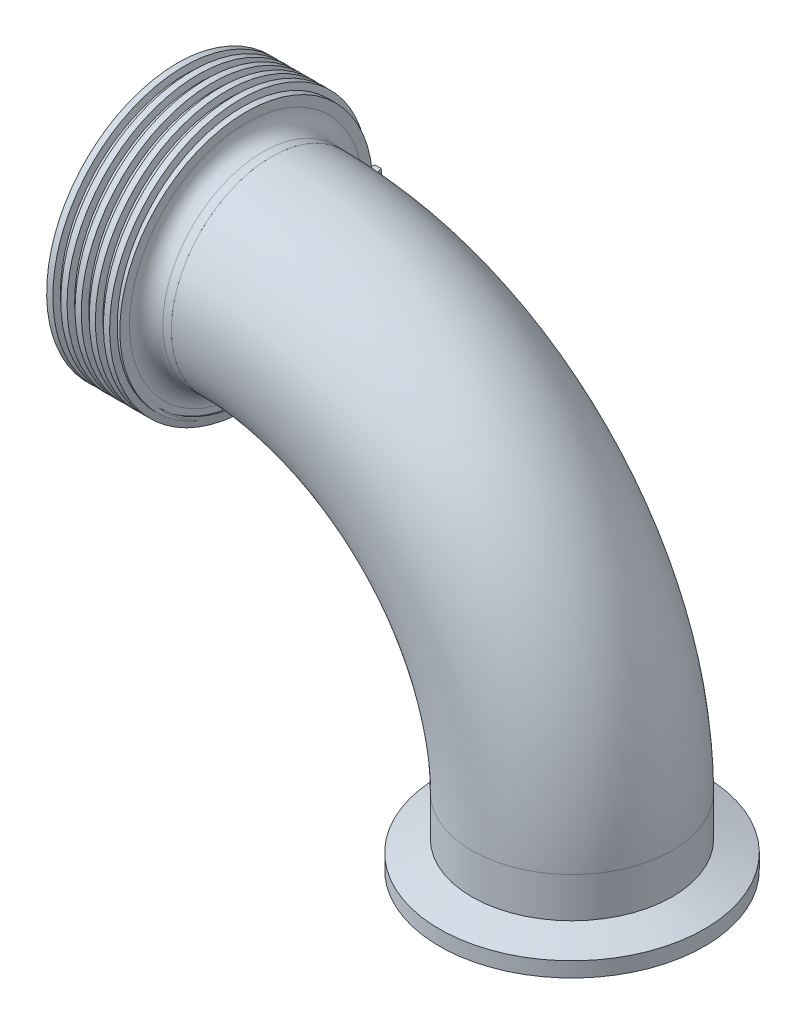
ISO-10303-21;
HEADER;
FILE_DESCRIPTION(('STEP AP214'),'2;1');
FILE_NAME('part.step','',(''),(''),'','','');
FILE_SCHEMA(('AUTOMOTIVE_DESIGN { 1 0 10303 214 1 1 1 1 }'));
ENDSEC;
DATA;
#1=APPLICATION_CONTEXT('core data for automotive mechanical design processes');
#2=APPLICATION_PROTOCOL_DEFINITION('international standard','automotive_design',2000,#1);
#3=PRODUCT_CONTEXT('',#1,'mechanical');
#4=PRODUCT('Part','Part','',(#3));
#5=PRODUCT_RELATED_PRODUCT_CATEGORY('part','',(#4));
#6=PRODUCT_DEFINITION_FORMATION('','',#4);
#7=PRODUCT_DEFINITION_CONTEXT('part definition',#1,'design');
#8=PRODUCT_DEFINITION('design','',#6,#7);
#9=PRODUCT_DEFINITION_SHAPE('','',#8);
#10=(LENGTH_UNIT() NAMED_UNIT(*) SI_UNIT(.MILLI.,.METRE.));
#11=(NAMED_UNIT(*) PLANE_ANGLE_UNIT() SI_UNIT($,.RADIAN.));
#12=(NAMED_UNIT(*) SI_UNIT($,.STERADIAN.) SOLID_ANGLE_UNIT());
#13=UNCERTAINTY_MEASURE_WITH_UNIT(LENGTH_MEASURE(1.E-05),#10,'distance_accuracy_value','');
#14=(GEOMETRIC_REPRESENTATION_CONTEXT(3) GLOBAL_UNCERTAINTY_ASSIGNED_CONTEXT((#13)) GLOBAL_UNIT_ASSIGNED_CONTEXT((#10,
#11,#12)) REPRESENTATION_CONTEXT('',''));
#15=CARTESIAN_POINT('',(0.,0.,0.));
#16=DIRECTION('',(0.,0.,1.));
#17=DIRECTION('',(1.,0.,0.));
#18=AXIS2_PLACEMENT_3D('',#15,#16,#17);
#19=CARTESIAN_POINT('',(68.2895632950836,13.3340045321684,77.6184007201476));
#20=DIRECTION('',(0.,1.00000000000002,0.));
#21=DIRECTION('',(0.,0.,1.00000000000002));
#22=AXIS2_PLACEMENT_3D('',#19,#20,#21);
#23=CONICAL_SURFACE('',#22,20.9336326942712,0.401425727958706);
#24=CARTESIAN_POINT('',(68.2895632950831,12.8142684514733,77.6184007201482));
#25=DIRECTION('',(0.,-1.00000000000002,0.));
#26=DIRECTION('',(0.,0.,-1.00000000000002));
#27=AXIS2_PLACEMENT_3D('',#24,#25,#26);
#28=CIRCLE('',#27,20.7130178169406);
#29=CARTESIAN_POINT('',(68.2895632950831,12.8142684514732,56.9053829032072));
#30=VERTEX_POINT('',#29);
#31=EDGE_CURVE('P0_E9',#30,#30,#28,.T.);
#32=ORIENTED_EDGE('',*,*,#31,.F.);
#33=EDGE_LOOP('',(#32));
#34=FACE_BOUND('',#33,.T.);
#35=CARTESIAN_POINT('',(68.2895632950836,13.3340045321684,77.6184007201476));
#36=DIRECTION('',(0.,-1.00000000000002,0.));
#37=DIRECTION('',(0.,0.,-1.00000000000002));
#38=AXIS2_PLACEMENT_3D('',#35,#36,#37);
#39=CIRCLE('',#38,20.9336326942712);
#40=CARTESIAN_POINT('',(68.2895632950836,13.3340045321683,56.6847680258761));
#41=VERTEX_POINT('',#40);
#42=EDGE_CURVE('P0_E54',#41,#41,#39,.T.);
#43=ORIENTED_EDGE('',*,*,#42,.T.);
#44=EDGE_LOOP('',(#43));
#45=FACE_BOUND('',#44,.T.);
#46=ADVANCED_FACE('P0_F14',(#34,#45),#23,.T.);
#47=CARTESIAN_POINT('',(68.2895632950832,13.1120055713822,77.6184007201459));
#48=DIRECTION('',(0.,-1.00000000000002,0.));
#49=DIRECTION('',(0.,0.,-1.00000000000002));
#50=AXIS2_PLACEMENT_3D('',#47,#48,#49);
#51=TOROIDAL_SURFACE('',#50,20.0115931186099,0.761999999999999);
#52=CARTESIAN_POINT('',(68.2895632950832,12.3500055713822,77.6184007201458));
#53=DIRECTION('',(0.,-1.00000000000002,0.));
#54=DIRECTION('',(0.,0.,-1.00000000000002));
#55=AXIS2_PLACEMENT_3D('',#52,#53,#54);
#56=CIRCLE('',#55,20.0115931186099);
#57=CARTESIAN_POINT('',(68.2895632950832,12.3500055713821,57.6068076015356));
#58=VERTEX_POINT('',#57);
#59=EDGE_CURVE('P0_E20',#58,#58,#56,.T.);
#60=ORIENTED_EDGE('',*,*,#59,.F.);
#61=EDGE_LOOP('',(#60));
#62=FACE_BOUND('',#61,.T.);
#63=ORIENTED_EDGE('',*,*,#31,.T.);
#64=EDGE_LOOP('',(#63));
#65=FACE_BOUND('',#64,.T.);
#66=ADVANCED_FACE('P0_F84',(#62,#65),#51,.T.);
#67=CARTESIAN_POINT('',(68.2895632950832,12.3500055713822,77.6184007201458));
#68=DIRECTION('',(0.,1.00000000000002,0.));
#69=DIRECTION('',(0.,0.,1.00000000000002));
#70=AXIS2_PLACEMENT_3D('',#67,#68,#69);
#71=PLANE('',#70);
#72=CARTESIAN_POINT('',(68.2895632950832,12.3500055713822,77.6184007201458));
#73=DIRECTION('',(0.,-1.00000000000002,0.));
#74=DIRECTION('',(0.,0.,-1.00000000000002));
#75=AXIS2_PLACEMENT_3D('',#72,#73,#74);
#76=CIRCLE('',#75,17.399);
#77=CARTESIAN_POINT('',(68.2895632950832,12.3500055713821,60.2194007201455));
#78=VERTEX_POINT('',#77);
#79=EDGE_CURVE('P0_E24',#78,#78,#76,.T.);
#80=ORIENTED_EDGE('',*,*,#79,.F.);
#81=EDGE_LOOP('',(#80));
#82=FACE_BOUND('',#81,.T.);
#83=ORIENTED_EDGE('',*,*,#59,.T.);
#84=EDGE_LOOP('',(#83));
#85=FACE_BOUND('',#84,.T.);
#86=ADVANCED_FACE('P0_F89',(#82,#85),#71,.F.);
#87=CARTESIAN_POINT('',(68.2895632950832,12.3500055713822,77.6184007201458));
#88=DIRECTION('',(0.,-1.00000000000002,0.));
#89=DIRECTION('',(0.,0.,-1.00000000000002));
#90=AXIS2_PLACEMENT_3D('',#87,#88,#89);
#91=CYLINDRICAL_SURFACE('',#90,17.399);
#92=ORIENTED_EDGE('',*,*,#79,.T.);
#93=EDGE_LOOP('',(#92));
#94=FACE_BOUND('',#93,.T.);
#95=CARTESIAN_POINT('',(68.2895632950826,25.0500055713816,77.6184007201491));
#96=DIRECTION('',(0.,-1.00000000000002,0.));
#97=DIRECTION('',(0.,0.,-1.00000000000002));
#98=AXIS2_PLACEMENT_3D('',#95,#96,#97);
#99=CIRCLE('',#98,17.399);
#100=CARTESIAN_POINT('',(68.2895632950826,25.0500055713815,60.2194007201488));
#101=VERTEX_POINT('',#100);
#102=EDGE_CURVE('P0_E28',#101,#101,#99,.T.);
#103=ORIENTED_EDGE('',*,*,#102,.F.);
#104=EDGE_LOOP('',(#103));
#105=FACE_BOUND('',#104,.T.);
#106=ADVANCED_FACE('P0_F94',(#94,#105),#91,.F.);
#107=CARTESIAN_POINT('',(68.2895632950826,25.0500055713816,77.6184007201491));
#108=DIRECTION('',(0.,-1.00000000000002,0.));
#109=DIRECTION('',(0.,0.,-1.00000000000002));
#110=AXIS2_PLACEMENT_3D('',#107,#108,#109);
#111=PLANE('',#110);
#112=CARTESIAN_POINT('',(68.2895632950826,25.0500055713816,77.6184007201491));
#113=DIRECTION('',(0.,-1.00000000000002,0.));
#114=DIRECTION('',(0.,0.,-1.00000000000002));
#115=AXIS2_PLACEMENT_3D('',#112,#113,#114);
#116=CIRCLE('',#115,19.05);
#117=CARTESIAN_POINT('',(68.2895632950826,25.0500055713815,58.5684007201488));
#118=VERTEX_POINT('',#117);
#119=EDGE_CURVE('P0_E33',#118,#118,#116,.T.);
#120=ORIENTED_EDGE('',*,*,#119,.F.);
#121=EDGE_LOOP('',(#120));
#122=FACE_BOUND('',#121,.T.);
#123=ORIENTED_EDGE('',*,*,#102,.T.);
#124=EDGE_LOOP('',(#123));
#125=FACE_BOUND('',#124,.T.);
#126=ADVANCED_FACE('P0_F100',(#122,#125),#111,.F.);
#127=CARTESIAN_POINT('',(68.2895632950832,12.3500055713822,77.6184007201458));
#128=DIRECTION('',(0.,-1.00000000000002,0.));
#129=DIRECTION('',(0.,0.,-1.00000000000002));
#130=AXIS2_PLACEMENT_3D('',#127,#128,#129);
#131=CYLINDRICAL_SURFACE('',#130,19.05);
#132=CARTESIAN_POINT('',(68.2895632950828,17.4320578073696,77.6184007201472));
#133=DIRECTION('',(0.,-1.00000000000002,0.));
#134=DIRECTION('',(0.,0.,-1.00000000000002));
#135=AXIS2_PLACEMENT_3D('',#132,#133,#134);
#136=CIRCLE('',#135,19.05);
#137=CARTESIAN_POINT('',(68.2895632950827,17.4320578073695,58.568400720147));
#138=VERTEX_POINT('',#137);
#139=EDGE_CURVE('P0_E36',#138,#138,#136,.T.);
#140=ORIENTED_EDGE('',*,*,#139,.F.);
#141=EDGE_LOOP('',(#140));
#142=FACE_BOUND('',#141,.T.);
#143=ORIENTED_EDGE('',*,*,#119,.T.);
#144=EDGE_LOOP('',(#143));
#145=FACE_BOUND('',#144,.T.);
#146=ADVANCED_FACE('P0_F104',(#142,#145),#131,.T.);
#147=CARTESIAN_POINT('',(68.2895632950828,17.4320578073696,77.6184007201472));
#148=DIRECTION('',(0.,-1.00000000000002,0.));
#149=DIRECTION('',(0.,0.,-1.00000000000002));
#150=AXIS2_PLACEMENT_3D('',#147,#148,#149);
#151=CONICAL_SURFACE('',#150,19.05,1.22173047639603);
#152=CARTESIAN_POINT('',(68.2895632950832,15.1948055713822,77.6184007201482));
#153=DIRECTION('',(0.,-1.00000000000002,0.));
#154=DIRECTION('',(0.,0.,-1.00000000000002));
#155=AXIS2_PLACEMENT_3D('',#152,#153,#154);
#156=CIRCLE('',#155,25.1968);
#157=CARTESIAN_POINT('',(68.2895632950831,15.194805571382,52.4216007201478));
#158=VERTEX_POINT('',#157);
#159=EDGE_CURVE('P0_E39',#158,#158,#156,.T.);
#160=ORIENTED_EDGE('',*,*,#159,.F.);
#161=EDGE_LOOP('',(#160));
#162=FACE_BOUND('',#161,.T.);
#163=ORIENTED_EDGE('',*,*,#139,.T.);
#164=EDGE_LOOP('',(#163));
#165=FACE_BOUND('',#164,.T.);
#166=ADVANCED_FACE('P0_F108',(#162,#165),#151,.T.);
#167=CARTESIAN_POINT('',(68.2895632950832,12.3500055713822,77.6184007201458));
#168=DIRECTION('',(0.,-1.00000000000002,0.));
#169=DIRECTION('',(0.,0.,-1.00000000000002));
#170=AXIS2_PLACEMENT_3D('',#167,#168,#169);
#171=CYLINDRICAL_SURFACE('',#170,25.1968);
#172=CARTESIAN_POINT('',(68.2895632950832,12.3500055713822,77.6184007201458));
#173=DIRECTION('',(0.,-1.00000000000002,0.));
#174=DIRECTION('',(0.,0.,-1.00000000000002));
#175=AXIS2_PLACEMENT_3D('',#172,#173,#174);
#176=CIRCLE('',#175,25.1968);
#177=CARTESIAN_POINT('',(68.2895632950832,12.3500055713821,52.4216007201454));
#178=VERTEX_POINT('',#177);
#179=EDGE_CURVE('P0_E42',#178,#178,#176,.T.);
#180=ORIENTED_EDGE('',*,*,#179,.F.);
#181=EDGE_LOOP('',(#180));
#182=FACE_BOUND('',#181,.T.);
#183=ORIENTED_EDGE('',*,*,#159,.T.);
#184=EDGE_LOOP('',(#183));
#185=FACE_BOUND('',#184,.T.);
#186=ADVANCED_FACE('P0_F80',(#182,#185),#171,.T.);
#187=CARTESIAN_POINT('',(68.2895632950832,12.3500055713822,77.6184007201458));
#188=DIRECTION('',(0.,1.00000000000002,0.));
#189=DIRECTION('',(0.,0.,1.00000000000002));
#190=AXIS2_PLACEMENT_3D('',#187,#188,#189);
#191=PLANE('',#190);
#192=CARTESIAN_POINT('',(68.2895632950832,12.3500055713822,77.6184007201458));
#193=DIRECTION('',(0.,-1.00000000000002,0.));
#194=DIRECTION('',(0.,0.,-1.00000000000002));
#195=AXIS2_PLACEMENT_3D('',#192,#193,#194);
#196=CIRCLE('',#195,23.9521599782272);
#197=CARTESIAN_POINT('',(68.2895632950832,12.3500055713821,53.6662407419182));
#198=VERTEX_POINT('',#197);
#199=EDGE_CURVE('P0_E45',#198,#198,#196,.T.);
#200=ORIENTED_EDGE('',*,*,#199,.F.);
#201=EDGE_LOOP('',(#200));
#202=FACE_BOUND('',#201,.T.);
#203=ORIENTED_EDGE('',*,*,#179,.T.);
#204=EDGE_LOOP('',(#203));
#205=FACE_BOUND('',#204,.T.);
#206=ADVANCED_FACE('P0_F73',(#202,#205),#191,.F.);
#207=CARTESIAN_POINT('',(68.2895632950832,13.1120055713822,77.6184007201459));
#208=DIRECTION('',(0.,-1.00000000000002,0.));
#209=DIRECTION('',(0.,0.,-1.00000000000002));
#210=AXIS2_PLACEMENT_3D('',#207,#208,#209);
#211=TOROIDAL_SURFACE('',#210,23.9521599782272,0.761999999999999);
#212=ORIENTED_EDGE('',*,*,#199,.T.);
#213=EDGE_LOOP('',(#212));
#214=FACE_BOUND('',#213,.T.);
#215=CARTESIAN_POINT('',(68.2895632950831,12.8142684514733,77.6184007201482));
#216=DIRECTION('',(0.,-1.00000000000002,0.));
#217=DIRECTION('',(0.,0.,-1.00000000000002));
#218=AXIS2_PLACEMENT_3D('',#215,#216,#217);
#219=CIRCLE('',#218,23.2507352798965);
#220=CARTESIAN_POINT('',(68.2895632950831,12.8142684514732,54.3676654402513));
#221=VERTEX_POINT('',#220);
#222=EDGE_CURVE('P0_E48',#221,#221,#219,.T.);
#223=ORIENTED_EDGE('',*,*,#222,.F.);
#224=EDGE_LOOP('',(#223));
#225=FACE_BOUND('',#224,.T.);
#226=ADVANCED_FACE('P0_F68',(#214,#225),#211,.T.);
#227=CARTESIAN_POINT('',(68.2895632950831,12.8142684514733,77.6184007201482));
#228=DIRECTION('',(0.,-1.00000000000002,0.));
#229=DIRECTION('',(0.,0.,-1.00000000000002));
#230=AXIS2_PLACEMENT_3D('',#227,#228,#229);
#231=CONICAL_SURFACE('',#230,23.2507352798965,0.401425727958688);
#232=CARTESIAN_POINT('',(68.2895632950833,13.2228603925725,77.6184007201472));
#233=DIRECTION('',(0.,-1.00000000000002,0.));
#234=DIRECTION('',(0.,0.,-1.00000000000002));
#235=AXIS2_PLACEMENT_3D('',#232,#233,#234);
#236=CIRCLE('',#235,23.0772982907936);
#237=CARTESIAN_POINT('',(68.2895632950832,13.2228603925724,54.5411024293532));
#238=VERTEX_POINT('',#237);
#239=EDGE_CURVE('P0_E51',#238,#238,#236,.T.);
#240=ORIENTED_EDGE('',*,*,#239,.F.);
#241=EDGE_LOOP('',(#240));
#242=FACE_BOUND('',#241,.T.);
#243=ORIENTED_EDGE('',*,*,#222,.T.);
#244=EDGE_LOOP('',(#243));
#245=FACE_BOUND('',#244,.T.);
#246=ADVANCED_FACE('P0_F62',(#242,#245),#231,.F.);
#247=CARTESIAN_POINT('',(68.2895632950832,12.7564055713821,77.6184007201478));
#248=DIRECTION('',(0.,-1.00000000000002,0.));
#249=DIRECTION('',(0.,0.,-1.00000000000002));
#250=AXIS2_PLACEMENT_3D('',#247,#248,#249);
#251=TOROIDAL_SURFACE('',#250,21.9783995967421,1.1938);
#252=ORIENTED_EDGE('',*,*,#42,.F.);
#253=EDGE_LOOP('',(#252));
#254=FACE_BOUND('',#253,.T.);
#255=ORIENTED_EDGE('',*,*,#239,.T.);
#256=EDGE_LOOP('',(#255));
#257=FACE_BOUND('',#256,.T.);
#258=ADVANCED_FACE('P0_F59',(#254,#257),#251,.F.);
#259=CLOSED_SHELL('',(#46,#66,#86,#106,#126,#146,#166,#186,#206,#226,#246,#258));
#260=MANIFOLD_SOLID_BREP('P0_B1',#259);
#261=CARTESIAN_POINT('',(6.3389632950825,84.3817949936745,55.5007512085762));
#262=DIRECTION('',(1.,0.,0.));
#263=DIRECTION('',(0.,-0.0981682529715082,0.995169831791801));
#264=AXIS2_PLACEMENT_3D('',#261,#262,#263);
#265=PLANE('',#264);
#266=DIRECTION('',(0.,-0.0981697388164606,0.995169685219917));
#267=VECTOR('',#266,1.);
#268=CARTESIAN_POINT('',(6.3389632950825,84.3818280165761,55.500754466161));
#269=LINE('',#268,#267);
#270=CARTESIAN_POINT('',(6.33896329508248,84.5613608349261,53.6807881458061));
#271=VERTEX_POINT('',#270);
#272=CARTESIAN_POINT('',(6.3389632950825,84.4927655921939,54.3761542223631));
#273=VERTEX_POINT('',#272);
#274=EDGE_CURVE('P1_E181',#271,#273,#269,.T.);
#275=ORIENTED_EDGE('',*,*,#274,.F.);
#276=CARTESIAN_POINT('',(6.33896329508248,82.2000055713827,77.618400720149));
#277=DIRECTION('',(-1.,0.,0.));
#278=DIRECTION('',(0.,0.0981682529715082,-0.995169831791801));
#279=AXIS2_PLACEMENT_3D('',#276,#277,#278);
#280=CIRCLE('',#279,24.0538);
#281=CARTESIAN_POINT('',(6.33896329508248,59.9594287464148,86.7803894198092));
#282=VERTEX_POINT('',#281);
#283=EDGE_CURVE('P1_E180',#282,#271,#280,.T.);
#284=ORIENTED_EDGE('',*,*,#283,.F.);
#285=CARTESIAN_POINT('',(6.33896329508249,57.6178293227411,78.8509234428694));
#286=CARTESIAN_POINT('',(6.33896329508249,57.6570736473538,79.1825393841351));
#287=CARTESIAN_POINT('',(6.33896329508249,57.7030213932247,79.5133566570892));
#288=CARTESIAN_POINT('',(6.33896329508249,57.8082321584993,80.1728735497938));
#289=CARTESIAN_POINT('',(6.33896329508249,57.8674954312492,80.5015731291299));
#290=CARTESIAN_POINT('',(6.33896329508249,57.9991832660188,81.1560189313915));
#291=CARTESIAN_POINT('',(6.33896329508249,58.0715956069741,81.4817676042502));
#292=CARTESIAN_POINT('',(6.3389632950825,58.1900225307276,81.9679814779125));
#293=CARTESIAN_POINT('',(6.3389632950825,58.2311342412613,82.1296558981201));
#294=CARTESIAN_POINT('',(6.33896329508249,58.3165989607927,82.4521481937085));
#295=CARTESIAN_POINT('',(6.33896329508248,58.3609519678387,82.6129660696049));
#296=CARTESIAN_POINT('',(6.33896329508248,58.4523593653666,82.9316572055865));
#297=CARTESIAN_POINT('',(6.33896329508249,58.4993730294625,83.0895421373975));
#298=CARTESIAN_POINT('',(6.3389632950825,58.5966929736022,83.4042910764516));
#299=CARTESIAN_POINT('',(6.3389632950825,58.6469992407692,83.5611550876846));
#300=CARTESIAN_POINT('',(6.33896329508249,58.8027789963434,84.0301104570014));
#301=CARTESIAN_POINT('',(6.33896329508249,58.9131231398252,84.3405989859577));
#302=CARTESIAN_POINT('',(6.33896329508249,59.1467486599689,84.9570468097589));
#303=CARTESIAN_POINT('',(6.33896329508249,59.2700438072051,85.2630008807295));
#304=CARTESIAN_POINT('',(6.33896329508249,59.5292681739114,85.8695513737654));
#305=CARTESIAN_POINT('',(6.33896329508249,59.6651996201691,86.1701468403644));
#306=CARTESIAN_POINT('',(6.3389632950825,60.0951563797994,87.0705055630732));
#307=CARTESIAN_POINT('',(6.33896329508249,60.4084552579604,87.6612087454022));
#308=CARTESIAN_POINT('',(6.33896329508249,61.0838204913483,88.8143263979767));
#309=CARTESIAN_POINT('',(6.33896329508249,61.4459102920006,89.3767270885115));
#310=CARTESIAN_POINT('',(6.33896329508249,62.21616388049,90.4689714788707));
#311=CARTESIAN_POINT('',(6.33896329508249,62.6243236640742,90.9988180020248));
#312=CARTESIAN_POINT('',(6.33896329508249,63.4836439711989,92.0219697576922));
#313=CARTESIAN_POINT('',(6.3389632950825,63.9347789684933,92.5152963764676));
#314=CARTESIAN_POINT('',(6.3389632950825,64.6723102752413,93.2565223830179));
#315=CARTESIAN_POINT('',(6.33896329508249,64.945201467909,93.5179938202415));
#316=CARTESIAN_POINT('',(6.33896329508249,65.502534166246,94.027082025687));
#317=CARTESIAN_POINT('',(6.33896329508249,65.7869494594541,94.2747274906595));
#318=CARTESIAN_POINT('',(6.3389632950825,66.0771313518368,94.5154921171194));
#319=B_SPLINE_CURVE_WITH_KNOTS('',3,(#285,#286,#287,#288,#289,#290,#291,#292,#293,#294,#295,
#296,#297,#298,#299,#300,#301,#302,#303,#304,#305,#306,#307,#308,#309,#310,#311,#312,#313,#314,
#315,#316,#317,#318),.UNSPECIFIED.,.F.,.F.,(4,2,2,2,2,2,2,2,2,2,2,2,2,2,2,2,4),(0.,
1.00171156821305,2.00344219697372,3.00424651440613,3.50467768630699,4.00510855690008,
4.49928024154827,4.99344999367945,5.98168398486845,6.97097959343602,7.96044986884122,
9.96379609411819,11.9681084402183,13.9722467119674,15.9752019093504,17.1086298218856,
18.2396103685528),.UNSPECIFIED.);
#320=CARTESIAN_POINT('',(6.3389632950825,66.0771313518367,94.5154921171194));
#321=VERTEX_POINT('',#320);
#322=EDGE_CURVE('P1_E175',#282,#321,#319,.T.);
#323=ORIENTED_EDGE('',*,*,#322,.T.);
#324=CARTESIAN_POINT('',(6.3389632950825,66.0771313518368,94.5154921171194));
#325=CARTESIAN_POINT('',(6.33896329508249,65.8192359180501,94.2694119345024));
#326=CARTESIAN_POINT('',(6.33896329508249,65.5670132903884,94.0174651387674));
#327=CARTESIAN_POINT('',(6.33896329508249,65.0743550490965,93.5022903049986));
#328=CARTESIAN_POINT('',(6.33896329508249,64.8339196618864,93.2390620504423));
#329=CARTESIAN_POINT('',(6.33896329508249,64.1302682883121,92.4323419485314));
#330=CARTESIAN_POINT('',(6.3389632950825,63.6854832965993,91.8725554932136));
#331=CARTESIAN_POINT('',(6.3389632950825,62.8830450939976,90.7616417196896));
#332=CARTESIAN_POINT('',(6.33896329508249,62.5212522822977,90.2134866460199));
#333=CARTESIAN_POINT('',(6.33896329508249,61.8449679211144,89.0884486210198));
#334=CARTESIAN_POINT('',(6.33896329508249,61.530491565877,88.5115565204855));
#335=CARTESIAN_POINT('',(6.33896329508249,60.951051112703,87.3329397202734));
#336=CARTESIAN_POINT('',(6.3389632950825,60.6861211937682,86.7311982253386));
#337=CARTESIAN_POINT('',(6.33896329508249,60.2079360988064,85.5075755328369));
#338=CARTESIAN_POINT('',(6.33896329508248,59.9946767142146,84.8856959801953));
#339=CARTESIAN_POINT('',(6.33896329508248,59.6213833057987,83.6263758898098));
#340=CARTESIAN_POINT('',(6.33896329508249,59.4613325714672,82.9889403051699));
#341=CARTESIAN_POINT('',(6.3389632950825,59.1954989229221,81.7028385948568));
#342=CARTESIAN_POINT('',(6.33896329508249,59.0897170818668,81.0541722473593));
#343=CARTESIAN_POINT('',(6.33896329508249,58.933188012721,79.7503143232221));
#344=CARTESIAN_POINT('',(6.33896329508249,58.8824339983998,79.0951235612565));
#345=CARTESIAN_POINT('',(6.33896329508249,58.8362981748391,77.7827984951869));
#346=CARTESIAN_POINT('',(6.33896329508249,58.8409161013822,77.1256642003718));
#347=CARTESIAN_POINT('',(6.33896329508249,58.9054928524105,75.814076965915));
#348=CARTESIAN_POINT('',(6.33896329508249,58.9654553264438,75.1596242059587));
#349=CARTESIAN_POINT('',(6.33896329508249,59.1403001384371,73.858095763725));
#350=CARTESIAN_POINT('',(6.33896329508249,59.2551825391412,73.2110200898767));
#351=CARTESIAN_POINT('',(6.33896329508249,59.539048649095,71.9288551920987));
#352=CARTESIAN_POINT('',(6.33896329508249,59.70803166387,71.2937658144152));
#353=CARTESIAN_POINT('',(6.33896329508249,60.0988980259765,70.0400801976));
#354=CARTESIAN_POINT('',(6.33896329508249,60.320781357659,69.4214839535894));
#355=CARTESIAN_POINT('',(6.33896329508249,60.8158669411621,68.2051920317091));
#356=CARTESIAN_POINT('',(6.33896329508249,61.0890683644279,67.6074960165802));
#357=CARTESIAN_POINT('',(6.33896329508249,61.6848503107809,66.4372430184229));
#358=CARTESIAN_POINT('',(6.33896329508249,62.0074308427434,65.8646860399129));
#359=CARTESIAN_POINT('',(6.33896329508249,62.6996933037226,64.7487564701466));
#360=CARTESIAN_POINT('',(6.33896329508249,63.069377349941,64.2053851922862));
#361=CARTESIAN_POINT('',(6.33896329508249,63.8532069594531,63.1517182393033));
#362=CARTESIAN_POINT('',(6.33896329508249,64.2673525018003,62.6414225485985));
#363=CARTESIAN_POINT('',(6.33896329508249,65.1371620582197,61.6575331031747));
#364=CARTESIAN_POINT('',(6.33896329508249,65.5928261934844,61.1839394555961));
#365=CARTESIAN_POINT('',(6.33896329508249,66.5424332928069,60.2768219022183));
#366=CARTESIAN_POINT('',(6.33896329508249,67.0363763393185,59.8432980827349));
#367=CARTESIAN_POINT('',(6.33896329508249,68.0590034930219,59.0194237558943));
#368=CARTESIAN_POINT('',(6.33896329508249,68.5876859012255,58.6290711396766));
#369=CARTESIAN_POINT('',(6.33896329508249,69.6760502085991,57.8942932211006));
#370=CARTESIAN_POINT('',(6.33896329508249,70.2357318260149,57.549867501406));
#371=CARTESIAN_POINT('',(6.33896329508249,71.3821788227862,56.9093545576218));
#372=CARTESIAN_POINT('',(6.33896329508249,71.9689470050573,56.6132723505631));
#373=CARTESIAN_POINT('',(6.33896329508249,73.1653661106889,56.0715848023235));
#374=CARTESIAN_POINT('',(6.33896329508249,73.7750178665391,55.8259812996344));
#375=CARTESIAN_POINT('',(6.3389632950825,75.0127559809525,55.3870410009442));
#376=CARTESIAN_POINT('',(6.3389632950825,75.6408399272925,55.1936973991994));
#377=CARTESIAN_POINT('',(6.33896329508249,76.91100889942,54.8606280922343));
#378=CARTESIAN_POINT('',(6.33896329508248,77.5530919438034,54.7208948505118));
#379=CARTESIAN_POINT('',(6.33896329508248,78.7187130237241,54.5182528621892));
#380=CARTESIAN_POINT('',(6.33896329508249,79.2405840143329,54.4456162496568));
#381=CARTESIAN_POINT('',(6.3389632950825,80.2879892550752,54.3357853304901));
#382=CARTESIAN_POINT('',(6.3389632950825,80.8135229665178,54.2985859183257));
#383=CARTESIAN_POINT('',(6.33896329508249,81.8654705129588,54.2598138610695));
#384=CARTESIAN_POINT('',(6.33896329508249,82.3918832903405,54.2582123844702));
#385=CARTESIAN_POINT('',(6.3389632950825,83.4437010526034,54.290536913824));
#386=CARTESIAN_POINT('',(6.3389632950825,83.9691058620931,54.3244686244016));
#387=CARTESIAN_POINT('',(6.3389632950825,84.4927655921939,54.3761542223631));
#388=B_SPLINE_CURVE_WITH_KNOTS('',3,(#324,#325,#326,#327,#328,#329,#330,#331,#332,#333,#334,
#335,#336,#337,#338,#339,#340,#341,#342,#343,#344,#345,#346,#347,#348,#349,#350,#351,#352,#353,
#354,#355,#356,#357,#358,#359,#360,#361,#362,#363,#364,#365,#366,#367,#368,#369,#370,#371,#372,
#373,#374,#375,#376,#377,#378,#379,#380,#381,#382,#383,#384,#385,#386,#387),.UNSPECIFIED.,.F.,
.F.,(4,2,2,2,2,2,2,2,2,2,2,2,2,2,2,2,2,2,2,2,2,2,2,2,2,2,2,2,2,2,2,4),(0.,1.06918573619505,
2.13839200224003,4.2800112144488,6.24813640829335,8.21689226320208,10.1870012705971,
12.1569497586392,14.1262789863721,16.0956471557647,18.0647724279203,20.0338883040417,
22.003134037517,23.9723820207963,25.9416047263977,27.9108268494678,29.8800171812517,
31.8492078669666,33.818487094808,35.7877653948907,37.7570494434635,39.7263377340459,
41.6955297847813,43.6647039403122,45.6340823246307,47.6035324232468,49.5727259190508,
51.5416424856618,53.1211967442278,54.7005233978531,56.2785708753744,57.8568717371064),.UNSPECIFIED.);
#389=EDGE_CURVE('P1_E102',#321,#273,#388,.T.);
#390=ORIENTED_EDGE('',*,*,#389,.T.);
#391=EDGE_LOOP('',(#275,#284,#323,#390));
#392=FACE_BOUND('',#391,.T.);
#393=CARTESIAN_POINT('',(6.3389632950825,82.2000055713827,77.618400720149));
#394=DIRECTION('',(-1.,0.,0.));
#395=DIRECTION('',(0.,0.0981682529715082,-0.995169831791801));
#396=AXIS2_PLACEMENT_3D('',#393,#394,#395);
#397=CIRCLE('',#396,22.225);
#398=CARTESIAN_POINT('',(6.3389632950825,84.3817949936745,55.5007512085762));
#399=VERTEX_POINT('',#398);
#400=EDGE_CURVE('P1_E186',#399,#399,#397,.T.);
#401=ORIENTED_EDGE('',*,*,#400,.T.);
#402=EDGE_LOOP('',(#401));
#403=FACE_BOUND('',#402,.T.);
#404=ADVANCED_FACE('P1_F17',(#392,#403),#265,.T.);
#405=CARTESIAN_POINT('',(11.1395632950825,82.2000055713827,77.618400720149));
#406=DIRECTION('',(1.,0.,0.));
#407=DIRECTION('',(0.,-0.0981682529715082,0.995169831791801));
#408=AXIS2_PLACEMENT_3D('',#405,#406,#407);
#409=PLANE('',#408);
#410=CARTESIAN_POINT('',(11.1395632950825,82.2000055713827,77.618400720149));
#411=DIRECTION('',(1.,0.,0.));
#412=DIRECTION('',(0.,-0.0981682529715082,0.995169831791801));
#413=AXIS2_PLACEMENT_3D('',#410,#411,#412);
#414=CIRCLE('',#413,17.399);
#415=CARTESIAN_POINT('',(11.1395632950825,80.4919761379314,94.9333606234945));
#416=VERTEX_POINT('',#415);
#417=EDGE_CURVE('P1_E159',#416,#416,#414,.T.);
#418=ORIENTED_EDGE('',*,*,#417,.F.);
#419=EDGE_LOOP('',(#418));
#420=FACE_BOUND('',#419,.T.);
#421=CARTESIAN_POINT('',(11.1395632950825,82.2000055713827,77.618400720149));
#422=DIRECTION('',(-1.,0.,0.));
#423=DIRECTION('',(0.,0.0981682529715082,-0.995169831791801));
#424=AXIS2_PLACEMENT_3D('',#421,#422,#423);
#425=CIRCLE('',#424,19.05);
#426=CARTESIAN_POINT('',(11.1395632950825,84.0701107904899,58.6604154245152));
#427=VERTEX_POINT('',#426);
#428=EDGE_CURVE('P1_E192',#427,#427,#425,.T.);
#429=ORIENTED_EDGE('',*,*,#428,.F.);
#430=EDGE_LOOP('',(#429));
#431=FACE_BOUND('',#430,.T.);
#432=ADVANCED_FACE('P1_F255',(#420,#431),#409,.T.);
#433=CARTESIAN_POINT('',(-7.14843670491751,82.2000055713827,77.618400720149));
#434=DIRECTION('',(-1.,0.,0.));
#435=DIRECTION('',(0.,0.0981682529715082,-0.995169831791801));
#436=AXIS2_PLACEMENT_3D('',#433,#434,#435);
#437=CYLINDRICAL_SURFACE('',#436,19.05);
#438=ORIENTED_EDGE('',*,*,#428,.T.);
#439=EDGE_LOOP('',(#438));
#440=FACE_BOUND('',#439,.T.);
#441=CARTESIAN_POINT('',(9.51396329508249,82.2000055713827,77.618400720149));
#442=DIRECTION('',(-1.,0.,0.));
#443=DIRECTION('',(0.,0.0981682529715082,-0.995169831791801));
#444=AXIS2_PLACEMENT_3D('',#441,#442,#443);
#445=CIRCLE('',#444,19.05);
#446=CARTESIAN_POINT('',(9.51396329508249,84.0701107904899,58.6604154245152));
#447=VERTEX_POINT('',#446);
#448=EDGE_CURVE('P1_E189',#447,#447,#445,.T.);
#449=ORIENTED_EDGE('',*,*,#448,.F.);
#450=EDGE_LOOP('',(#449));
#451=FACE_BOUND('',#450,.T.);
#452=ADVANCED_FACE('P1_F259',(#440,#451),#437,.T.);
#453=CARTESIAN_POINT('',(9.51396329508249,82.2000055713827,77.618400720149));
#454=DIRECTION('',(-1.,0.,0.));
#455=DIRECTION('',(0.,0.0981682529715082,-0.995169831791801));
#456=AXIS2_PLACEMENT_3D('',#453,#454,#455);
#457=TOROIDAL_SURFACE('',#456,22.225,3.175);
#458=ORIENTED_EDGE('',*,*,#448,.T.);
#459=EDGE_LOOP('',(#458));
#460=FACE_BOUND('',#459,.T.);
#461=ORIENTED_EDGE('',*,*,#400,.F.);
#462=EDGE_LOOP('',(#461));
#463=FACE_BOUND('',#462,.T.);
#464=ADVANCED_FACE('P1_F264',(#460,#463),#457,.F.);
#465=CARTESIAN_POINT('',(6.33896329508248,82.2000055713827,77.618400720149));
#466=DIRECTION('',(-1.,0.,0.));
#467=DIRECTION('',(0.,0.0981682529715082,-0.995169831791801));
#468=AXIS2_PLACEMENT_3D('',#465,#466,#467);
#469=CYLINDRICAL_SURFACE('',#468,24.0538);
#470=DIRECTION('',(-1.,0.,0.));
#471=VECTOR('',#470,1.);
#472=CARTESIAN_POINT('',(6.33896329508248,84.5613608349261,53.6807881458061));
#473=LINE('',#472,#471);
#474=CARTESIAN_POINT('',(5.45541577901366,84.5613608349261,53.6807881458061));
#475=VERTEX_POINT('',#474);
#476=EDGE_CURVE('P1_E40',#475,#271,#473,.F.);
#477=ORIENTED_EDGE('',*,*,#476,.F.);
#478=CARTESIAN_POINT('',(-8.03198422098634,84.5613608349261,53.6807881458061));
#479=CARTESIAN_POINT('',(-7.89711022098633,92.3391626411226,54.4480389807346));
#480=CARTESIAN_POINT('',(-7.76223622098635,98.1805577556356,59.6404351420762));
#481=CARTESIAN_POINT('',(-7.62736222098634,104.021952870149,64.8328313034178));
#482=CARTESIAN_POINT('',(-7.49248822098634,105.695726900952,72.4670539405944));
#483=CARTESIAN_POINT('',(-7.35761422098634,107.369500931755,80.101276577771));
#484=CARTESIAN_POINT('',(-7.22274022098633,104.236329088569,87.2613121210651));
#485=CARTESIAN_POINT('',(-7.08786622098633,101.103157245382,94.4213476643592));
#486=CARTESIAN_POINT('',(-6.95299222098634,94.359804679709,98.3723058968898));
#487=CARTESIAN_POINT('',(-6.81811822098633,87.6164521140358,102.32326412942));
#488=CARTESIAN_POINT('',(-6.68324422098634,79.8386503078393,101.556013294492));
#489=CARTESIAN_POINT('',(-6.54837022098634,72.0608485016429,100.788762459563));
#490=CARTESIAN_POINT('',(-6.41349622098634,66.2194533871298,95.5963662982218));
#491=CARTESIAN_POINT('',(-6.27862222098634,60.3780582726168,90.4039701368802));
#492=CARTESIAN_POINT('',(-6.14374822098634,58.7042842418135,82.7697474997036));
#493=CARTESIAN_POINT('',(-6.00887422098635,57.0305102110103,75.1355248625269));
#494=CARTESIAN_POINT('',(-5.87400022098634,60.1636820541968,67.9754893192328));
#495=CARTESIAN_POINT('',(-5.73912622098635,63.2968538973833,60.8154537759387));
#496=CARTESIAN_POINT('',(-5.60425222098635,70.0402064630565,56.8644955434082));
#497=CARTESIAN_POINT('',(-5.46937822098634,76.7835590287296,52.9135373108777));
#498=CARTESIAN_POINT('',(-5.33450422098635,84.5613608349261,53.6807881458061));
#499=CARTESIAN_POINT('',(-5.19963022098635,92.3391626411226,54.4480389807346));
#500=CARTESIAN_POINT('',(-5.06475622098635,98.1805577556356,59.6404351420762));
#501=CARTESIAN_POINT('',(-4.92988222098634,104.021952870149,64.8328313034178));
#502=CARTESIAN_POINT('',(-4.79500822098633,105.695726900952,72.4670539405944));
#503=CARTESIAN_POINT('',(-4.66013422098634,107.369500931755,80.101276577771));
#504=CARTESIAN_POINT('',(-4.52526022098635,104.236329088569,87.2613121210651));
#505=CARTESIAN_POINT('',(-4.39038622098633,101.103157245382,94.4213476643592));
#506=CARTESIAN_POINT('',(-4.25551222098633,94.359804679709,98.3723058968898));
#507=CARTESIAN_POINT('',(-4.12063822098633,87.6164521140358,102.32326412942));
#508=CARTESIAN_POINT('',(-3.98576422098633,79.8386503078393,101.556013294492));
#509=CARTESIAN_POINT('',(-3.85089022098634,72.0608485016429,100.788762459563));
#510=CARTESIAN_POINT('',(-3.71601622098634,66.2194533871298,95.5963662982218));
#511=CARTESIAN_POINT('',(-3.58114222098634,60.3780582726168,90.4039701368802));
#512=CARTESIAN_POINT('',(-3.44626822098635,58.7042842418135,82.7697474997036));
#513=CARTESIAN_POINT('',(-3.31139422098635,57.0305102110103,75.1355248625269));
#514=CARTESIAN_POINT('',(-3.17652022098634,60.1636820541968,67.9754893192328));
#515=CARTESIAN_POINT('',(-3.04164622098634,63.2968538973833,60.8154537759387));
#516=CARTESIAN_POINT('',(-2.90677222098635,70.0402064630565,56.8644955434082));
#517=CARTESIAN_POINT('',(-2.77189822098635,76.7835590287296,52.9135373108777));
#518=CARTESIAN_POINT('',(-2.63702422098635,84.5613608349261,53.6807881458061));
#519=CARTESIAN_POINT('',(-2.50215022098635,92.3391626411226,54.4480389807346));
#520=CARTESIAN_POINT('',(-2.36727622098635,98.1805577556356,59.6404351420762));
#521=CARTESIAN_POINT('',(-2.23240222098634,104.021952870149,64.8328313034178));
#522=CARTESIAN_POINT('',(-2.09752822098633,105.695726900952,72.4670539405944));
#523=CARTESIAN_POINT('',(-1.96265422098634,107.369500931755,80.101276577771));
#524=CARTESIAN_POINT('',(-1.82778022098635,104.236329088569,87.2613121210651));
#525=CARTESIAN_POINT('',(-1.69290622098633,101.103157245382,94.4213476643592));
#526=CARTESIAN_POINT('',(-1.55803222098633,94.359804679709,98.3723058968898));
#527=CARTESIAN_POINT('',(-1.42315822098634,87.6164521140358,102.32326412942));
#528=CARTESIAN_POINT('',(-1.28828422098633,79.8386503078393,101.556013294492));
#529=CARTESIAN_POINT('',(-1.15341022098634,72.0608485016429,100.788762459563));
#530=CARTESIAN_POINT('',(-1.01853622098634,66.2194533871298,95.5963662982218));
#531=CARTESIAN_POINT('',(-0.883662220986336,60.3780582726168,90.4039701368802));
#532=CARTESIAN_POINT('',(-0.748788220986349,58.7042842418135,82.7697474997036));
#533=CARTESIAN_POINT('',(-0.613914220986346,57.0305102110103,75.1355248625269));
#534=CARTESIAN_POINT('',(-0.479040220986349,60.1636820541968,67.9754893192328));
#535=CARTESIAN_POINT('',(-0.344166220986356,63.2968538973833,60.8154537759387));
#536=CARTESIAN_POINT('',(-0.209292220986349,70.0402064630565,56.8644955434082));
#537=CARTESIAN_POINT('',(-0.0744182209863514,76.7835590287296,52.9135373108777));
#538=CARTESIAN_POINT('',(0.0604557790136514,84.5613608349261,53.6807881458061));
#539=CARTESIAN_POINT('',(0.195329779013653,92.3391626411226,54.4480389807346));
#540=CARTESIAN_POINT('',(0.330203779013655,98.1805577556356,59.6404351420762));
#541=CARTESIAN_POINT('',(0.465077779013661,104.021952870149,64.8328313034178));
#542=CARTESIAN_POINT('',(0.599951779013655,105.695726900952,72.4670539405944));
#543=CARTESIAN_POINT('',(0.734825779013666,107.369500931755,80.101276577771));
#544=CARTESIAN_POINT('',(0.869699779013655,104.236329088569,87.2613121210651));
#545=CARTESIAN_POINT('',(1.00457377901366,101.103157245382,94.4213476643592));
#546=CARTESIAN_POINT('',(1.13944777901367,94.359804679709,98.3723058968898));
#547=CARTESIAN_POINT('',(1.27432177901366,87.6164521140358,102.32326412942));
#548=CARTESIAN_POINT('',(1.40919577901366,79.8386503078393,101.556013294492));
#549=CARTESIAN_POINT('',(1.54406977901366,72.0608485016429,100.788762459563));
#550=CARTESIAN_POINT('',(1.67894377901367,66.2194533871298,95.5963662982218));
#551=CARTESIAN_POINT('',(1.81381777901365,60.3780582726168,90.4039701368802));
#552=CARTESIAN_POINT('',(1.94869177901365,58.7042842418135,82.7697474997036));
#553=CARTESIAN_POINT('',(2.08356577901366,57.0305102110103,75.1355248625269));
#554=CARTESIAN_POINT('',(2.21843977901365,60.1636820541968,67.9754893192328));
#555=CARTESIAN_POINT('',(2.35331377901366,63.2968538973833,60.8154537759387));
#556=CARTESIAN_POINT('',(2.48818777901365,70.0402064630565,56.8644955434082));
#557=CARTESIAN_POINT('',(2.62306177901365,76.7835590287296,52.9135373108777));
#558=CARTESIAN_POINT('',(2.75793577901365,84.5613608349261,53.6807881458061));
#559=CARTESIAN_POINT('',(2.89280977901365,92.3391626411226,54.4480389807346));
#560=CARTESIAN_POINT('',(3.02768377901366,98.1805577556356,59.6404351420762));
#561=CARTESIAN_POINT('',(3.16255777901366,104.021952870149,64.8328313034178));
#562=CARTESIAN_POINT('',(3.29743177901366,105.695726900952,72.4670539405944));
#563=CARTESIAN_POINT('',(3.43230577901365,107.369500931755,80.101276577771));
#564=CARTESIAN_POINT('',(3.56717977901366,104.236329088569,87.2613121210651));
#565=CARTESIAN_POINT('',(3.70205377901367,101.103157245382,94.4213476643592));
#566=CARTESIAN_POINT('',(3.83692777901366,94.359804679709,98.3723058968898));
#567=CARTESIAN_POINT('',(3.97180177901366,87.6164521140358,102.32326412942));
#568=CARTESIAN_POINT('',(4.10667577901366,79.8386503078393,101.556013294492));
#569=CARTESIAN_POINT('',(4.24154977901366,72.0608485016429,100.788762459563));
#570=CARTESIAN_POINT('',(4.37642377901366,66.2194533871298,95.5963662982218));
#571=CARTESIAN_POINT('',(4.51129777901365,60.3780582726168,90.4039701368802));
#572=CARTESIAN_POINT('',(4.64617177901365,58.7042842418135,82.7697474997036));
#573=CARTESIAN_POINT('',(4.78104577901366,57.0305102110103,75.1355248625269));
#574=CARTESIAN_POINT('',(4.91591977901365,60.1636820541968,67.9754893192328));
#575=CARTESIAN_POINT('',(5.05079377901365,63.2968538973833,60.8154537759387));
#576=CARTESIAN_POINT('',(5.18566777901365,70.0402064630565,56.8644955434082));
#577=CARTESIAN_POINT('',(5.32054177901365,76.7835590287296,52.9135373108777));
#578=CARTESIAN_POINT('',(5.45541577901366,84.5613608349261,53.6807881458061));
#579=(BOUNDED_CURVE() B_SPLINE_CURVE(2,(#478,#479,#480,#481,#482,#483,#484,#485,#486,#487,#488,
#489,#490,#491,#492,#493,#494,#495,#496,#497,#498,#499,#500,#501,#502,#503,#504,#505,#506,#507,
#508,#509,#510,#511,#512,#513,#514,#515,#516,#517,#518,#519,#520,#521,#522,#523,#524,#525,#526,
#527,#528,#529,#530,#531,#532,#533,#534,#535,#536,#537,#538,#539,#540,#541,#542,#543,#544,#545,
#546,#547,#548,#549,#550,#551,#552,#553,#554,#555,#556,#557,#558,#559,#560,#561,#562,#563,#564,
#565,#566,#567,#568,#569,#570,#571,#572,#573,#574,#575,#576,#577,#578),.UNSPECIFIED.,.F.,
.F.) B_SPLINE_CURVE_WITH_KNOTS((3,2,2,2,2,2,2,2,2,2,2,2,2,2,2,2,2,2,2,2,2,2,2,2,2,2,2,2,2,2,2,2,
2,2,2,2,2,2,2,2,2,2,2,2,2,2,2,2,2,2,3),(0.,0.02,0.04,0.06,0.08,0.1,0.12,0.14,0.16,0.18,0.2,0.22,
0.24,0.26,0.28,0.3,0.32,0.34,0.36,0.38,0.4,0.42,0.44,0.46,0.48,0.5,0.52,0.54,0.56,0.58,0.6,0.62,
0.64,0.66,0.68,0.7,0.72,0.74,0.76,0.78,0.8,0.82,0.84,0.86,0.88,0.9,0.92,0.94,0.96,0.98,1.),
.UNSPECIFIED.) CURVE() GEOMETRIC_REPRESENTATION_ITEM() RATIONAL_B_SPLINE_CURVE((1.,
0.951056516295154,1.,0.951056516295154,1.,0.951056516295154,1.,0.951056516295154,1.,
0.951056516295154,1.,0.951056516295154,1.,0.951056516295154,1.,0.951056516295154,1.,
0.951056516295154,1.,0.951056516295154,1.,0.951056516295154,1.,0.951056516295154,1.,
0.951056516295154,1.,0.951056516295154,1.,0.951056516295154,1.,0.951056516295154,1.,
0.951056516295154,1.,0.951056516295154,1.,0.951056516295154,1.,0.951056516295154,1.,
0.951056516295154,1.,0.951056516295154,1.,0.951056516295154,1.,0.951056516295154,1.,
0.951056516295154,1.,0.951056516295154,1.,0.951056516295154,1.,0.951056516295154,1.,
0.951056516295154,1.,0.951056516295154,1.,0.951056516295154,1.,0.951056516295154,1.,
0.951056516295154,1.,0.951056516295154,1.,0.951056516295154,1.,0.951056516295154,1.,
0.951056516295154,1.,0.951056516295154,1.,0.951056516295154,1.,0.951056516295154,1.,
0.951056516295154,1.,0.951056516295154,1.,0.951056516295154,1.,0.951056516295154,1.,
0.951056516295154,1.,0.951056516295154,1.,0.951056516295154,1.,0.951056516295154,1.,
0.951056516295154,1.,0.951056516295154,1.)) REPRESENTATION_ITEM(''));
#580=CARTESIAN_POINT('',(-7.14843670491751,102.221733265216,90.9494064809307));
#581=VERTEX_POINT('',#580);
#582=EDGE_CURVE('P1_E110',#475,#581,#579,.F.);
#583=ORIENTED_EDGE('',*,*,#582,.T.);
#584=CARTESIAN_POINT('',(-7.14843670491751,82.2000055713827,77.618400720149));
#585=DIRECTION('',(-1.,0.,0.));
#586=DIRECTION('',(0.,0.0981682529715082,-0.995169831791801));
#587=AXIS2_PLACEMENT_3D('',#584,#585,#586);
#588=CIRCLE('',#587,24.0538);
#589=CARTESIAN_POINT('',(-7.14843670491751,84.5613429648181,53.6807863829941));
#590=VERTEX_POINT('',#589);
#591=EDGE_CURVE('P1_E178',#590,#581,#588,.T.);
#592=ORIENTED_EDGE('',*,*,#591,.F.);
#593=DIRECTION('',(-1.,0.,0.));
#594=VECTOR('',#593,1.);
#595=CARTESIAN_POINT('',(6.33896329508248,84.5613608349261,53.6807881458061));
#596=LINE('',#595,#594);
#597=CARTESIAN_POINT('',(-6.2648891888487,84.5613608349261,53.6807881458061));
#598=VERTEX_POINT('',#597);
#599=EDGE_CURVE('P1_E90',#598,#590,#596,.T.);
#600=ORIENTED_EDGE('',*,*,#599,.F.);
#601=CARTESIAN_POINT('',(-6.2648891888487,84.5613608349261,53.6807881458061));
#602=CARTESIAN_POINT('',(-6.13001518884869,92.3391626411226,54.4480389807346));
#603=CARTESIAN_POINT('',(-5.9951411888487,98.1805577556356,59.6404351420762));
#604=CARTESIAN_POINT('',(-5.8602671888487,104.021952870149,64.8328313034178));
#605=CARTESIAN_POINT('',(-5.72539318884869,105.695726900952,72.4670539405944));
#606=CARTESIAN_POINT('',(-5.5905191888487,107.369500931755,80.101276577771));
#607=CARTESIAN_POINT('',(-5.4556451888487,104.236329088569,87.2613121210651));
#608=CARTESIAN_POINT('',(-5.32077118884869,101.103157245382,94.4213476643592));
#609=CARTESIAN_POINT('',(-5.18589718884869,94.359804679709,98.3723058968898));
#610=CARTESIAN_POINT('',(-5.05102318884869,87.6164521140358,102.32326412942));
#611=CARTESIAN_POINT('',(-4.91614918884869,79.8386503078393,101.556013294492));
#612=CARTESIAN_POINT('',(-4.78127518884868,72.0608485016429,100.788762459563));
#613=CARTESIAN_POINT('',(-4.64640118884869,66.2194533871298,95.5963662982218));
#614=CARTESIAN_POINT('',(-4.5115271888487,60.3780582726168,90.4039701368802));
#615=CARTESIAN_POINT('',(-4.3766531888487,58.7042842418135,82.7697474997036));
#616=CARTESIAN_POINT('',(-4.24177918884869,57.0305102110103,75.1355248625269));
#617=CARTESIAN_POINT('',(-4.1069051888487,60.1636820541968,67.9754893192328));
#618=CARTESIAN_POINT('',(-3.9720311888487,63.2968538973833,60.8154537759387));
#619=CARTESIAN_POINT('',(-3.8371571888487,70.0402064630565,56.8644955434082));
#620=CARTESIAN_POINT('',(-3.7022831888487,76.7835590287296,52.9135373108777));
#621=CARTESIAN_POINT('',(-3.5674091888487,84.5613608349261,53.6807881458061));
#622=CARTESIAN_POINT('',(-3.43253518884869,92.3391626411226,54.4480389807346));
#623=CARTESIAN_POINT('',(-3.2976611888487,98.1805577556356,59.6404351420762));
#624=CARTESIAN_POINT('',(-3.1627871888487,104.021952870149,64.8328313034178));
#625=CARTESIAN_POINT('',(-3.0279131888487,105.695726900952,72.4670539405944));
#626=CARTESIAN_POINT('',(-2.8930391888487,107.369500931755,80.101276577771));
#627=CARTESIAN_POINT('',(-2.7581651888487,104.236329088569,87.2613121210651));
#628=CARTESIAN_POINT('',(-2.62329118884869,101.103157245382,94.4213476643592));
#629=CARTESIAN_POINT('',(-2.48841718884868,94.359804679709,98.3723058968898));
#630=CARTESIAN_POINT('',(-2.35354318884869,87.6164521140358,102.32326412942));
#631=CARTESIAN_POINT('',(-2.2186691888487,79.8386503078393,101.556013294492));
#632=CARTESIAN_POINT('',(-2.0837951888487,72.0608485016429,100.788762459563));
#633=CARTESIAN_POINT('',(-1.94892118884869,66.2194533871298,95.5963662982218));
#634=CARTESIAN_POINT('',(-1.8140471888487,60.3780582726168,90.4039701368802));
#635=CARTESIAN_POINT('',(-1.6791731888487,58.7042842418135,82.7697474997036));
#636=CARTESIAN_POINT('',(-1.54429918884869,57.0305102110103,75.1355248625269));
#637=CARTESIAN_POINT('',(-1.4094251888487,60.1636820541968,67.9754893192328));
#638=CARTESIAN_POINT('',(-1.2745511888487,63.2968538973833,60.8154537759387));
#639=CARTESIAN_POINT('',(-1.1396771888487,70.0402064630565,56.8644955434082));
#640=CARTESIAN_POINT('',(-1.0048031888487,76.7835590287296,52.9135373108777));
#641=CARTESIAN_POINT('',(-0.869929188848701,84.5613608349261,53.6807881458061));
#642=CARTESIAN_POINT('',(-0.735055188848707,92.3391626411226,54.4480389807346));
#643=CARTESIAN_POINT('',(-0.600181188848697,98.1805577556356,59.6404351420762));
#644=CARTESIAN_POINT('',(-0.465307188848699,104.021952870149,64.8328313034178));
#645=CARTESIAN_POINT('',(-0.330433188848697,105.695726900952,72.4670539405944));
#646=CARTESIAN_POINT('',(-0.195559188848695,107.369500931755,80.101276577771));
#647=CARTESIAN_POINT('',(-0.0606851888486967,104.236329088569,87.2613121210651));
#648=CARTESIAN_POINT('',(0.0741888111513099,101.103157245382,94.4213476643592));
#649=CARTESIAN_POINT('',(0.209062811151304,94.359804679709,98.3723058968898));
#650=CARTESIAN_POINT('',(0.343936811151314,87.6164521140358,102.32326412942));
#651=CARTESIAN_POINT('',(0.478810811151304,79.8386503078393,101.556013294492));
#652=CARTESIAN_POINT('',(0.613684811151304,72.0608485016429,100.788762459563));
#653=CARTESIAN_POINT('',(0.748558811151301,66.2194533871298,95.5963662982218));
#654=CARTESIAN_POINT('',(0.883432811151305,60.3780582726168,90.4039701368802));
#655=CARTESIAN_POINT('',(1.0183068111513,58.7042842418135,82.7697474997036));
#656=CARTESIAN_POINT('',(1.1531808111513,57.0305102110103,75.1355248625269));
#657=CARTESIAN_POINT('',(1.2880548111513,60.1636820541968,67.9754893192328));
#658=CARTESIAN_POINT('',(1.4229288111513,63.2968538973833,60.8154537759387));
#659=CARTESIAN_POINT('',(1.5578028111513,70.0402064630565,56.8644955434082));
#660=CARTESIAN_POINT('',(1.69267681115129,76.7835590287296,52.9135373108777));
#661=CARTESIAN_POINT('',(1.8275508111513,84.5613608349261,53.6807881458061));
#662=CARTESIAN_POINT('',(1.96242481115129,92.3391626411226,54.4480389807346));
#663=CARTESIAN_POINT('',(2.09729881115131,98.1805577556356,59.6404351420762));
#664=CARTESIAN_POINT('',(2.2321728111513,104.021952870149,64.8328313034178));
#665=CARTESIAN_POINT('',(2.36704681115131,105.695726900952,72.4670539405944));
#666=CARTESIAN_POINT('',(2.50192081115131,107.369500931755,80.101276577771));
#667=CARTESIAN_POINT('',(2.63679481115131,104.236329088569,87.2613121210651));
#668=CARTESIAN_POINT('',(2.77166881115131,101.103157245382,94.4213476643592));
#669=CARTESIAN_POINT('',(2.90654281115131,94.359804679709,98.3723058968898));
#670=CARTESIAN_POINT('',(3.0414168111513,87.6164521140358,102.32326412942));
#671=CARTESIAN_POINT('',(3.17629081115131,79.8386503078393,101.556013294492));
#672=CARTESIAN_POINT('',(3.3111648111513,72.0608485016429,100.788762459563));
#673=CARTESIAN_POINT('',(3.4460388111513,66.2194533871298,95.5963662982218));
#674=CARTESIAN_POINT('',(3.58091281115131,60.3780582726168,90.4039701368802));
#675=CARTESIAN_POINT('',(3.7157868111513,58.7042842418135,82.7697474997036));
#676=CARTESIAN_POINT('',(3.8506608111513,57.0305102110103,75.1355248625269));
#677=CARTESIAN_POINT('',(3.9855348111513,60.1636820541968,67.9754893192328));
#678=CARTESIAN_POINT('',(4.1204088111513,63.2968538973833,60.8154537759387));
#679=CARTESIAN_POINT('',(4.2552828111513,70.0402064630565,56.8644955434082));
#680=CARTESIAN_POINT('',(4.39015681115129,76.7835590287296,52.9135373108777));
#681=CARTESIAN_POINT('',(4.52503081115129,84.5613608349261,53.6807881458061));
#682=CARTESIAN_POINT('',(4.6599048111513,92.3391626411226,54.4480389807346));
#683=CARTESIAN_POINT('',(4.79477881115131,98.1805577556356,59.6404351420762));
#684=CARTESIAN_POINT('',(4.9296528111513,104.021952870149,64.8328313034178));
#685=CARTESIAN_POINT('',(5.06452681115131,105.695726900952,72.4670539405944));
#686=CARTESIAN_POINT('',(5.19940081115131,107.369500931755,80.101276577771));
#687=CARTESIAN_POINT('',(5.33427481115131,104.236329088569,87.2613121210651));
#688=CARTESIAN_POINT('',(5.46914881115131,101.103157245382,94.4213476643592));
#689=CARTESIAN_POINT('',(5.60402281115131,94.359804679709,98.3723058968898));
#690=CARTESIAN_POINT('',(5.7388968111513,87.6164521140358,102.32326412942));
#691=CARTESIAN_POINT('',(5.87377081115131,79.8386503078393,101.556013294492));
#692=CARTESIAN_POINT('',(6.00864481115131,72.0608485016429,100.788762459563));
#693=CARTESIAN_POINT('',(6.14351881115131,66.2194533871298,95.5963662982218));
#694=CARTESIAN_POINT('',(6.27839281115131,60.3780582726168,90.4039701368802));
#695=CARTESIAN_POINT('',(6.4132668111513,58.7042842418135,82.7697474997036));
#696=CARTESIAN_POINT('',(6.5481408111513,57.0305102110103,75.1355248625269));
#697=CARTESIAN_POINT('',(6.6830148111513,60.1636820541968,67.9754893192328));
#698=CARTESIAN_POINT('',(6.8178888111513,63.2968538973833,60.8154537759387));
#699=CARTESIAN_POINT('',(6.95276281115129,70.0402064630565,56.8644955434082));
#700=CARTESIAN_POINT('',(7.08763681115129,76.7835590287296,52.9135373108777));
#701=CARTESIAN_POINT('',(7.22251081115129,84.5613608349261,53.6807881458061));
#702=(BOUNDED_CURVE() B_SPLINE_CURVE(2,(#601,#602,#603,#604,#605,#606,#607,#608,#609,#610,#611,
#612,#613,#614,#615,#616,#617,#618,#619,#620,#621,#622,#623,#624,#625,#626,#627,#628,#629,#630,
#631,#632,#633,#634,#635,#636,#637,#638,#639,#640,#641,#642,#643,#644,#645,#646,#647,#648,#649,
#650,#651,#652,#653,#654,#655,#656,#657,#658,#659,#660,#661,#662,#663,#664,#665,#666,#667,#668,
#669,#670,#671,#672,#673,#674,#675,#676,#677,#678,#679,#680,#681,#682,#683,#684,#685,#686,#687,
#688,#689,#690,#691,#692,#693,#694,#695,#696,#697,#698,#699,#700,#701),.UNSPECIFIED.,.F.,
.F.) B_SPLINE_CURVE_WITH_KNOTS((3,2,2,2,2,2,2,2,2,2,2,2,2,2,2,2,2,2,2,2,2,2,2,2,2,2,2,2,2,2,2,2,
2,2,2,2,2,2,2,2,2,2,2,2,2,2,2,2,2,2,3),(0.,0.02,0.04,0.06,0.08,0.1,0.12,0.14,0.16,0.18,0.2,0.22,
0.24,0.26,0.28,0.3,0.32,0.34,0.36,0.38,0.4,0.42,0.44,0.46,0.48,0.5,0.52,0.54,0.56,0.58,0.6,0.62,
0.64,0.66,0.68,0.7,0.72,0.74,0.76,0.78,0.8,0.82,0.84,0.86,0.88,0.9,0.92,0.94,0.96,0.98,1.),
.UNSPECIFIED.) CURVE() GEOMETRIC_REPRESENTATION_ITEM() RATIONAL_B_SPLINE_CURVE((1.,
0.951056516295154,1.,0.951056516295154,1.,0.951056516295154,1.,0.951056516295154,1.,
0.951056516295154,1.,0.951056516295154,1.,0.951056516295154,1.,0.951056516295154,1.,
0.951056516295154,1.,0.951056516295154,1.,0.951056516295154,1.,0.951056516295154,1.,
0.951056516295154,1.,0.951056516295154,1.,0.951056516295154,1.,0.951056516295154,1.,
0.951056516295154,1.,0.951056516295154,1.,0.951056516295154,1.,0.951056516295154,1.,
0.951056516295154,1.,0.951056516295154,1.,0.951056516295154,1.,0.951056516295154,1.,
0.951056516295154,1.,0.951056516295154,1.,0.951056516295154,1.,0.951056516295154,1.,
0.951056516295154,1.,0.951056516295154,1.,0.951056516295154,1.,0.951056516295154,1.,
0.951056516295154,1.,0.951056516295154,1.,0.951056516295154,1.,0.951056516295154,1.,
0.951056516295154,1.,0.951056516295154,1.,0.951056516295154,1.,0.951056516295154,1.,
0.951056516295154,1.,0.951056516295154,1.,0.951056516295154,1.,0.951056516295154,1.,
0.951056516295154,1.,0.951056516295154,1.,0.951056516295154,1.,0.951056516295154,1.,
0.951056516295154,1.,0.951056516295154,1.)) REPRESENTATION_ITEM(''));
#703=EDGE_CURVE('P1_E194',#598,#282,#702,.T.);
#704=ORIENTED_EDGE('',*,*,#703,.T.);
#705=ORIENTED_EDGE('',*,*,#283,.T.);
#706=EDGE_LOOP('',(#477,#583,#592,#600,#704,#705));
#707=FACE_BOUND('',#706,.T.);
#708=ADVANCED_FACE('P1_F205',(#707),#469,.T.);
#709=CARTESIAN_POINT('',(-7.14843670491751,84.6735314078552,52.5433055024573));
#710=DIRECTION('',(-1.,0.,0.));
#711=DIRECTION('',(0.,0.0981682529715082,-0.995169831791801));
#712=AXIS2_PLACEMENT_3D('',#709,#710,#711);
#713=PLANE('',#712);
#714=CARTESIAN_POINT('',(-7.14843670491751,82.2000055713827,77.618400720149));
#715=DIRECTION('',(-1.,0.,0.));
#716=DIRECTION('',(0.,0.0981682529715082,-0.995169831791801));
#717=AXIS2_PLACEMENT_3D('',#714,#715,#716);
#718=CIRCLE('',#717,21.8287600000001);
#719=CARTESIAN_POINT('',(-7.14843670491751,84.3428968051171,55.8950773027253));
#720=VERTEX_POINT('',#719);
#721=EDGE_CURVE('P1_E11',#720,#720,#718,.F.);
#722=ORIENTED_EDGE('',*,*,#721,.T.);
#723=EDGE_LOOP('',(#722));
#724=FACE_BOUND('',#723,.T.);
#725=DIRECTION('',(0.,-0.0981697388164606,0.995169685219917));
#726=VECTOR('',#725,1.);
#727=CARTESIAN_POINT('',(-7.14843670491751,84.5831553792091,53.4598517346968));
#728=LINE('',#727,#726);
#729=CARTESIAN_POINT('',(-7.14843670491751,84.6735451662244,52.5435492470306));
#730=VERTEX_POINT('',#729);
#731=EDGE_CURVE('P1_E77',#730,#590,#728,.T.);
#732=ORIENTED_EDGE('',*,*,#731,.T.);
#733=ORIENTED_EDGE('',*,*,#591,.T.);
#734=CARTESIAN_POINT('',(-7.1484367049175,107.268538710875,75.0816270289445));
#735=CARTESIAN_POINT('',(-7.14843670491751,107.280321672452,75.4153979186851));
#736=CARTESIAN_POINT('',(-7.14843670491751,107.28536498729,75.7493698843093));
#737=CARTESIAN_POINT('',(-7.14843670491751,107.28197015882,76.4172390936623));
#738=CARTESIAN_POINT('',(-7.14843670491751,107.273532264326,76.7511363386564));
#739=CARTESIAN_POINT('',(-7.14843670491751,107.228031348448,77.7511939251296));
#740=CARTESIAN_POINT('',(-7.14843670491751,107.170810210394,78.4165480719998));
#741=CARTESIAN_POINT('',(-7.14843670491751,107.002927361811,79.7404178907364));
#742=CARTESIAN_POINT('',(-7.14843670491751,106.892264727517,80.3989334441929));
#743=CARTESIAN_POINT('',(-7.14843670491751,106.618088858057,81.705561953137));
#744=CARTESIAN_POINT('',(-7.14843670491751,106.454522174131,82.3536636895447));
#745=CARTESIAN_POINT('',(-7.14843670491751,106.073195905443,83.6427244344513));
#746=CARTESIAN_POINT('',(-7.14843670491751,105.85477811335,84.2834899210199));
#747=CARTESIAN_POINT('',(-7.14843670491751,105.488468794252,85.2296189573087));
#748=CARTESIAN_POINT('',(-7.14843670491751,105.359872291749,85.5425876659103));
#749=CARTESIAN_POINT('',(-7.14843670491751,105.089985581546,86.1630090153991));
#750=CARTESIAN_POINT('',(-7.14843670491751,104.948696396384,86.470462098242));
#751=CARTESIAN_POINT('',(-7.14843670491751,104.727340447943,86.9272993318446));
#752=CARTESIAN_POINT('',(-7.14843670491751,104.65192900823,87.0789586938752));
#753=CARTESIAN_POINT('',(-7.14843670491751,104.498011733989,87.3806905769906));
#754=CARTESIAN_POINT('',(-7.14843670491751,104.419506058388,87.5307631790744));
#755=CARTESIAN_POINT('',(-7.14843670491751,104.179184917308,87.9783998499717));
#756=CARTESIAN_POINT('',(-7.14843670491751,104.012557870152,88.2733982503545));
#757=CARTESIAN_POINT('',(-7.14843670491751,103.666899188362,88.8559609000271));
#758=CARTESIAN_POINT('',(-7.14843670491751,103.487869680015,89.143526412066));
#759=CARTESIAN_POINT('',(-7.14843670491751,103.117695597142,89.7107337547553));
#760=CARTESIAN_POINT('',(-7.1484367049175,102.926550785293,89.9903754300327));
#761=CARTESIAN_POINT('',(-7.14843670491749,102.330139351,90.8240721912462));
#762=CARTESIAN_POINT('',(-7.14843670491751,101.906489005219,91.3651492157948));
#763=CARTESIAN_POINT('',(-7.14843670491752,101.013900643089,92.4086427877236));
#764=CARTESIAN_POINT('',(-7.14843670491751,100.544952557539,92.9110506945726));
#765=CARTESIAN_POINT('',(-7.14843670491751,99.5660358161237,93.872681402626));
#766=CARTESIAN_POINT('',(-7.14843670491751,99.0561283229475,94.3319664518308));
#767=CARTESIAN_POINT('',(-7.14843670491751,97.9987457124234,95.2045196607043));
#768=CARTESIAN_POINT('',(-7.14843670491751,97.4512913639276,95.6178129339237));
#769=CARTESIAN_POINT('',(-7.14843670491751,96.536318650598,96.2483683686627));
#770=CARTESIAN_POINT('',(-7.14843670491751,96.1790553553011,96.4806532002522));
#771=CARTESIAN_POINT('',(-7.14843670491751,95.4532002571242,96.9253024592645));
#772=CARTESIAN_POINT('',(-7.14843670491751,95.0846293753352,97.1377010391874));
#773=CARTESIAN_POINT('',(-7.14843670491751,94.7105767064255,97.3400735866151));
#774=B_SPLINE_CURVE_WITH_KNOTS('',3,(#734,#735,#736,#737,#738,#739,#740,#741,#742,#743,#744,
#745,#746,#747,#748,#749,#750,#751,#752,#753,#754,#755,#756,#757,#758,#759,#760,#761,#762,#763,
#764,#765,#766,#767,#768,#769,#770,#771,#772,#773),.UNSPECIFIED.,.F.,.F.,(4,2,2,2,2,2,2,2,2,2,2,
2,2,2,2,2,2,2,2,4),(0.,1.00179478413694,2.00357107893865,4.00464559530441,6.00575470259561,
8.00889187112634,10.0373223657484,11.0521728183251,12.0669415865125,12.5750335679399,
13.0830994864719,14.0991798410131,15.1150864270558,16.1310129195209,18.1898027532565,
20.2490512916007,22.3052800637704,24.3603804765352,25.6382279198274,26.9138389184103),.UNSPECIFIED.);
#775=CARTESIAN_POINT('',(-7.14843670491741,107.268538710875,75.0816270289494));
#776=VERTEX_POINT('',#775);
#777=EDGE_CURVE('P1_E32',#776,#581,#774,.T.);
#778=ORIENTED_EDGE('',*,*,#777,.F.);
#779=CARTESIAN_POINT('',(-7.14843670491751,84.6735451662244,52.5435492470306));
#780=CARTESIAN_POINT('',(-7.14843670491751,85.0639700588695,52.5820643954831));
#781=CARTESIAN_POINT('',(-7.14843670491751,85.4534306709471,52.6296912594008));
#782=CARTESIAN_POINT('',(-7.14843670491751,86.2303010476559,52.7431581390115));
#783=CARTESIAN_POINT('',(-7.14843670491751,86.6177067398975,52.8090260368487));
#784=CARTESIAN_POINT('',(-7.14843670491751,87.6979727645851,53.0188239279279));
#785=CARTESIAN_POINT('',(-7.14843670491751,88.387045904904,53.1830297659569));
#786=CARTESIAN_POINT('',(-7.14843670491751,89.408341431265,53.47234663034));
#787=CARTESIAN_POINT('',(-7.14843670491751,89.7468245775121,53.5759926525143));
#788=CARTESIAN_POINT('',(-7.14843670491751,90.4192133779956,53.79747525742));
#789=CARTESIAN_POINT('',(-7.14843670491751,90.7531179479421,53.9153151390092));
#790=CARTESIAN_POINT('',(-7.14843670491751,91.7477704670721,54.2901106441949));
#791=CARTESIAN_POINT('',(-7.14843670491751,92.4007059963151,54.5681292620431));
#792=CARTESIAN_POINT('',(-7.14843670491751,93.6808082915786,55.1782476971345));
#793=CARTESIAN_POINT('',(-7.1484367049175,94.3079748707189,55.5103479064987));
#794=CARTESIAN_POINT('',(-7.1484367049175,95.2257576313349,56.0470774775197));
#795=CARTESIAN_POINT('',(-7.14843670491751,95.5278109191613,56.232384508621));
#796=CARTESIAN_POINT('',(-7.14843670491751,96.1237586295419,56.6155167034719));
#797=CARTESIAN_POINT('',(-7.14843670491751,96.417655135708,56.8133386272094));
#798=CARTESIAN_POINT('',(-7.14843670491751,97.2865056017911,57.4251902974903));
#799=CARTESIAN_POINT('',(-7.14843670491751,97.8486566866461,57.8576271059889));
#800=CARTESIAN_POINT('',(-7.14843670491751,98.9342259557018,58.7680887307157));
#801=CARTESIAN_POINT('',(-7.14843670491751,99.4576598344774,59.2460948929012));
#802=CARTESIAN_POINT('',(-7.14843670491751,100.462418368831,60.244502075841));
#803=CARTESIAN_POINT('',(-7.14843670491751,100.943743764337,60.7649023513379));
#804=CARTESIAN_POINT('',(-7.14843670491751,101.860966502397,61.8445273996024));
#805=CARTESIAN_POINT('',(-7.14843670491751,102.296852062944,62.4037621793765));
#806=CARTESIAN_POINT('',(-7.14843670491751,103.119980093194,63.5569962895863));
#807=CARTESIAN_POINT('',(-7.14843670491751,103.50722058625,64.1509970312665));
#808=CARTESIAN_POINT('',(-7.14843670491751,104.230241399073,65.3694350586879));
#809=CARTESIAN_POINT('',(-7.14843670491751,104.566026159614,65.9938697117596));
#810=CARTESIAN_POINT('',(-7.14843670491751,105.183778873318,67.268799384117));
#811=CARTESIAN_POINT('',(-7.14843670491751,105.465754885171,67.9192904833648));
#812=CARTESIAN_POINT('',(-7.14843670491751,105.853447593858,68.9281625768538));
#813=CARTESIAN_POINT('',(-7.14843670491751,105.979373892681,69.278910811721));
#814=CARTESIAN_POINT('',(-7.14843670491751,106.215542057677,69.9856217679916));
#815=CARTESIAN_POINT('',(-7.14843670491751,106.325786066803,70.3415837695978));
#816=CARTESIAN_POINT('',(-7.14843670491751,106.530371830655,71.0580163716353));
#817=CARTESIAN_POINT('',(-7.14843670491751,106.624714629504,71.4184866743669));
#818=CARTESIAN_POINT('',(-7.14843670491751,106.797247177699,72.1429282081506));
#819=CARTESIAN_POINT('',(-7.14843670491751,106.875451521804,72.5068959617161));
#820=CARTESIAN_POINT('',(-7.14843670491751,107.015663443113,73.2379646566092));
#821=CARTESIAN_POINT('',(-7.14843670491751,107.07766985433,73.6050658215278));
#822=CARTESIAN_POINT('',(-7.14843670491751,107.185371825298,74.3417092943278));
#823=CARTESIAN_POINT('',(-7.14843670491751,107.231064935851,74.7112519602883));
#824=CARTESIAN_POINT('',(-7.1484367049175,107.268538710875,75.0816270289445));
#825=B_SPLINE_CURVE_WITH_KNOTS('',3,(#779,#780,#781,#782,#783,#784,#785,#786,#787,#788,#789,
#790,#791,#792,#793,#794,#795,#796,#797,#798,#799,#800,#801,#802,#803,#804,#805,#806,#807,#808,
#809,#810,#811,#812,#813,#814,#815,#816,#817,#818,#819,#820,#821,#822,#823,#824),.UNSPECIFIED.,
.F.,.F.,(4,2,2,2,2,2,2,2,2,2,2,2,2,2,2,2,2,2,2,2,2,2,4),(0.,1.17672310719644,2.35525490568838,
4.47740341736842,5.53914030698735,6.60112443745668,8.72742747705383,10.8537459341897,
11.9165654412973,12.9791109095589,15.1040765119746,17.2281759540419,19.3522380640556,
21.4768495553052,23.6015473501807,25.7260616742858,27.850257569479,28.9679564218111,
30.0855023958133,31.2029749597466,32.3194324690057,33.4359703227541,34.5526757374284),.UNSPECIFIED.);
#826=EDGE_CURVE('P1_E74',#730,#776,#825,.T.);
#827=ORIENTED_EDGE('',*,*,#826,.F.);
#828=EDGE_LOOP('',(#732,#733,#778,#827));
#829=FACE_BOUND('',#828,.T.);
#830=ADVANCED_FACE('P1_F76',(#724,#829),#713,.T.);
#831=CARTESIAN_POINT('',(-6.08418242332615,84.4927655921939,54.3761542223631));
#832=CARTESIAN_POINT('',(-5.94930842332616,92.0446292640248,55.12111711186));
#833=CARTESIAN_POINT('',(-5.81443442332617,97.7163371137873,60.1626788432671));
#834=CARTESIAN_POINT('',(-5.67956042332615,103.38804496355,65.2042405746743));
#835=CARTESIAN_POINT('',(-5.54468642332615,105.013197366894,72.616695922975));
#836=CARTESIAN_POINT('',(-5.40981242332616,106.638349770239,80.0291512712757));
#837=CARTESIAN_POINT('',(-5.27493842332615,103.596193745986,86.9811942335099));
#838=CARTESIAN_POINT('',(-5.14006442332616,100.554037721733,93.9332371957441));
#839=CARTESIAN_POINT('',(-5.00519042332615,94.006573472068,97.769423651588));
#840=CARTESIAN_POINT('',(-4.87031642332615,87.4591092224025,101.605610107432));
#841=CARTESIAN_POINT('',(-4.73544242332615,79.9072455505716,100.860647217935));
#842=CARTESIAN_POINT('',(-4.60056842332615,72.3553818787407,100.115684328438));
#843=CARTESIAN_POINT('',(-4.46569442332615,66.6836740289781,95.0741225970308));
#844=CARTESIAN_POINT('',(-4.33082042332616,61.0119661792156,90.0325608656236));
#845=CARTESIAN_POINT('',(-4.19594642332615,59.3868137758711,82.620105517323));
#846=CARTESIAN_POINT('',(-4.06107242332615,57.7616613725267,75.2076501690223));
#847=CARTESIAN_POINT('',(-3.92619842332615,60.8038173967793,68.2556072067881));
#848=CARTESIAN_POINT('',(-3.79132442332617,63.845973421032,61.3035642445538));
#849=CARTESIAN_POINT('',(-3.65645042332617,70.3934376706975,57.46737778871));
#850=CARTESIAN_POINT('',(-3.52157642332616,76.9409019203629,53.6311913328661));
#851=CARTESIAN_POINT('',(-3.38670242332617,84.4927655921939,54.3761542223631));
#852=CARTESIAN_POINT('',(-3.25182842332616,92.0446292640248,55.12111711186));
#853=CARTESIAN_POINT('',(-3.11695442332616,97.7163371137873,60.1626788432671));
#854=CARTESIAN_POINT('',(-2.98208042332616,103.38804496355,65.2042405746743));
#855=CARTESIAN_POINT('',(-2.84720642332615,105.013197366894,72.616695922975));
#856=CARTESIAN_POINT('',(-2.71233242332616,106.638349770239,80.0291512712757));
#857=CARTESIAN_POINT('',(-2.57745842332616,103.596193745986,86.9811942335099));
#858=CARTESIAN_POINT('',(-2.44258442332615,100.554037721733,93.9332371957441));
#859=CARTESIAN_POINT('',(-2.30771042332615,94.006573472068,97.769423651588));
#860=CARTESIAN_POINT('',(-2.17283642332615,87.4591092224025,101.605610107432));
#861=CARTESIAN_POINT('',(-2.03796242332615,79.9072455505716,100.860647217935));
#862=CARTESIAN_POINT('',(-1.90308842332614,72.3553818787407,100.115684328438));
#863=CARTESIAN_POINT('',(-1.76821442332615,66.6836740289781,95.0741225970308));
#864=CARTESIAN_POINT('',(-1.63334042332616,61.0119661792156,90.0325608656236));
#865=CARTESIAN_POINT('',(-1.49846642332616,59.3868137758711,82.620105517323));
#866=CARTESIAN_POINT('',(-1.36359242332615,57.7616613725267,75.2076501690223));
#867=CARTESIAN_POINT('',(-1.22871842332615,60.8038173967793,68.2556072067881));
#868=CARTESIAN_POINT('',(-1.09384442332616,63.845973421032,61.3035642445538));
#869=CARTESIAN_POINT('',(-0.958970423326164,70.3934376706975,57.46737778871));
#870=CARTESIAN_POINT('',(-0.824096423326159,76.9409019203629,53.6311913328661));
#871=CARTESIAN_POINT('',(-0.689222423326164,84.4927655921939,54.3761542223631));
#872=CARTESIAN_POINT('',(-0.554348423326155,92.0446292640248,55.12111711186));
#873=CARTESIAN_POINT('',(-0.41947442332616,97.7163371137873,60.1626788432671));
#874=CARTESIAN_POINT('',(-0.284600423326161,103.38804496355,65.2042405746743));
#875=CARTESIAN_POINT('',(-0.14972642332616,105.013197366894,72.616695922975));
#876=CARTESIAN_POINT('',(-0.0148524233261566,106.638349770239,80.0291512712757));
#877=CARTESIAN_POINT('',(0.12002157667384,103.596193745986,86.9811942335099));
#878=CARTESIAN_POINT('',(0.254895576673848,100.554037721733,93.9332371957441));
#879=CARTESIAN_POINT('',(0.389769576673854,94.006573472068,97.769423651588));
#880=CARTESIAN_POINT('',(0.524643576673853,87.4591092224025,101.605610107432));
#881=CARTESIAN_POINT('',(0.659517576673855,79.9072455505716,100.860647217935));
#882=CARTESIAN_POINT('',(0.794391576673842,72.3553818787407,100.115684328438));
#883=CARTESIAN_POINT('',(0.929265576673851,66.6836740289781,95.0741225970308));
#884=CARTESIAN_POINT('',(1.06413957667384,61.0119661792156,90.0325608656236));
#885=CARTESIAN_POINT('',(1.19901357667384,59.3868137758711,82.620105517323));
#886=CARTESIAN_POINT('',(1.33388757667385,57.7616613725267,75.2076501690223));
#887=CARTESIAN_POINT('',(1.46876157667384,60.8038173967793,68.2556072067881));
#888=CARTESIAN_POINT('',(1.60363557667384,63.845973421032,61.3035642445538));
#889=CARTESIAN_POINT('',(1.73850957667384,70.3934376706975,57.46737778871));
#890=CARTESIAN_POINT('',(1.87338357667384,76.9409019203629,53.6311913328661));
#891=CARTESIAN_POINT('',(2.00825757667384,84.4927655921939,54.3761542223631));
#892=CARTESIAN_POINT('',(2.14313157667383,92.0446292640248,55.12111711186));
#893=CARTESIAN_POINT('',(2.27800557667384,97.7163371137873,60.1626788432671));
#894=CARTESIAN_POINT('',(2.41287957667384,103.38804496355,65.2042405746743));
#895=CARTESIAN_POINT('',(2.54775357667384,105.013197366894,72.616695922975));
#896=CARTESIAN_POINT('',(2.68262757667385,106.638349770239,80.0291512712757));
#897=CARTESIAN_POINT('',(2.81750157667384,103.596193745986,86.9811942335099));
#898=CARTESIAN_POINT('',(2.95237557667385,100.554037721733,93.9332371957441));
#899=CARTESIAN_POINT('',(3.08724957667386,94.006573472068,97.769423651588));
#900=CARTESIAN_POINT('',(3.22212357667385,87.4591092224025,101.605610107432));
#901=CARTESIAN_POINT('',(3.35699757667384,79.9072455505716,100.860647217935));
#902=CARTESIAN_POINT('',(3.49187157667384,72.3553818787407,100.115684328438));
#903=CARTESIAN_POINT('',(3.62674557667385,66.6836740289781,95.0741225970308));
#904=CARTESIAN_POINT('',(3.76161957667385,61.0119661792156,90.0325608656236));
#905=CARTESIAN_POINT('',(3.89649357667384,59.3868137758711,82.620105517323));
#906=CARTESIAN_POINT('',(4.03136757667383,57.7616613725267,75.2076501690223));
#907=CARTESIAN_POINT('',(4.16624157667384,60.8038173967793,68.2556072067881));
#908=CARTESIAN_POINT('',(4.30111557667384,63.845973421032,61.3035642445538));
#909=CARTESIAN_POINT('',(4.43598957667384,70.3934376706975,57.46737778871));
#910=CARTESIAN_POINT('',(4.57086357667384,76.9409019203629,53.6311913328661));
#911=CARTESIAN_POINT('',(4.70573757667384,84.4927655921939,54.3761542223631));
#912=CARTESIAN_POINT('',(4.84061157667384,92.0446292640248,55.12111711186));
#913=CARTESIAN_POINT('',(4.97548557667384,97.7163371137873,60.1626788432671));
#914=CARTESIAN_POINT('',(5.11035957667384,103.38804496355,65.2042405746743));
#915=CARTESIAN_POINT('',(5.24523357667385,105.013197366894,72.616695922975));
#916=CARTESIAN_POINT('',(5.38010757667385,106.638349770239,80.0291512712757));
#917=CARTESIAN_POINT('',(5.51498157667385,103.596193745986,86.9811942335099));
#918=CARTESIAN_POINT('',(5.64985557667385,100.554037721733,93.9332371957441));
#919=CARTESIAN_POINT('',(5.78472957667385,94.006573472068,97.769423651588));
#920=CARTESIAN_POINT('',(5.91960357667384,87.4591092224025,101.605610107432));
#921=CARTESIAN_POINT('',(6.05447757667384,79.9072455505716,100.860647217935));
#922=CARTESIAN_POINT('',(6.18935157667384,72.3553818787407,100.115684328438));
#923=CARTESIAN_POINT('',(6.32422557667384,66.6836740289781,95.0741225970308));
#924=CARTESIAN_POINT('',(6.45909957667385,61.0119661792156,90.0325608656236));
#925=CARTESIAN_POINT('',(6.59397357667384,59.3868137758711,82.620105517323));
#926=CARTESIAN_POINT('',(6.72884757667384,57.7616613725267,75.2076501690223));
#927=CARTESIAN_POINT('',(6.86372157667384,60.8038173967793,68.2556072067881));
#928=CARTESIAN_POINT('',(6.99859557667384,63.845973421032,61.3035642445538));
#929=CARTESIAN_POINT('',(7.13346957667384,70.3934376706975,57.46737778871));
#930=CARTESIAN_POINT('',(7.26834357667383,76.9409019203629,53.6311913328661));
#931=CARTESIAN_POINT('',(7.40321757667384,84.4927655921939,54.3761542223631));
#932=CARTESIAN_POINT('',(-8.21269098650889,84.4927655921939,54.3761542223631));
#933=CARTESIAN_POINT('',(-8.07781698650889,92.0446292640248,55.12111711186));
#934=CARTESIAN_POINT('',(-7.94294298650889,97.7163371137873,60.1626788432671));
#935=CARTESIAN_POINT('',(-7.80806898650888,103.38804496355,65.2042405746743));
#936=CARTESIAN_POINT('',(-7.67319498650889,105.013197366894,72.616695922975));
#937=CARTESIAN_POINT('',(-7.53832098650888,106.638349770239,80.0291512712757));
#938=CARTESIAN_POINT('',(-7.40344698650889,103.596193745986,86.9811942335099));
#939=CARTESIAN_POINT('',(-7.26857298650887,100.554037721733,93.9332371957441));
#940=CARTESIAN_POINT('',(-7.13369898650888,94.006573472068,97.769423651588));
#941=CARTESIAN_POINT('',(-6.99882498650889,87.4591092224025,101.605610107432));
#942=CARTESIAN_POINT('',(-6.86395098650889,79.9072455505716,100.860647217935));
#943=CARTESIAN_POINT('',(-6.72907698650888,72.3553818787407,100.115684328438));
#944=CARTESIAN_POINT('',(-6.59420298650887,66.6836740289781,95.0741225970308));
#945=CARTESIAN_POINT('',(-6.45932898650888,61.0119661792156,90.0325608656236));
#946=CARTESIAN_POINT('',(-6.32445498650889,59.3868137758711,82.620105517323));
#947=CARTESIAN_POINT('',(-6.18958098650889,57.7616613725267,75.2076501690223));
#948=CARTESIAN_POINT('',(-6.05470698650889,60.8038173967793,68.2556072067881));
#949=CARTESIAN_POINT('',(-5.91983298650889,63.845973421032,61.3035642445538));
#950=CARTESIAN_POINT('',(-5.78495898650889,70.3934376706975,57.46737778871));
#951=CARTESIAN_POINT('',(-5.65008498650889,76.9409019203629,53.6311913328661));
#952=CARTESIAN_POINT('',(-5.51521098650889,84.4927655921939,54.3761542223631));
#953=CARTESIAN_POINT('',(-5.38033698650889,92.0446292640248,55.12111711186));
#954=CARTESIAN_POINT('',(-5.24546298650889,97.7163371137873,60.1626788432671));
#955=CARTESIAN_POINT('',(-5.11058898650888,103.38804496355,65.2042405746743));
#956=CARTESIAN_POINT('',(-4.97571498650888,105.013197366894,72.616695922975));
#957=CARTESIAN_POINT('',(-4.84084098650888,106.638349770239,80.0291512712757));
#958=CARTESIAN_POINT('',(-4.70596698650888,103.596193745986,86.9811942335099));
#959=CARTESIAN_POINT('',(-4.57109298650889,100.554037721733,93.9332371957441));
#960=CARTESIAN_POINT('',(-4.43621898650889,94.006573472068,97.769423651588));
#961=CARTESIAN_POINT('',(-4.30134498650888,87.4591092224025,101.605610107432));
#962=CARTESIAN_POINT('',(-4.16647098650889,79.9072455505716,100.860647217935));
#963=CARTESIAN_POINT('',(-4.03159698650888,72.3553818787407,100.115684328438));
#964=CARTESIAN_POINT('',(-3.89672298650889,66.6836740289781,95.0741225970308));
#965=CARTESIAN_POINT('',(-3.76184898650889,61.0119661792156,90.0325608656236));
#966=CARTESIAN_POINT('',(-3.62697498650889,59.3868137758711,82.620105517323));
#967=CARTESIAN_POINT('',(-3.49210098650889,57.7616613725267,75.2076501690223));
#968=CARTESIAN_POINT('',(-3.35722698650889,60.8038173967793,68.2556072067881));
#969=CARTESIAN_POINT('',(-3.22235298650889,63.845973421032,61.3035642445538));
#970=CARTESIAN_POINT('',(-3.08747898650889,70.3934376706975,57.46737778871));
#971=CARTESIAN_POINT('',(-2.95260498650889,76.9409019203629,53.6311913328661));
#972=CARTESIAN_POINT('',(-2.81773098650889,84.4927655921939,54.3761542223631));
#973=CARTESIAN_POINT('',(-2.68285698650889,92.0446292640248,55.12111711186));
#974=CARTESIAN_POINT('',(-2.54798298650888,97.7163371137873,60.1626788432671));
#975=CARTESIAN_POINT('',(-2.41310898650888,103.38804496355,65.2042405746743));
#976=CARTESIAN_POINT('',(-2.27823498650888,105.013197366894,72.616695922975));
#977=CARTESIAN_POINT('',(-2.14336098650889,106.638349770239,80.0291512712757));
#978=CARTESIAN_POINT('',(-2.00848698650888,103.596193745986,86.9811942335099));
#979=CARTESIAN_POINT('',(-1.87361298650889,100.554037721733,93.9332371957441));
#980=CARTESIAN_POINT('',(-1.73873898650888,94.006573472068,97.769423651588));
#981=CARTESIAN_POINT('',(-1.60386498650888,87.4591092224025,101.605610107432));
#982=CARTESIAN_POINT('',(-1.46899098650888,79.9072455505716,100.860647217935));
#983=CARTESIAN_POINT('',(-1.33411698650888,72.3553818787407,100.115684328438));
#984=CARTESIAN_POINT('',(-1.19924298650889,66.6836740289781,95.0741225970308));
#985=CARTESIAN_POINT('',(-1.06436898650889,61.0119661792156,90.0325608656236));
#986=CARTESIAN_POINT('',(-0.929494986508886,59.3868137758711,82.620105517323));
#987=CARTESIAN_POINT('',(-0.794620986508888,57.7616613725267,75.2076501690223));
#988=CARTESIAN_POINT('',(-0.659746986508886,60.8038173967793,68.2556072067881));
#989=CARTESIAN_POINT('',(-0.524872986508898,63.845973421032,61.3035642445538));
#990=CARTESIAN_POINT('',(-0.389998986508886,70.3934376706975,57.46737778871));
#991=CARTESIAN_POINT('',(-0.255124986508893,76.9409019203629,53.6311913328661));
#992=CARTESIAN_POINT('',(-0.120250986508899,84.4927655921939,54.3761542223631));
#993=CARTESIAN_POINT('',(0.0146230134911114,92.0446292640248,55.12111711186));
#994=CARTESIAN_POINT('',(0.149497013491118,97.7163371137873,60.1626788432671));
#995=CARTESIAN_POINT('',(0.284371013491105,103.38804496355,65.2042405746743));
#996=CARTESIAN_POINT('',(0.419245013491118,105.013197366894,72.616695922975));
#997=CARTESIAN_POINT('',(0.55411901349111,106.638349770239,80.0291512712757));
#998=CARTESIAN_POINT('',(0.688993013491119,103.596193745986,86.9811942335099));
#999=CARTESIAN_POINT('',(0.823867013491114,100.554037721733,93.9332371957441));
#1000=CARTESIAN_POINT('',(0.958741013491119,94.006573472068,97.769423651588));
#1001=CARTESIAN_POINT('',(1.09361501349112,87.4591092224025,101.605610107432));
#1002=CARTESIAN_POINT('',(1.22848901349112,79.9072455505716,100.860647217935));
#1003=CARTESIAN_POINT('',(1.36336301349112,72.3553818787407,100.115684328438));
#1004=CARTESIAN_POINT('',(1.49823701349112,66.6836740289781,95.0741225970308));
#1005=CARTESIAN_POINT('',(1.63311101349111,61.0119661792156,90.0325608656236));
#1006=CARTESIAN_POINT('',(1.76798501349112,59.3868137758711,82.620105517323));
#1007=CARTESIAN_POINT('',(1.90285901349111,57.7616613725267,75.2076501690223));
#1008=CARTESIAN_POINT('',(2.03773301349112,60.8038173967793,68.2556072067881));
#1009=CARTESIAN_POINT('',(2.1726070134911,63.845973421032,61.3035642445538));
#1010=CARTESIAN_POINT('',(2.3074810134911,70.3934376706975,57.46737778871));
#1011=CARTESIAN_POINT('',(2.44235501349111,76.9409019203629,53.6311913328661));
#1012=CARTESIAN_POINT('',(2.5772290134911,84.4927655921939,54.3761542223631));
#1013=CARTESIAN_POINT('',(2.71210301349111,92.0446292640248,55.12111711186));
#1014=CARTESIAN_POINT('',(2.84697701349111,97.7163371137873,60.1626788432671));
#1015=CARTESIAN_POINT('',(2.98185101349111,103.38804496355,65.2042405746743));
#1016=CARTESIAN_POINT('',(3.11672501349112,105.013197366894,72.616695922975));
#1017=CARTESIAN_POINT('',(3.25159901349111,106.638349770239,80.0291512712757));
#1018=CARTESIAN_POINT('',(3.38647301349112,103.596193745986,86.9811942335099));
#1019=CARTESIAN_POINT('',(3.52134701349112,100.554037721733,93.9332371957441));
#1020=CARTESIAN_POINT('',(3.65622101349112,94.006573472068,97.769423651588));
#1021=CARTESIAN_POINT('',(3.79109501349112,87.4591092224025,101.605610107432));
#1022=CARTESIAN_POINT('',(3.92596901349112,79.9072455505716,100.860647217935));
#1023=CARTESIAN_POINT('',(4.06084301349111,72.3553818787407,100.115684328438));
#1024=CARTESIAN_POINT('',(4.19571701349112,66.6836740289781,95.0741225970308));
#1025=CARTESIAN_POINT('',(4.33059101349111,61.0119661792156,90.0325608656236));
#1026=CARTESIAN_POINT('',(4.46546501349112,59.3868137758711,82.620105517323));
#1027=CARTESIAN_POINT('',(4.60033901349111,57.7616613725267,75.2076501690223));
#1028=CARTESIAN_POINT('',(4.7352130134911,60.8038173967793,68.2556072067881));
#1029=CARTESIAN_POINT('',(4.8700870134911,63.845973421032,61.3035642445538));
#1030=CARTESIAN_POINT('',(5.0049610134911,70.3934376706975,57.46737778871));
#1031=CARTESIAN_POINT('',(5.13983501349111,76.9409019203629,53.6311913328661));
#1032=CARTESIAN_POINT('',(5.27470901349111,84.4927655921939,54.3761542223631));
#1033=(BOUNDED_SURFACE() B_SPLINE_SURFACE(1,2,((#831,#832,#833,#834,#835,#836,#837,#838,#839,
#840,#841,#842,#843,#844,#845,#846,#847,#848,#849,#850,#851,#852,#853,#854,#855,#856,#857,#858,
#859,#860,#861,#862,#863,#864,#865,#866,#867,#868,#869,#870,#871,#872,#873,#874,#875,#876,#877,
#878,#879,#880,#881,#882,#883,#884,#885,#886,#887,#888,#889,#890,#891,#892,#893,#894,#895,#896,
#897,#898,#899,#900,#901,#902,#903,#904,#905,#906,#907,#908,#909,#910,#911,#912,#913,#914,#915,
#916,#917,#918,#919,#920,#921,#922,#923,#924,#925,#926,#927,#928,#929,#930,#931),(#932,#933,
#934,#935,#936,#937,#938,#939,#940,#941,#942,#943,#944,#945,#946,#947,#948,#949,#950,#951,#952,
#953,#954,#955,#956,#957,#958,#959,#960,#961,#962,#963,#964,#965,#966,#967,#968,#969,#970,#971,
#972,#973,#974,#975,#976,#977,#978,#979,#980,#981,#982,#983,#984,#985,#986,#987,#988,#989,#990,
#991,#992,#993,#994,#995,#996,#997,#998,#999,#1000,#1001,#1002,#1003,#1004,#1005,#1006,#1007,
#1008,#1009,#1010,#1011,#1012,#1013,#1014,#1015,#1016,#1017,#1018,#1019,#1020,#1021,#1022,#1023,
#1024,#1025,#1026,#1027,#1028,#1029,#1030,#1031,#1032)),.UNSPECIFIED.,.F.,.F.,
.F.) B_SPLINE_SURFACE_WITH_KNOTS((2,2),(3,2,2,2,2,2,2,2,2,2,2,2,2,2,2,2,2,2,2,2,2,2,2,2,2,2,2,2,
2,2,2,2,2,2,2,2,2,2,2,2,2,2,2,2,2,2,2,2,2,2,3),(0.,1.),(0.,0.02,0.04,0.06,0.08,0.1,0.12,0.14,
0.16,0.18,0.2,0.22,0.24,0.26,0.28,0.3,0.32,0.34,0.36,0.38,0.4,0.42,0.44,0.46,0.48,0.5,0.52,0.54,
0.56,0.58,0.6,0.62,0.64,0.66,0.68,0.7,0.72,0.74,0.76,0.78,0.8,0.82,0.84,0.86,0.88,0.9,0.92,0.94,
0.96,0.98,1.),.UNSPECIFIED.) GEOMETRIC_REPRESENTATION_ITEM() RATIONAL_B_SPLINE_SURFACE(((1.,
0.951056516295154,1.,0.951056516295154,1.,0.951056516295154,1.,0.951056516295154,1.,
0.951056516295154,1.,0.951056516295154,1.,0.951056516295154,1.,0.951056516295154,1.,
0.951056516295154,1.,0.951056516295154,1.,0.951056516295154,1.,0.951056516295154,1.,
0.951056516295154,1.,0.951056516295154,1.,0.951056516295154,1.,0.951056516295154,1.,
0.951056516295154,1.,0.951056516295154,1.,0.951056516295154,1.,0.951056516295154,1.,
0.951056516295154,1.,0.951056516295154,1.,0.951056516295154,1.,0.951056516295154,1.,
0.951056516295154,1.,0.951056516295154,1.,0.951056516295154,1.,0.951056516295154,1.,
0.951056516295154,1.,0.951056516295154,1.,0.951056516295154,1.,0.951056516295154,1.,
0.951056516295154,1.,0.951056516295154,1.,0.951056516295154,1.,0.951056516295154,1.,
0.951056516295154,1.,0.951056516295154,1.,0.951056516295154,1.,0.951056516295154,1.,
0.951056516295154,1.,0.951056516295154,1.,0.951056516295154,1.,0.951056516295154,1.,
0.951056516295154,1.,0.951056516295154,1.,0.951056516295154,1.,0.951056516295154,1.,
0.951056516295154,1.,0.951056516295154,1.),(1.,0.951056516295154,1.,0.951056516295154,1.,
0.951056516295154,1.,0.951056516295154,1.,0.951056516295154,1.,0.951056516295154,1.,
0.951056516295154,1.,0.951056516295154,1.,0.951056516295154,1.,0.951056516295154,1.,
0.951056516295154,1.,0.951056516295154,1.,0.951056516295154,1.,0.951056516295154,1.,
0.951056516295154,1.,0.951056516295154,1.,0.951056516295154,1.,0.951056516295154,1.,
0.951056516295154,1.,0.951056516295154,1.,0.951056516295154,1.,0.951056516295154,1.,
0.951056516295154,1.,0.951056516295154,1.,0.951056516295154,1.,0.951056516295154,1.,
0.951056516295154,1.,0.951056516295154,1.,0.951056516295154,1.,0.951056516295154,1.,
0.951056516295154,1.,0.951056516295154,1.,0.951056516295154,1.,0.951056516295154,1.,
0.951056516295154,1.,0.951056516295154,1.,0.951056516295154,1.,0.951056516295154,1.,
0.951056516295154,1.,0.951056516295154,1.,0.951056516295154,1.,0.951056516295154,1.,
0.951056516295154,1.,0.951056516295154,1.,0.951056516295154,1.,0.951056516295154,1.,
0.951056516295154,1.,0.951056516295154,1.,0.951056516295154,1.,0.951056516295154,1.))) REPRESENTATION_ITEM('') SURFACE());
#1034=CARTESIAN_POINT('',(-6.08418242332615,84.4927655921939,54.3761542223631));
#1035=CARTESIAN_POINT('',(-5.94930842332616,92.0446292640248,55.12111711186));
#1036=CARTESIAN_POINT('',(-5.81443442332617,97.7163371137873,60.1626788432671));
#1037=CARTESIAN_POINT('',(-5.67956042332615,103.38804496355,65.2042405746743));
#1038=CARTESIAN_POINT('',(-5.54468642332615,105.013197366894,72.616695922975));
#1039=CARTESIAN_POINT('',(-5.40981242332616,106.638349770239,80.0291512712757));
#1040=CARTESIAN_POINT('',(-5.27493842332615,103.596193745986,86.9811942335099));
#1041=CARTESIAN_POINT('',(-5.14006442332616,100.554037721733,93.9332371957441));
#1042=CARTESIAN_POINT('',(-5.00519042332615,94.006573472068,97.769423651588));
#1043=CARTESIAN_POINT('',(-4.87031642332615,87.4591092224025,101.605610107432));
#1044=CARTESIAN_POINT('',(-4.73544242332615,79.9072455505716,100.860647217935));
#1045=CARTESIAN_POINT('',(-4.60056842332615,72.3553818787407,100.115684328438));
#1046=CARTESIAN_POINT('',(-4.46569442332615,66.6836740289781,95.0741225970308));
#1047=CARTESIAN_POINT('',(-4.33082042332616,61.0119661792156,90.0325608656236));
#1048=CARTESIAN_POINT('',(-4.19594642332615,59.3868137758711,82.620105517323));
#1049=CARTESIAN_POINT('',(-4.06107242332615,57.7616613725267,75.2076501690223));
#1050=CARTESIAN_POINT('',(-3.92619842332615,60.8038173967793,68.2556072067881));
#1051=CARTESIAN_POINT('',(-3.79132442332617,63.845973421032,61.3035642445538));
#1052=CARTESIAN_POINT('',(-3.65645042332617,70.3934376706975,57.46737778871));
#1053=CARTESIAN_POINT('',(-3.52157642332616,76.9409019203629,53.6311913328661));
#1054=CARTESIAN_POINT('',(-3.38670242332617,84.4927655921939,54.3761542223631));
#1055=CARTESIAN_POINT('',(-3.25182842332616,92.0446292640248,55.12111711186));
#1056=CARTESIAN_POINT('',(-3.11695442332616,97.7163371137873,60.1626788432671));
#1057=CARTESIAN_POINT('',(-2.98208042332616,103.38804496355,65.2042405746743));
#1058=CARTESIAN_POINT('',(-2.84720642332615,105.013197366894,72.616695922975));
#1059=CARTESIAN_POINT('',(-2.71233242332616,106.638349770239,80.0291512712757));
#1060=CARTESIAN_POINT('',(-2.57745842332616,103.596193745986,86.9811942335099));
#1061=CARTESIAN_POINT('',(-2.44258442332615,100.554037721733,93.9332371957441));
#1062=CARTESIAN_POINT('',(-2.30771042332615,94.006573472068,97.769423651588));
#1063=CARTESIAN_POINT('',(-2.17283642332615,87.4591092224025,101.605610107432));
#1064=CARTESIAN_POINT('',(-2.03796242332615,79.9072455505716,100.860647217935));
#1065=CARTESIAN_POINT('',(-1.90308842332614,72.3553818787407,100.115684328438));
#1066=CARTESIAN_POINT('',(-1.76821442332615,66.6836740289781,95.0741225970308));
#1067=CARTESIAN_POINT('',(-1.63334042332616,61.0119661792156,90.0325608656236));
#1068=CARTESIAN_POINT('',(-1.49846642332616,59.3868137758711,82.620105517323));
#1069=CARTESIAN_POINT('',(-1.36359242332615,57.7616613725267,75.2076501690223));
#1070=CARTESIAN_POINT('',(-1.22871842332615,60.8038173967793,68.2556072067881));
#1071=CARTESIAN_POINT('',(-1.09384442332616,63.845973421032,61.3035642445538));
#1072=CARTESIAN_POINT('',(-0.958970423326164,70.3934376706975,57.46737778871));
#1073=CARTESIAN_POINT('',(-0.824096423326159,76.9409019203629,53.6311913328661));
#1074=CARTESIAN_POINT('',(-0.689222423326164,84.4927655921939,54.3761542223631));
#1075=CARTESIAN_POINT('',(-0.554348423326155,92.0446292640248,55.12111711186));
#1076=CARTESIAN_POINT('',(-0.41947442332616,97.7163371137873,60.1626788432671));
#1077=CARTESIAN_POINT('',(-0.284600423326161,103.38804496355,65.2042405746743));
#1078=CARTESIAN_POINT('',(-0.14972642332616,105.013197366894,72.616695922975));
#1079=CARTESIAN_POINT('',(-0.0148524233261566,106.638349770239,80.0291512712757));
#1080=CARTESIAN_POINT('',(0.12002157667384,103.596193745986,86.9811942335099));
#1081=CARTESIAN_POINT('',(0.254895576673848,100.554037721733,93.9332371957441));
#1082=CARTESIAN_POINT('',(0.389769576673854,94.006573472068,97.769423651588));
#1083=CARTESIAN_POINT('',(0.524643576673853,87.4591092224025,101.605610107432));
#1084=CARTESIAN_POINT('',(0.659517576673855,79.9072455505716,100.860647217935));
#1085=CARTESIAN_POINT('',(0.794391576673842,72.3553818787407,100.115684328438));
#1086=CARTESIAN_POINT('',(0.929265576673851,66.6836740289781,95.0741225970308));
#1087=CARTESIAN_POINT('',(1.06413957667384,61.0119661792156,90.0325608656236));
#1088=CARTESIAN_POINT('',(1.19901357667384,59.3868137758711,82.620105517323));
#1089=CARTESIAN_POINT('',(1.33388757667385,57.7616613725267,75.2076501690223));
#1090=CARTESIAN_POINT('',(1.46876157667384,60.8038173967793,68.2556072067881));
#1091=CARTESIAN_POINT('',(1.60363557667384,63.845973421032,61.3035642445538));
#1092=CARTESIAN_POINT('',(1.73850957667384,70.3934376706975,57.46737778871));
#1093=CARTESIAN_POINT('',(1.87338357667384,76.9409019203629,53.6311913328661));
#1094=CARTESIAN_POINT('',(2.00825757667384,84.4927655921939,54.3761542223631));
#1095=CARTESIAN_POINT('',(2.14313157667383,92.0446292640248,55.12111711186));
#1096=CARTESIAN_POINT('',(2.27800557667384,97.7163371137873,60.1626788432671));
#1097=CARTESIAN_POINT('',(2.41287957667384,103.38804496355,65.2042405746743));
#1098=CARTESIAN_POINT('',(2.54775357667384,105.013197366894,72.616695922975));
#1099=CARTESIAN_POINT('',(2.68262757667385,106.638349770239,80.0291512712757));
#1100=CARTESIAN_POINT('',(2.81750157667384,103.596193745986,86.9811942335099));
#1101=CARTESIAN_POINT('',(2.95237557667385,100.554037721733,93.9332371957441));
#1102=CARTESIAN_POINT('',(3.08724957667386,94.006573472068,97.769423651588));
#1103=CARTESIAN_POINT('',(3.22212357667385,87.4591092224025,101.605610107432));
#1104=CARTESIAN_POINT('',(3.35699757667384,79.9072455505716,100.860647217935));
#1105=CARTESIAN_POINT('',(3.49187157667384,72.3553818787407,100.115684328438));
#1106=CARTESIAN_POINT('',(3.62674557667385,66.6836740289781,95.0741225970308));
#1107=CARTESIAN_POINT('',(3.76161957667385,61.0119661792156,90.0325608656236));
#1108=CARTESIAN_POINT('',(3.89649357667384,59.3868137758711,82.620105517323));
#1109=CARTESIAN_POINT('',(4.03136757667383,57.7616613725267,75.2076501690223));
#1110=CARTESIAN_POINT('',(4.16624157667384,60.8038173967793,68.2556072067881));
#1111=CARTESIAN_POINT('',(4.30111557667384,63.845973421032,61.3035642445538));
#1112=CARTESIAN_POINT('',(4.43598957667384,70.3934376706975,57.46737778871));
#1113=CARTESIAN_POINT('',(4.57086357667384,76.9409019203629,53.6311913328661));
#1114=CARTESIAN_POINT('',(4.70573757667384,84.4927655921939,54.3761542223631));
#1115=CARTESIAN_POINT('',(4.84061157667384,92.0446292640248,55.12111711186));
#1116=CARTESIAN_POINT('',(4.97548557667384,97.7163371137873,60.1626788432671));
#1117=CARTESIAN_POINT('',(5.11035957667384,103.38804496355,65.2042405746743));
#1118=CARTESIAN_POINT('',(5.24523357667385,105.013197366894,72.616695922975));
#1119=CARTESIAN_POINT('',(5.38010757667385,106.638349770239,80.0291512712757));
#1120=CARTESIAN_POINT('',(5.51498157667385,103.596193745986,86.9811942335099));
#1121=CARTESIAN_POINT('',(5.64985557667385,100.554037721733,93.9332371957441));
#1122=CARTESIAN_POINT('',(5.78472957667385,94.006573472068,97.769423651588));
#1123=CARTESIAN_POINT('',(5.91960357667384,87.4591092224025,101.605610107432));
#1124=CARTESIAN_POINT('',(6.05447757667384,79.9072455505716,100.860647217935));
#1125=CARTESIAN_POINT('',(6.18935157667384,72.3553818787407,100.115684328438));
#1126=CARTESIAN_POINT('',(6.32422557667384,66.6836740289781,95.0741225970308));
#1127=CARTESIAN_POINT('',(6.45909957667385,61.0119661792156,90.0325608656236));
#1128=CARTESIAN_POINT('',(6.59397357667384,59.3868137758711,82.620105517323));
#1129=CARTESIAN_POINT('',(6.72884757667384,57.7616613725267,75.2076501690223));
#1130=CARTESIAN_POINT('',(6.86372157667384,60.8038173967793,68.2556072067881));
#1131=CARTESIAN_POINT('',(6.99859557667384,63.845973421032,61.3035642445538));
#1132=CARTESIAN_POINT('',(7.13346957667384,70.3934376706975,57.46737778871));
#1133=CARTESIAN_POINT('',(7.26834357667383,76.9409019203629,53.6311913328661));
#1134=CARTESIAN_POINT('',(7.40321757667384,84.4927655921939,54.3761542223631));
#1135=(BOUNDED_CURVE() B_SPLINE_CURVE(2,(#1034,#1035,#1036,#1037,#1038,#1039,#1040,#1041,#1042,
#1043,#1044,#1045,#1046,#1047,#1048,#1049,#1050,#1051,#1052,#1053,#1054,#1055,#1056,#1057,#1058,
#1059,#1060,#1061,#1062,#1063,#1064,#1065,#1066,#1067,#1068,#1069,#1070,#1071,#1072,#1073,#1074,
#1075,#1076,#1077,#1078,#1079,#1080,#1081,#1082,#1083,#1084,#1085,#1086,#1087,#1088,#1089,#1090,
#1091,#1092,#1093,#1094,#1095,#1096,#1097,#1098,#1099,#1100,#1101,#1102,#1103,#1104,#1105,#1106,
#1107,#1108,#1109,#1110,#1111,#1112,#1113,#1114,#1115,#1116,#1117,#1118,#1119,#1120,#1121,#1122,
#1123,#1124,#1125,#1126,#1127,#1128,#1129,#1130,#1131,#1132,#1133,#1134),.UNSPECIFIED.,.F.,
.F.) B_SPLINE_CURVE_WITH_KNOTS((3,2,2,2,2,2,2,2,2,2,2,2,2,2,2,2,2,2,2,2,2,2,2,2,2,2,2,2,2,2,2,2,
2,2,2,2,2,2,2,2,2,2,2,2,2,2,2,2,2,2,3),(0.,0.02,0.04,0.06,0.08,0.1,0.12,0.14,0.16,0.18,0.2,0.22,
0.24,0.26,0.28,0.3,0.32,0.34,0.36,0.38,0.4,0.42,0.44,0.46,0.48,0.5,0.52,0.54,0.56,0.58,0.6,0.62,
0.64,0.66,0.68,0.7,0.72,0.74,0.76,0.78,0.8,0.82,0.84,0.86,0.88,0.9,0.92,0.94,0.96,0.98,1.),
.UNSPECIFIED.) CURVE() GEOMETRIC_REPRESENTATION_ITEM() RATIONAL_B_SPLINE_CURVE((1.,
0.951056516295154,1.,0.951056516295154,1.,0.951056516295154,1.,0.951056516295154,1.,
0.951056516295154,1.,0.951056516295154,1.,0.951056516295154,1.,0.951056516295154,1.,
0.951056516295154,1.,0.951056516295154,1.,0.951056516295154,1.,0.951056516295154,1.,
0.951056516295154,1.,0.951056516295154,1.,0.951056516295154,1.,0.951056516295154,1.,
0.951056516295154,1.,0.951056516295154,1.,0.951056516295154,1.,0.951056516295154,1.,
0.951056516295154,1.,0.951056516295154,1.,0.951056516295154,1.,0.951056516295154,1.,
0.951056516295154,1.,0.951056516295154,1.,0.951056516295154,1.,0.951056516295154,1.,
0.951056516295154,1.,0.951056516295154,1.,0.951056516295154,1.,0.951056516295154,1.,
0.951056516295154,1.,0.951056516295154,1.,0.951056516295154,1.,0.951056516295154,1.,
0.951056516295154,1.,0.951056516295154,1.,0.951056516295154,1.,0.951056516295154,1.,
0.951056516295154,1.,0.951056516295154,1.,0.951056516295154,1.,0.951056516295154,1.,
0.951056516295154,1.,0.951056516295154,1.,0.951056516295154,1.,0.951056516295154,1.,
0.951056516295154,1.,0.951056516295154,1.)) REPRESENTATION_ITEM(''));
#1136=CARTESIAN_POINT('',(7.40321757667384,84.4927655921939,54.3761542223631));
#1137=VERTEX_POINT('',#1136);
#1138=EDGE_CURVE('P1_E218',#321,#1137,#1135,.T.);
#1139=DIRECTION('',(1.,0.,0.));
#1140=VECTOR('',#1139,1.);
#1141=CARTESIAN_POINT('',(6.33896329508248,84.4927655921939,54.3761542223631));
#1142=LINE('',#1141,#1140);
#1143=EDGE_CURVE('P1_E215',#273,#1137,#1142,.T.);
#1144=ORIENTED_EDGE('',*,*,#389,.F.);
#1145=ORIENTED_EDGE('',*,*,#1138,.T.);
#1146=ORIENTED_EDGE('',*,*,#1143,.F.);
#1147=EDGE_LOOP('',(#1144,#1145,#1146));
#1148=FACE_BOUND('',#1147,.T.);
#1149=ADVANCED_FACE('P1_F118',(#1148),#1033,.F.);
#1150=CARTESIAN_POINT('',(-7.97456884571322,84.5831553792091,53.4598517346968));
#1151=DIRECTION('',(0.,-0.995169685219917,-0.0981697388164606));
#1152=DIRECTION('',(0.,-0.0981697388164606,0.995169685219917));
#1153=AXIS2_PLACEMENT_3D('',#1150,#1151,#1152);
#1154=PLANE('',#1153);
#1155=ORIENTED_EDGE('',*,*,#731,.F.);
#1156=DIRECTION('',(1.,0.,0.));
#1157=VECTOR('',#1156,1.);
#1158=CARTESIAN_POINT('',(-7.14843670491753,84.6735451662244,52.5435492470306));
#1159=LINE('',#1158,#1157);
#1160=CARTESIAN_POINT('',(-6.56042670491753,84.6735451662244,52.5435492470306));
#1161=VERTEX_POINT('',#1160);
#1162=EDGE_CURVE('P1_E87',#730,#1161,#1159,.T.);
#1163=ORIENTED_EDGE('',*,*,#1162,.T.);
#1164=DIRECTION('',(0.250380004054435,-0.0950428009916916,0.963471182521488));
#1165=VECTOR('',#1164,1.);
#1166=CARTESIAN_POINT('',(-6.32230456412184,84.5831553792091,53.4598517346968));
#1167=LINE('',#1166,#1165);
#1168=EDGE_CURVE('P1_E225',#1161,#598,#1167,.T.);
#1169=ORIENTED_EDGE('',*,*,#1168,.T.);
#1170=ORIENTED_EDGE('',*,*,#599,.T.);
#1171=EDGE_LOOP('',(#1155,#1163,#1169,#1170));
#1172=FACE_BOUND('',#1171,.T.);
#1173=ADVANCED_FACE('P1_F85',(#1172),#1154,.T.);
#1174=CARTESIAN_POINT('',(5.51283115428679,84.5831553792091,53.4598517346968));
#1175=DIRECTION('',(0.,0.995169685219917,0.0981697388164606));
#1176=DIRECTION('',(0.,0.0981697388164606,-0.995169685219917));
#1177=AXIS2_PLACEMENT_3D('',#1174,#1175,#1176);
#1178=PLANE('',#1177);
#1179=ORIENTED_EDGE('',*,*,#476,.T.);
#1180=ORIENTED_EDGE('',*,*,#274,.T.);
#1181=ORIENTED_EDGE('',*,*,#1143,.T.);
#1182=DIRECTION('',(-0.250380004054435,0.0950428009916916,-0.963471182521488));
#1183=VECTOR('',#1182,1.);
#1184=CARTESIAN_POINT('',(7.16509543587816,84.5831553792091,53.4598517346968));
#1185=LINE('',#1184,#1183);
#1186=CARTESIAN_POINT('',(6.92697329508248,84.6735451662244,52.5435492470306));
#1187=VERTEX_POINT('',#1186);
#1188=EDGE_CURVE('P1_E220',#1137,#1187,#1185,.T.);
#1189=ORIENTED_EDGE('',*,*,#1188,.T.);
#1190=DIRECTION('',(-1.,0.,0.));
#1191=VECTOR('',#1190,1.);
#1192=CARTESIAN_POINT('',(6.33896329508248,84.6735451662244,52.5435492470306));
#1193=LINE('',#1192,#1191);
#1194=CARTESIAN_POINT('',(5.75095329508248,84.6735451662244,52.5435492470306));
#1195=VERTEX_POINT('',#1194);
#1196=EDGE_CURVE('P1_E96',#1187,#1195,#1193,.T.);
#1197=ORIENTED_EDGE('',*,*,#1196,.T.);
#1198=DIRECTION('',(-0.250380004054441,-0.0950428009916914,0.963471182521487));
#1199=VECTOR('',#1198,1.);
#1200=CARTESIAN_POINT('',(5.51283115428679,84.5831553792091,53.4598517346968));
#1201=LINE('',#1200,#1199);
#1202=EDGE_CURVE('P1_E111',#1195,#475,#1201,.T.);
#1203=ORIENTED_EDGE('',*,*,#1202,.T.);
#1204=EDGE_LOOP('',(#1179,#1180,#1181,#1189,#1197,#1203));
#1205=FACE_BOUND('',#1204,.T.);
#1206=ADVANCED_FACE('P1_F143',(#1205),#1178,.T.);
#1207=CARTESIAN_POINT('',(-8.21269098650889,84.4927655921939,54.3761542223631));
#1208=CARTESIAN_POINT('',(-8.07781698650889,92.0446292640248,55.12111711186));
#1209=CARTESIAN_POINT('',(-7.94294298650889,97.7163371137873,60.1626788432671));
#1210=CARTESIAN_POINT('',(-7.80806898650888,103.38804496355,65.2042405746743));
#1211=CARTESIAN_POINT('',(-7.67319498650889,105.013197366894,72.616695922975));
#1212=CARTESIAN_POINT('',(-7.53832098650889,106.638349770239,80.0291512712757));
#1213=CARTESIAN_POINT('',(-7.40344698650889,103.596193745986,86.9811942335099));
#1214=CARTESIAN_POINT('',(-7.26857298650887,100.554037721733,93.9332371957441));
#1215=CARTESIAN_POINT('',(-7.13369898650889,94.006573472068,97.769423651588));
#1216=CARTESIAN_POINT('',(-6.99882498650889,87.4591092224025,101.605610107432));
#1217=CARTESIAN_POINT('',(-6.86395098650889,79.9072455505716,100.860647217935));
#1218=CARTESIAN_POINT('',(-6.72907698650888,72.3553818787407,100.115684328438));
#1219=CARTESIAN_POINT('',(-6.59420298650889,66.6836740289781,95.0741225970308));
#1220=CARTESIAN_POINT('',(-6.45932898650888,61.0119661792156,90.0325608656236));
#1221=CARTESIAN_POINT('',(-6.32445498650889,59.3868137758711,82.620105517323));
#1222=CARTESIAN_POINT('',(-6.18958098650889,57.7616613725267,75.2076501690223));
#1223=CARTESIAN_POINT('',(-6.05470698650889,60.8038173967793,68.2556072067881));
#1224=CARTESIAN_POINT('',(-5.9198329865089,63.845973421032,61.3035642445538));
#1225=CARTESIAN_POINT('',(-5.78495898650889,70.3934376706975,57.46737778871));
#1226=CARTESIAN_POINT('',(-5.65008498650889,76.9409019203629,53.6311913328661));
#1227=CARTESIAN_POINT('',(-5.5152109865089,84.4927655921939,54.3761542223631));
#1228=CARTESIAN_POINT('',(-5.38033698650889,92.0446292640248,55.12111711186));
#1229=CARTESIAN_POINT('',(-5.24546298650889,97.7163371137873,60.1626788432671));
#1230=CARTESIAN_POINT('',(-5.1105889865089,103.38804496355,65.2042405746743));
#1231=CARTESIAN_POINT('',(-4.97571498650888,105.013197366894,72.616695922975));
#1232=CARTESIAN_POINT('',(-4.84084098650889,106.638349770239,80.0291512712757));
#1233=CARTESIAN_POINT('',(-4.70596698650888,103.596193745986,86.9811942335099));
#1234=CARTESIAN_POINT('',(-4.57109298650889,100.554037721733,93.9332371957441));
#1235=CARTESIAN_POINT('',(-4.43621898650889,94.006573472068,97.769423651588));
#1236=CARTESIAN_POINT('',(-4.30134498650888,87.4591092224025,101.605610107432));
#1237=CARTESIAN_POINT('',(-4.16647098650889,79.9072455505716,100.860647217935));
#1238=CARTESIAN_POINT('',(-4.03159698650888,72.3553818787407,100.115684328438));
#1239=CARTESIAN_POINT('',(-3.89672298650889,66.6836740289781,95.0741225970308));
#1240=CARTESIAN_POINT('',(-3.76184898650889,61.0119661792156,90.0325608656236));
#1241=CARTESIAN_POINT('',(-3.62697498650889,59.3868137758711,82.620105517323));
#1242=CARTESIAN_POINT('',(-3.49210098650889,57.7616613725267,75.2076501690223));
#1243=CARTESIAN_POINT('',(-3.35722698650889,60.8038173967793,68.2556072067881));
#1244=CARTESIAN_POINT('',(-3.2223529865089,63.845973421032,61.3035642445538));
#1245=CARTESIAN_POINT('',(-3.08747898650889,70.3934376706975,57.46737778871));
#1246=CARTESIAN_POINT('',(-2.95260498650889,76.9409019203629,53.6311913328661));
#1247=CARTESIAN_POINT('',(-2.8177309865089,84.4927655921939,54.3761542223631));
#1248=CARTESIAN_POINT('',(-2.68285698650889,92.0446292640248,55.12111711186));
#1249=CARTESIAN_POINT('',(-2.54798298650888,97.7163371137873,60.1626788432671));
#1250=CARTESIAN_POINT('',(-2.4131089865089,103.38804496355,65.2042405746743));
#1251=CARTESIAN_POINT('',(-2.27823498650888,105.013197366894,72.616695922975));
#1252=CARTESIAN_POINT('',(-2.14336098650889,106.638349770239,80.0291512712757));
#1253=CARTESIAN_POINT('',(-2.00848698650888,103.596193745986,86.9811942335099));
#1254=CARTESIAN_POINT('',(-1.87361298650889,100.554037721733,93.9332371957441));
#1255=CARTESIAN_POINT('',(-1.73873898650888,94.006573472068,97.769423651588));
#1256=CARTESIAN_POINT('',(-1.60386498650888,87.4591092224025,101.605610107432));
#1257=CARTESIAN_POINT('',(-1.46899098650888,79.9072455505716,100.860647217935));
#1258=CARTESIAN_POINT('',(-1.33411698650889,72.3553818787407,100.115684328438));
#1259=CARTESIAN_POINT('',(-1.19924298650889,66.6836740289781,95.0741225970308));
#1260=CARTESIAN_POINT('',(-1.06436898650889,61.0119661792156,90.0325608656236));
#1261=CARTESIAN_POINT('',(-0.929494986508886,59.3868137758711,82.620105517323));
#1262=CARTESIAN_POINT('',(-0.794620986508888,57.7616613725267,75.2076501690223));
#1263=CARTESIAN_POINT('',(-0.6597469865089,60.8038173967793,68.2556072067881));
#1264=CARTESIAN_POINT('',(-0.524872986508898,63.845973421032,61.3035642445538));
#1265=CARTESIAN_POINT('',(-0.3899989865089,70.3934376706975,57.46737778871));
#1266=CARTESIAN_POINT('',(-0.255124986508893,76.9409019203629,53.6311913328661));
#1267=CARTESIAN_POINT('',(-0.120250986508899,84.4927655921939,54.3761542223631));
#1268=CARTESIAN_POINT('',(0.0146230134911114,92.0446292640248,55.12111711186));
#1269=CARTESIAN_POINT('',(0.149497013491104,97.7163371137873,60.1626788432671));
#1270=CARTESIAN_POINT('',(0.284371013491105,103.38804496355,65.2042405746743));
#1271=CARTESIAN_POINT('',(0.419245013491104,105.013197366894,72.616695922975));
#1272=CARTESIAN_POINT('',(0.55411901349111,106.638349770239,80.0291512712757));
#1273=CARTESIAN_POINT('',(0.688993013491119,103.596193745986,86.9811942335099));
#1274=CARTESIAN_POINT('',(0.823867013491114,100.554037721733,93.9332371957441));
#1275=CARTESIAN_POINT('',(0.958741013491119,94.006573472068,97.769423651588));
#1276=CARTESIAN_POINT('',(1.09361501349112,87.4591092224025,101.605610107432));
#1277=CARTESIAN_POINT('',(1.22848901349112,79.9072455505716,100.860647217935));
#1278=CARTESIAN_POINT('',(1.36336301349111,72.3553818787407,100.115684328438));
#1279=CARTESIAN_POINT('',(1.49823701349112,66.6836740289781,95.0741225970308));
#1280=CARTESIAN_POINT('',(1.63311101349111,61.0119661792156,90.0325608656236));
#1281=CARTESIAN_POINT('',(1.7679850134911,59.3868137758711,82.620105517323));
#1282=CARTESIAN_POINT('',(1.9028590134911,57.7616613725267,75.2076501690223));
#1283=CARTESIAN_POINT('',(2.0377330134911,60.8038173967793,68.2556072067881));
#1284=CARTESIAN_POINT('',(2.1726070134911,63.845973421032,61.3035642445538));
#1285=CARTESIAN_POINT('',(2.3074810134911,70.3934376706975,57.46737778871));
#1286=CARTESIAN_POINT('',(2.44235501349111,76.9409019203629,53.6311913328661));
#1287=CARTESIAN_POINT('',(2.5772290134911,84.4927655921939,54.3761542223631));
#1288=CARTESIAN_POINT('',(2.7121030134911,92.0446292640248,55.12111711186));
#1289=CARTESIAN_POINT('',(2.84697701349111,97.7163371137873,60.1626788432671));
#1290=CARTESIAN_POINT('',(2.98185101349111,103.38804496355,65.2042405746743));
#1291=CARTESIAN_POINT('',(3.11672501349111,105.013197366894,72.616695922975));
#1292=CARTESIAN_POINT('',(3.25159901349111,106.638349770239,80.0291512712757));
#1293=CARTESIAN_POINT('',(3.38647301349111,103.596193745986,86.9811942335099));
#1294=CARTESIAN_POINT('',(3.52134701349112,100.554037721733,93.9332371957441));
#1295=CARTESIAN_POINT('',(3.65622101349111,94.006573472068,97.769423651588));
#1296=CARTESIAN_POINT('',(3.79109501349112,87.4591092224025,101.605610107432));
#1297=CARTESIAN_POINT('',(3.92596901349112,79.9072455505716,100.860647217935));
#1298=CARTESIAN_POINT('',(4.06084301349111,72.3553818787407,100.115684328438));
#1299=CARTESIAN_POINT('',(4.1957170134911,66.6836740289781,95.0741225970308));
#1300=CARTESIAN_POINT('',(4.33059101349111,61.0119661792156,90.0325608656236));
#1301=CARTESIAN_POINT('',(4.4654650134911,59.3868137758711,82.620105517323));
#1302=CARTESIAN_POINT('',(4.6003390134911,57.7616613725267,75.2076501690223));
#1303=CARTESIAN_POINT('',(4.7352130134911,60.8038173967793,68.2556072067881));
#1304=CARTESIAN_POINT('',(4.8700870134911,63.845973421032,61.3035642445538));
#1305=CARTESIAN_POINT('',(5.0049610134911,70.3934376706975,57.46737778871));
#1306=CARTESIAN_POINT('',(5.13983501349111,76.9409019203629,53.6311913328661));
#1307=CARTESIAN_POINT('',(5.27470901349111,84.4927655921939,54.3761542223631));
#1308=CARTESIAN_POINT('',(-7.73644670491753,84.6735451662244,52.5435492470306));
#1309=CARTESIAN_POINT('',(-7.60157270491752,92.8208582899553,53.3472509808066));
#1310=CARTESIAN_POINT('',(-7.46669870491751,98.9397690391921,58.7863298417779));
#1311=CARTESIAN_POINT('',(-7.33182470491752,105.058679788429,64.2254087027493));
#1312=CARTESIAN_POINT('',(-7.19695070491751,106.81197223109,72.222321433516));
#1313=CARTESIAN_POINT('',(-7.06207670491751,108.565264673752,80.2192341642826));
#1314=CARTESIAN_POINT('',(-6.92720270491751,105.28324068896,87.7194319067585));
#1315=CARTESIAN_POINT('',(-6.79232870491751,102.001216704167,95.2196296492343));
#1316=CARTESIAN_POINT('',(-6.65745470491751,94.9374979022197,99.3582917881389));
#1317=CARTESIAN_POINT('',(-6.52258070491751,87.8737791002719,103.496953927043));
#1318=CARTESIAN_POINT('',(-6.38770670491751,79.7264659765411,102.693252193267));
#1319=CARTESIAN_POINT('',(-6.25283270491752,71.5791528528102,101.889550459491));
#1320=CARTESIAN_POINT('',(-6.11795870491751,65.4602421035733,96.45047159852));
#1321=CARTESIAN_POINT('',(-5.98308470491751,59.3413313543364,91.0113927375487));
#1322=CARTESIAN_POINT('',(-5.84821070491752,57.5880389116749,83.014480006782));
#1323=CARTESIAN_POINT('',(-5.71333670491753,55.8347464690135,75.0175672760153));
#1324=CARTESIAN_POINT('',(-5.57846270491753,59.1167704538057,67.5173695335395));
#1325=CARTESIAN_POINT('',(-5.44358870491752,62.398794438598,60.0171717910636));
#1326=CARTESIAN_POINT('',(-5.30871470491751,69.4625132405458,55.8785096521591));
#1327=CARTESIAN_POINT('',(-5.17384070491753,76.5262320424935,51.7398475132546));
#1328=CARTESIAN_POINT('',(-5.03896670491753,84.6735451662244,52.5435492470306));
#1329=CARTESIAN_POINT('',(-4.90409270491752,92.8208582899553,53.3472509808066));
#1330=CARTESIAN_POINT('',(-4.76921870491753,98.9397690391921,58.7863298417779));
#1331=CARTESIAN_POINT('',(-4.63434470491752,105.058679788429,64.2254087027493));
#1332=CARTESIAN_POINT('',(-4.49947070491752,106.81197223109,72.222321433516));
#1333=CARTESIAN_POINT('',(-4.36459670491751,108.565264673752,80.2192341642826));
#1334=CARTESIAN_POINT('',(-4.22972270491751,105.28324068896,87.7194319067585));
#1335=CARTESIAN_POINT('',(-4.09484870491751,102.001216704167,95.2196296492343));
#1336=CARTESIAN_POINT('',(-3.95997470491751,94.9374979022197,99.3582917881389));
#1337=CARTESIAN_POINT('',(-3.82510070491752,87.8737791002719,103.496953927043));
#1338=CARTESIAN_POINT('',(-3.69022670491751,79.7264659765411,102.693252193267));
#1339=CARTESIAN_POINT('',(-3.55535270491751,71.5791528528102,101.889550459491));
#1340=CARTESIAN_POINT('',(-3.42047870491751,65.4602421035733,96.45047159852));
#1341=CARTESIAN_POINT('',(-3.28560470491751,59.3413313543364,91.0113927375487));
#1342=CARTESIAN_POINT('',(-3.15073070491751,57.5880389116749,83.014480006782));
#1343=CARTESIAN_POINT('',(-3.01585670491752,55.8347464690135,75.0175672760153));
#1344=CARTESIAN_POINT('',(-2.88098270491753,59.1167704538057,67.5173695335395));
#1345=CARTESIAN_POINT('',(-2.74610870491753,62.398794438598,60.0171717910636));
#1346=CARTESIAN_POINT('',(-2.61123470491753,69.4625132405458,55.8785096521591));
#1347=CARTESIAN_POINT('',(-2.47636070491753,76.5262320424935,51.7398475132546));
#1348=CARTESIAN_POINT('',(-2.34148670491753,84.6735451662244,52.5435492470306));
#1349=CARTESIAN_POINT('',(-2.20661270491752,92.8208582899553,53.3472509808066));
#1350=CARTESIAN_POINT('',(-2.07173870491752,98.9397690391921,58.7863298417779));
#1351=CARTESIAN_POINT('',(-1.93686470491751,105.058679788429,64.2254087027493));
#1352=CARTESIAN_POINT('',(-1.80199070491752,106.81197223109,72.222321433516));
#1353=CARTESIAN_POINT('',(-1.66711670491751,108.565264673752,80.2192341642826));
#1354=CARTESIAN_POINT('',(-1.53224270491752,105.28324068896,87.7194319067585));
#1355=CARTESIAN_POINT('',(-1.39736870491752,102.001216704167,95.2196296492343));
#1356=CARTESIAN_POINT('',(-1.26249470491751,94.9374979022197,99.3582917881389));
#1357=CARTESIAN_POINT('',(-1.12762070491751,87.8737791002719,103.496953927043));
#1358=CARTESIAN_POINT('',(-0.992746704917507,79.7264659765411,102.693252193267));
#1359=CARTESIAN_POINT('',(-0.857872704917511,71.5791528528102,101.889550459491));
#1360=CARTESIAN_POINT('',(-0.722998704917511,65.4602421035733,96.45047159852));
#1361=CARTESIAN_POINT('',(-0.588124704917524,59.3413313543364,91.0113927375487));
#1362=CARTESIAN_POINT('',(-0.453250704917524,57.5880389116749,83.014480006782));
#1363=CARTESIAN_POINT('',(-0.31837670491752,55.8347464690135,75.0175672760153));
#1364=CARTESIAN_POINT('',(-0.183502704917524,59.1167704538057,67.5173695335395));
#1365=CARTESIAN_POINT('',(-0.0486287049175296,62.398794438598,60.0171717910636));
#1366=CARTESIAN_POINT('',(0.0862452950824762,69.4625132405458,55.8785096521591));
#1367=CARTESIAN_POINT('',(0.221119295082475,76.5262320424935,51.7398475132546));
#1368=CARTESIAN_POINT('',(0.355993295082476,84.6735451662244,52.5435492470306));
#1369=CARTESIAN_POINT('',(0.490867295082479,92.8208582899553,53.3472509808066));
#1370=CARTESIAN_POINT('',(0.62574129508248,98.9397690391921,58.7863298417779));
#1371=CARTESIAN_POINT('',(0.760615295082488,105.058679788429,64.2254087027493));
#1372=CARTESIAN_POINT('',(0.89548929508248,106.81197223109,72.222321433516));
#1373=CARTESIAN_POINT('',(1.03036329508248,108.565264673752,80.2192341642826));
#1374=CARTESIAN_POINT('',(1.16523729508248,105.28324068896,87.7194319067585));
#1375=CARTESIAN_POINT('',(1.30011129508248,102.001216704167,95.2196296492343));
#1376=CARTESIAN_POINT('',(1.43498529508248,94.9374979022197,99.3582917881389));
#1377=CARTESIAN_POINT('',(1.56985929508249,87.8737791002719,103.496953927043));
#1378=CARTESIAN_POINT('',(1.70473329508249,79.7264659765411,102.693252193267));
#1379=CARTESIAN_POINT('',(1.83960729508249,71.5791528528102,101.889550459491));
#1380=CARTESIAN_POINT('',(1.97448129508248,65.4602421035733,96.45047159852));
#1381=CARTESIAN_POINT('',(2.10935529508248,59.3413313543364,91.0113927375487));
#1382=CARTESIAN_POINT('',(2.24422929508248,57.5880389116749,83.014480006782));
#1383=CARTESIAN_POINT('',(2.37910329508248,55.8347464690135,75.0175672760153));
#1384=CARTESIAN_POINT('',(2.51397729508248,59.1167704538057,67.5173695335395));
#1385=CARTESIAN_POINT('',(2.64885129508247,62.398794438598,60.0171717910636));
#1386=CARTESIAN_POINT('',(2.78372529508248,69.4625132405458,55.8785096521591));
#1387=CARTESIAN_POINT('',(2.91859929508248,76.5262320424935,51.7398475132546));
#1388=CARTESIAN_POINT('',(3.05347329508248,84.6735451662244,52.5435492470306));
#1389=CARTESIAN_POINT('',(3.18834729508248,92.8208582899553,53.3472509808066));
#1390=CARTESIAN_POINT('',(3.32322129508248,98.9397690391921,58.7863298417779));
#1391=CARTESIAN_POINT('',(3.45809529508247,105.058679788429,64.2254087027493));
#1392=CARTESIAN_POINT('',(3.59296929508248,106.81197223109,72.222321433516));
#1393=CARTESIAN_POINT('',(3.72784329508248,108.565264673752,80.2192341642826));
#1394=CARTESIAN_POINT('',(3.86271729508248,105.28324068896,87.7194319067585));
#1395=CARTESIAN_POINT('',(3.99759129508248,102.001216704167,95.2196296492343));
#1396=CARTESIAN_POINT('',(4.13246529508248,94.9374979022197,99.3582917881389));
#1397=CARTESIAN_POINT('',(4.26733929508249,87.8737791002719,103.496953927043));
#1398=CARTESIAN_POINT('',(4.40221329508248,79.7264659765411,102.693252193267));
#1399=CARTESIAN_POINT('',(4.53708729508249,71.5791528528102,101.889550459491));
#1400=CARTESIAN_POINT('',(4.67196129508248,65.4602421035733,96.45047159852));
#1401=CARTESIAN_POINT('',(4.80683529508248,59.3413313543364,91.0113927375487));
#1402=CARTESIAN_POINT('',(4.94170929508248,57.5880389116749,83.014480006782));
#1403=CARTESIAN_POINT('',(5.07658329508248,55.8347464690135,75.0175672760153));
#1404=CARTESIAN_POINT('',(5.21145729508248,59.1167704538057,67.5173695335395));
#1405=CARTESIAN_POINT('',(5.34633129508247,62.398794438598,60.0171717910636));
#1406=CARTESIAN_POINT('',(5.48120529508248,69.4625132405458,55.8785096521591));
#1407=CARTESIAN_POINT('',(5.61607929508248,76.5262320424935,51.7398475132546));
#1408=CARTESIAN_POINT('',(5.75095329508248,84.6735451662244,52.5435492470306));
#1409=(BOUNDED_SURFACE() B_SPLINE_SURFACE(1,2,((#1207,#1208,#1209,#1210,#1211,#1212,#1213,#1214,
#1215,#1216,#1217,#1218,#1219,#1220,#1221,#1222,#1223,#1224,#1225,#1226,#1227,#1228,#1229,#1230,
#1231,#1232,#1233,#1234,#1235,#1236,#1237,#1238,#1239,#1240,#1241,#1242,#1243,#1244,#1245,#1246,
#1247,#1248,#1249,#1250,#1251,#1252,#1253,#1254,#1255,#1256,#1257,#1258,#1259,#1260,#1261,#1262,
#1263,#1264,#1265,#1266,#1267,#1268,#1269,#1270,#1271,#1272,#1273,#1274,#1275,#1276,#1277,#1278,
#1279,#1280,#1281,#1282,#1283,#1284,#1285,#1286,#1287,#1288,#1289,#1290,#1291,#1292,#1293,#1294,
#1295,#1296,#1297,#1298,#1299,#1300,#1301,#1302,#1303,#1304,#1305,#1306,#1307),(#1308,#1309,
#1310,#1311,#1312,#1313,#1314,#1315,#1316,#1317,#1318,#1319,#1320,#1321,#1322,#1323,#1324,#1325,
#1326,#1327,#1328,#1329,#1330,#1331,#1332,#1333,#1334,#1335,#1336,#1337,#1338,#1339,#1340,#1341,
#1342,#1343,#1344,#1345,#1346,#1347,#1348,#1349,#1350,#1351,#1352,#1353,#1354,#1355,#1356,#1357,
#1358,#1359,#1360,#1361,#1362,#1363,#1364,#1365,#1366,#1367,#1368,#1369,#1370,#1371,#1372,#1373,
#1374,#1375,#1376,#1377,#1378,#1379,#1380,#1381,#1382,#1383,#1384,#1385,#1386,#1387,#1388,#1389,
#1390,#1391,#1392,#1393,#1394,#1395,#1396,#1397,#1398,#1399,#1400,#1401,#1402,#1403,#1404,#1405,
#1406,#1407,#1408)),.UNSPECIFIED.,.F.,.F.,.F.) B_SPLINE_SURFACE_WITH_KNOTS((2,2),(3,2,2,2,2,2,2,
2,2,2,2,2,2,2,2,2,2,2,2,2,2,2,2,2,2,2,2,2,2,2,2,2,2,2,2,2,2,2,2,2,2,2,2,2,2,2,2,2,2,2,3),(0.,
1.),(0.,0.02,0.04,0.06,0.08,0.1,0.12,0.14,0.16,0.18,0.2,0.22,0.24,0.26,0.28,0.3,0.32,0.34,0.36,
0.38,0.4,0.42,0.44,0.46,0.48,0.5,0.52,0.54,0.56,0.58,0.6,0.62,0.64,0.66,0.68,0.7,0.72,0.74,0.76,
0.78,0.8,0.82,0.84,0.86,0.88,0.9,0.92,0.94,0.96,0.98,1.),
.UNSPECIFIED.) GEOMETRIC_REPRESENTATION_ITEM() RATIONAL_B_SPLINE_SURFACE(((1.,0.951056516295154,
1.,0.951056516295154,1.,0.951056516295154,1.,0.951056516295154,1.,0.951056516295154,1.,
0.951056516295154,1.,0.951056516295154,1.,0.951056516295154,1.,0.951056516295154,1.,
0.951056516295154,1.,0.951056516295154,1.,0.951056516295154,1.,0.951056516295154,1.,
0.951056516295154,1.,0.951056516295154,1.,0.951056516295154,1.,0.951056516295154,1.,
0.951056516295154,1.,0.951056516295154,1.,0.951056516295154,1.,0.951056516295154,1.,
0.951056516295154,1.,0.951056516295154,1.,0.951056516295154,1.,0.951056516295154,1.,
0.951056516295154,1.,0.951056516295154,1.,0.951056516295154,1.,0.951056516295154,1.,
0.951056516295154,1.,0.951056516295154,1.,0.951056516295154,1.,0.951056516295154,1.,
0.951056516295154,1.,0.951056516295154,1.,0.951056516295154,1.,0.951056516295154,1.,
0.951056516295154,1.,0.951056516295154,1.,0.951056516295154,1.,0.951056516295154,1.,
0.951056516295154,1.,0.951056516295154,1.,0.951056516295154,1.,0.951056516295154,1.,
0.951056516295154,1.,0.951056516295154,1.,0.951056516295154,1.,0.951056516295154,1.,
0.951056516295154,1.),(1.,0.951056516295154,1.,0.951056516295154,1.,0.951056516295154,1.,
0.951056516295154,1.,0.951056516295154,1.,0.951056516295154,1.,0.951056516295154,1.,
0.951056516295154,1.,0.951056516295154,1.,0.951056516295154,1.,0.951056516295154,1.,
0.951056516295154,1.,0.951056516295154,1.,0.951056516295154,1.,0.951056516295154,1.,
0.951056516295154,1.,0.951056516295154,1.,0.951056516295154,1.,0.951056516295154,1.,
0.951056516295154,1.,0.951056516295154,1.,0.951056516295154,1.,0.951056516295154,1.,
0.951056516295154,1.,0.951056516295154,1.,0.951056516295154,1.,0.951056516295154,1.,
0.951056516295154,1.,0.951056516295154,1.,0.951056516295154,1.,0.951056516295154,1.,
0.951056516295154,1.,0.951056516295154,1.,0.951056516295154,1.,0.951056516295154,1.,
0.951056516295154,1.,0.951056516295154,1.,0.951056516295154,1.,0.951056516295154,1.,
0.951056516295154,1.,0.951056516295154,1.,0.951056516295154,1.,0.951056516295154,1.,
0.951056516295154,1.,0.951056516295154,1.,0.951056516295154,1.,0.951056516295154,1.,
0.951056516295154,1.,0.951056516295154,1.,0.951056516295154,1.))) REPRESENTATION_ITEM('') SURFACE());
#1410=CARTESIAN_POINT('',(-7.73644670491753,84.6735451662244,52.5435492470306));
#1411=CARTESIAN_POINT('',(-7.60157270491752,92.8208582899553,53.3472509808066));
#1412=CARTESIAN_POINT('',(-7.46669870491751,98.9397690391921,58.7863298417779));
#1413=CARTESIAN_POINT('',(-7.33182470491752,105.058679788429,64.2254087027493));
#1414=CARTESIAN_POINT('',(-7.19695070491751,106.81197223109,72.222321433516));
#1415=CARTESIAN_POINT('',(-7.06207670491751,108.565264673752,80.2192341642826));
#1416=CARTESIAN_POINT('',(-6.92720270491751,105.28324068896,87.7194319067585));
#1417=CARTESIAN_POINT('',(-6.79232870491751,102.001216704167,95.2196296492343));
#1418=CARTESIAN_POINT('',(-6.65745470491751,94.9374979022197,99.3582917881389));
#1419=CARTESIAN_POINT('',(-6.52258070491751,87.8737791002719,103.496953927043));
#1420=CARTESIAN_POINT('',(-6.38770670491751,79.7264659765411,102.693252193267));
#1421=CARTESIAN_POINT('',(-6.25283270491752,71.5791528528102,101.889550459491));
#1422=CARTESIAN_POINT('',(-6.11795870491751,65.4602421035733,96.45047159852));
#1423=CARTESIAN_POINT('',(-5.98308470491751,59.3413313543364,91.0113927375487));
#1424=CARTESIAN_POINT('',(-5.84821070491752,57.5880389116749,83.014480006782));
#1425=CARTESIAN_POINT('',(-5.71333670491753,55.8347464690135,75.0175672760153));
#1426=CARTESIAN_POINT('',(-5.57846270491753,59.1167704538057,67.5173695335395));
#1427=CARTESIAN_POINT('',(-5.44358870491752,62.398794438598,60.0171717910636));
#1428=CARTESIAN_POINT('',(-5.30871470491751,69.4625132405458,55.8785096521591));
#1429=CARTESIAN_POINT('',(-5.17384070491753,76.5262320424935,51.7398475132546));
#1430=CARTESIAN_POINT('',(-5.03896670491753,84.6735451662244,52.5435492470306));
#1431=CARTESIAN_POINT('',(-4.90409270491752,92.8208582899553,53.3472509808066));
#1432=CARTESIAN_POINT('',(-4.76921870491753,98.9397690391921,58.7863298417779));
#1433=CARTESIAN_POINT('',(-4.63434470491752,105.058679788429,64.2254087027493));
#1434=CARTESIAN_POINT('',(-4.49947070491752,106.81197223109,72.222321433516));
#1435=CARTESIAN_POINT('',(-4.36459670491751,108.565264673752,80.2192341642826));
#1436=CARTESIAN_POINT('',(-4.22972270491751,105.28324068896,87.7194319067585));
#1437=CARTESIAN_POINT('',(-4.09484870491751,102.001216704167,95.2196296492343));
#1438=CARTESIAN_POINT('',(-3.95997470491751,94.9374979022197,99.3582917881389));
#1439=CARTESIAN_POINT('',(-3.82510070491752,87.8737791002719,103.496953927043));
#1440=CARTESIAN_POINT('',(-3.69022670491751,79.7264659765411,102.693252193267));
#1441=CARTESIAN_POINT('',(-3.55535270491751,71.5791528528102,101.889550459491));
#1442=CARTESIAN_POINT('',(-3.42047870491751,65.4602421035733,96.45047159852));
#1443=CARTESIAN_POINT('',(-3.28560470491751,59.3413313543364,91.0113927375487));
#1444=CARTESIAN_POINT('',(-3.15073070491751,57.5880389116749,83.014480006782));
#1445=CARTESIAN_POINT('',(-3.01585670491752,55.8347464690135,75.0175672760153));
#1446=CARTESIAN_POINT('',(-2.88098270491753,59.1167704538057,67.5173695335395));
#1447=CARTESIAN_POINT('',(-2.74610870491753,62.398794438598,60.0171717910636));
#1448=CARTESIAN_POINT('',(-2.61123470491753,69.4625132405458,55.8785096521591));
#1449=CARTESIAN_POINT('',(-2.47636070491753,76.5262320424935,51.7398475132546));
#1450=CARTESIAN_POINT('',(-2.34148670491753,84.6735451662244,52.5435492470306));
#1451=CARTESIAN_POINT('',(-2.20661270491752,92.8208582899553,53.3472509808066));
#1452=CARTESIAN_POINT('',(-2.07173870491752,98.9397690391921,58.7863298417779));
#1453=CARTESIAN_POINT('',(-1.93686470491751,105.058679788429,64.2254087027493));
#1454=CARTESIAN_POINT('',(-1.80199070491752,106.81197223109,72.222321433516));
#1455=CARTESIAN_POINT('',(-1.66711670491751,108.565264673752,80.2192341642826));
#1456=CARTESIAN_POINT('',(-1.53224270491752,105.28324068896,87.7194319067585));
#1457=CARTESIAN_POINT('',(-1.39736870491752,102.001216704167,95.2196296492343));
#1458=CARTESIAN_POINT('',(-1.26249470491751,94.9374979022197,99.3582917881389));
#1459=CARTESIAN_POINT('',(-1.12762070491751,87.8737791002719,103.496953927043));
#1460=CARTESIAN_POINT('',(-0.992746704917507,79.7264659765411,102.693252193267));
#1461=CARTESIAN_POINT('',(-0.857872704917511,71.5791528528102,101.889550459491));
#1462=CARTESIAN_POINT('',(-0.722998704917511,65.4602421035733,96.45047159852));
#1463=CARTESIAN_POINT('',(-0.588124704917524,59.3413313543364,91.0113927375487));
#1464=CARTESIAN_POINT('',(-0.453250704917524,57.5880389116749,83.014480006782));
#1465=CARTESIAN_POINT('',(-0.31837670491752,55.8347464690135,75.0175672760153));
#1466=CARTESIAN_POINT('',(-0.183502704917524,59.1167704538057,67.5173695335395));
#1467=CARTESIAN_POINT('',(-0.0486287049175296,62.398794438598,60.0171717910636));
#1468=CARTESIAN_POINT('',(0.0862452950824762,69.4625132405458,55.8785096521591));
#1469=CARTESIAN_POINT('',(0.221119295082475,76.5262320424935,51.7398475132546));
#1470=CARTESIAN_POINT('',(0.355993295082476,84.6735451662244,52.5435492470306));
#1471=CARTESIAN_POINT('',(0.490867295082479,92.8208582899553,53.3472509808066));
#1472=CARTESIAN_POINT('',(0.62574129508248,98.9397690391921,58.7863298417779));
#1473=CARTESIAN_POINT('',(0.760615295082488,105.058679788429,64.2254087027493));
#1474=CARTESIAN_POINT('',(0.89548929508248,106.81197223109,72.222321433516));
#1475=CARTESIAN_POINT('',(1.03036329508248,108.565264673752,80.2192341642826));
#1476=CARTESIAN_POINT('',(1.16523729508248,105.28324068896,87.7194319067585));
#1477=CARTESIAN_POINT('',(1.30011129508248,102.001216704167,95.2196296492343));
#1478=CARTESIAN_POINT('',(1.43498529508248,94.9374979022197,99.3582917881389));
#1479=CARTESIAN_POINT('',(1.56985929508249,87.8737791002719,103.496953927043));
#1480=CARTESIAN_POINT('',(1.70473329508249,79.7264659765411,102.693252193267));
#1481=CARTESIAN_POINT('',(1.83960729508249,71.5791528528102,101.889550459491));
#1482=CARTESIAN_POINT('',(1.97448129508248,65.4602421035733,96.45047159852));
#1483=CARTESIAN_POINT('',(2.10935529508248,59.3413313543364,91.0113927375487));
#1484=CARTESIAN_POINT('',(2.24422929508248,57.5880389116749,83.014480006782));
#1485=CARTESIAN_POINT('',(2.37910329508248,55.8347464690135,75.0175672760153));
#1486=CARTESIAN_POINT('',(2.51397729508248,59.1167704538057,67.5173695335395));
#1487=CARTESIAN_POINT('',(2.64885129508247,62.398794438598,60.0171717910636));
#1488=CARTESIAN_POINT('',(2.78372529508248,69.4625132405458,55.8785096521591));
#1489=CARTESIAN_POINT('',(2.91859929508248,76.5262320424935,51.7398475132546));
#1490=CARTESIAN_POINT('',(3.05347329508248,84.6735451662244,52.5435492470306));
#1491=CARTESIAN_POINT('',(3.18834729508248,92.8208582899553,53.3472509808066));
#1492=CARTESIAN_POINT('',(3.32322129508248,98.9397690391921,58.7863298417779));
#1493=CARTESIAN_POINT('',(3.45809529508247,105.058679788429,64.2254087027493));
#1494=CARTESIAN_POINT('',(3.59296929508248,106.81197223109,72.222321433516));
#1495=CARTESIAN_POINT('',(3.72784329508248,108.565264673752,80.2192341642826));
#1496=CARTESIAN_POINT('',(3.86271729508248,105.28324068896,87.7194319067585));
#1497=CARTESIAN_POINT('',(3.99759129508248,102.001216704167,95.2196296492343));
#1498=CARTESIAN_POINT('',(4.13246529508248,94.9374979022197,99.3582917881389));
#1499=CARTESIAN_POINT('',(4.26733929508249,87.8737791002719,103.496953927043));
#1500=CARTESIAN_POINT('',(4.40221329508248,79.7264659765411,102.693252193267));
#1501=CARTESIAN_POINT('',(4.53708729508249,71.5791528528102,101.889550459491));
#1502=CARTESIAN_POINT('',(4.67196129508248,65.4602421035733,96.45047159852));
#1503=CARTESIAN_POINT('',(4.80683529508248,59.3413313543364,91.0113927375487));
#1504=CARTESIAN_POINT('',(4.94170929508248,57.5880389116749,83.014480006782));
#1505=CARTESIAN_POINT('',(5.07658329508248,55.8347464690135,75.0175672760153));
#1506=CARTESIAN_POINT('',(5.21145729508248,59.1167704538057,67.5173695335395));
#1507=CARTESIAN_POINT('',(5.34633129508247,62.398794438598,60.0171717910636));
#1508=CARTESIAN_POINT('',(5.48120529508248,69.4625132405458,55.8785096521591));
#1509=CARTESIAN_POINT('',(5.61607929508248,76.5262320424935,51.7398475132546));
#1510=CARTESIAN_POINT('',(5.75095329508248,84.6735451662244,52.5435492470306));
#1511=(BOUNDED_CURVE() B_SPLINE_CURVE(2,(#1410,#1411,#1412,#1413,#1414,#1415,#1416,#1417,#1418,
#1419,#1420,#1421,#1422,#1423,#1424,#1425,#1426,#1427,#1428,#1429,#1430,#1431,#1432,#1433,#1434,
#1435,#1436,#1437,#1438,#1439,#1440,#1441,#1442,#1443,#1444,#1445,#1446,#1447,#1448,#1449,#1450,
#1451,#1452,#1453,#1454,#1455,#1456,#1457,#1458,#1459,#1460,#1461,#1462,#1463,#1464,#1465,#1466,
#1467,#1468,#1469,#1470,#1471,#1472,#1473,#1474,#1475,#1476,#1477,#1478,#1479,#1480,#1481,#1482,
#1483,#1484,#1485,#1486,#1487,#1488,#1489,#1490,#1491,#1492,#1493,#1494,#1495,#1496,#1497,#1498,
#1499,#1500,#1501,#1502,#1503,#1504,#1505,#1506,#1507,#1508,#1509,#1510),.UNSPECIFIED.,.F.,
.F.) B_SPLINE_CURVE_WITH_KNOTS((3,2,2,2,2,2,2,2,2,2,2,2,2,2,2,2,2,2,2,2,2,2,2,2,2,2,2,2,2,2,2,2,
2,2,2,2,2,2,2,2,2,2,2,2,2,2,2,2,2,2,3),(0.,0.02,0.04,0.06,0.08,0.1,0.12,0.14,0.16,0.18,0.2,0.22,
0.24,0.26,0.28,0.3,0.32,0.34,0.36,0.38,0.4,0.42,0.44,0.46,0.48,0.5,0.52,0.54,0.56,0.58,0.6,0.62,
0.64,0.66,0.68,0.7,0.72,0.74,0.76,0.78,0.8,0.82,0.84,0.86,0.88,0.9,0.92,0.94,0.96,0.98,1.),
.UNSPECIFIED.) CURVE() GEOMETRIC_REPRESENTATION_ITEM() RATIONAL_B_SPLINE_CURVE((1.,
0.951056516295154,1.,0.951056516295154,1.,0.951056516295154,1.,0.951056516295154,1.,
0.951056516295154,1.,0.951056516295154,1.,0.951056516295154,1.,0.951056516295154,1.,
0.951056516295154,1.,0.951056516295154,1.,0.951056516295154,1.,0.951056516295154,1.,
0.951056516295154,1.,0.951056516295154,1.,0.951056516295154,1.,0.951056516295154,1.,
0.951056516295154,1.,0.951056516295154,1.,0.951056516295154,1.,0.951056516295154,1.,
0.951056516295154,1.,0.951056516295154,1.,0.951056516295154,1.,0.951056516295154,1.,
0.951056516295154,1.,0.951056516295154,1.,0.951056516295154,1.,0.951056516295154,1.,
0.951056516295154,1.,0.951056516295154,1.,0.951056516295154,1.,0.951056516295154,1.,
0.951056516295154,1.,0.951056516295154,1.,0.951056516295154,1.,0.951056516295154,1.,
0.951056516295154,1.,0.951056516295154,1.,0.951056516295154,1.,0.951056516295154,1.,
0.951056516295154,1.,0.951056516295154,1.,0.951056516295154,1.,0.951056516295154,1.,
0.951056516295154,1.,0.951056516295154,1.,0.951056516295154,1.,0.951056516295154,1.,
0.951056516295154,1.,0.951056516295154,1.)) REPRESENTATION_ITEM(''));
#1512=EDGE_CURVE('P1_E226',#776,#1195,#1511,.T.);
#1513=ORIENTED_EDGE('',*,*,#1512,.F.);
#1514=ORIENTED_EDGE('',*,*,#777,.T.);
#1515=ORIENTED_EDGE('',*,*,#582,.F.);
#1516=ORIENTED_EDGE('',*,*,#1202,.F.);
#1517=EDGE_LOOP('',(#1513,#1514,#1515,#1516));
#1518=FACE_BOUND('',#1517,.T.);
#1519=ADVANCED_FACE('P1_F131',(#1518),#1409,.F.);
#1520=CARTESIAN_POINT('',(-6.56042670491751,84.6735451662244,52.5435492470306));
#1521=CARTESIAN_POINT('',(-6.42555270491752,92.8208582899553,53.3472509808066));
#1522=CARTESIAN_POINT('',(-6.29067870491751,98.9397690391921,58.7863298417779));
#1523=CARTESIAN_POINT('',(-6.15580470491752,105.058679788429,64.2254087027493));
#1524=CARTESIAN_POINT('',(-6.02093070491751,106.81197223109,72.222321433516));
#1525=CARTESIAN_POINT('',(-5.88605670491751,108.565264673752,80.2192341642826));
#1526=CARTESIAN_POINT('',(-5.75118270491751,105.28324068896,87.7194319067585));
#1527=CARTESIAN_POINT('',(-5.61630870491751,102.001216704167,95.2196296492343));
#1528=CARTESIAN_POINT('',(-5.48143470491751,94.9374979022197,99.3582917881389));
#1529=CARTESIAN_POINT('',(-5.34656070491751,87.8737791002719,103.496953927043));
#1530=CARTESIAN_POINT('',(-5.21168670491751,79.7264659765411,102.693252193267));
#1531=CARTESIAN_POINT('',(-5.07681270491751,71.5791528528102,101.889550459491));
#1532=CARTESIAN_POINT('',(-4.94193870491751,65.4602421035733,96.45047159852));
#1533=CARTESIAN_POINT('',(-4.80706470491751,59.3413313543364,91.0113927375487));
#1534=CARTESIAN_POINT('',(-4.67219070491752,57.5880389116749,83.014480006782));
#1535=CARTESIAN_POINT('',(-4.53731670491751,55.8347464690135,75.0175672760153));
#1536=CARTESIAN_POINT('',(-4.40244270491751,59.1167704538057,67.5173695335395));
#1537=CARTESIAN_POINT('',(-4.26756870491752,62.398794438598,60.0171717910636));
#1538=CARTESIAN_POINT('',(-4.13269470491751,69.4625132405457,55.8785096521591));
#1539=CARTESIAN_POINT('',(-3.99782070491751,76.5262320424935,51.7398475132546));
#1540=CARTESIAN_POINT('',(-3.86294670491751,84.6735451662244,52.5435492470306));
#1541=CARTESIAN_POINT('',(-3.72807270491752,92.8208582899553,53.3472509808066));
#1542=CARTESIAN_POINT('',(-3.59319870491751,98.9397690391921,58.7863298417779));
#1543=CARTESIAN_POINT('',(-3.45832470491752,105.058679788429,64.2254087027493));
#1544=CARTESIAN_POINT('',(-3.32345070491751,106.81197223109,72.222321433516));
#1545=CARTESIAN_POINT('',(-3.18857670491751,108.565264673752,80.2192341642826));
#1546=CARTESIAN_POINT('',(-3.05370270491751,105.28324068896,87.7194319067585));
#1547=CARTESIAN_POINT('',(-2.91882870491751,102.001216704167,95.2196296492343));
#1548=CARTESIAN_POINT('',(-2.78395470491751,94.9374979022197,99.3582917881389));
#1549=CARTESIAN_POINT('',(-2.64908070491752,87.8737791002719,103.496953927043));
#1550=CARTESIAN_POINT('',(-2.51420670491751,79.7264659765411,102.693252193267));
#1551=CARTESIAN_POINT('',(-2.37933270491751,71.5791528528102,101.889550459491));
#1552=CARTESIAN_POINT('',(-2.24445870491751,65.4602421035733,96.45047159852));
#1553=CARTESIAN_POINT('',(-2.10958470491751,59.3413313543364,91.0113927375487));
#1554=CARTESIAN_POINT('',(-1.97471070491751,57.5880389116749,83.014480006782));
#1555=CARTESIAN_POINT('',(-1.83983670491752,55.8347464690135,75.0175672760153));
#1556=CARTESIAN_POINT('',(-1.70496270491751,59.1167704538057,67.5173695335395));
#1557=CARTESIAN_POINT('',(-1.57008870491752,62.398794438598,60.0171717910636));
#1558=CARTESIAN_POINT('',(-1.43521470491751,69.4625132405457,55.8785096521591));
#1559=CARTESIAN_POINT('',(-1.30034070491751,76.5262320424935,51.7398475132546));
#1560=CARTESIAN_POINT('',(-1.16546670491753,84.6735451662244,52.5435492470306));
#1561=CARTESIAN_POINT('',(-1.03059270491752,92.8208582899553,53.3472509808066));
#1562=CARTESIAN_POINT('',(-0.895718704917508,98.9397690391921,58.7863298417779));
#1563=CARTESIAN_POINT('',(-0.760844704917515,105.058679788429,64.2254087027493));
#1564=CARTESIAN_POINT('',(-0.625970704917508,106.81197223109,72.222321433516));
#1565=CARTESIAN_POINT('',(-0.49109670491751,108.565264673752,80.2192341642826));
#1566=CARTESIAN_POINT('',(-0.356222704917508,105.28324068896,87.7194319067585));
#1567=CARTESIAN_POINT('',(-0.221348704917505,102.001216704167,95.2196296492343));
#1568=CARTESIAN_POINT('',(-0.0864747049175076,94.9374979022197,99.3582917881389));
#1569=CARTESIAN_POINT('',(0.0483992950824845,87.8737791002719,103.496953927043));
#1570=CARTESIAN_POINT('',(0.183273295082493,79.7264659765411,102.693252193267));
#1571=CARTESIAN_POINT('',(0.318147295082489,71.5791528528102,101.889550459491));
#1572=CARTESIAN_POINT('',(0.453021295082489,65.4602421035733,96.45047159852));
#1573=CARTESIAN_POINT('',(0.58789529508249,59.3413313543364,91.0113927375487));
#1574=CARTESIAN_POINT('',(0.72276929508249,57.5880389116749,83.014480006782));
#1575=CARTESIAN_POINT('',(0.85764329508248,55.8347464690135,75.0175672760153));
#1576=CARTESIAN_POINT('',(0.992517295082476,59.1167704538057,67.5173695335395));
#1577=CARTESIAN_POINT('',(1.12739129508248,62.398794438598,60.0171717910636));
#1578=CARTESIAN_POINT('',(1.26226529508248,69.4625132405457,55.8785096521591));
#1579=CARTESIAN_POINT('',(1.39713929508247,76.5262320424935,51.7398475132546));
#1580=CARTESIAN_POINT('',(1.53201329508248,84.6735451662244,52.5435492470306));
#1581=CARTESIAN_POINT('',(1.66688729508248,92.8208582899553,53.3472509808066));
#1582=CARTESIAN_POINT('',(1.80176129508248,98.9397690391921,58.7863298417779));
#1583=CARTESIAN_POINT('',(1.93663529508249,105.058679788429,64.2254087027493));
#1584=CARTESIAN_POINT('',(2.07150929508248,106.81197223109,72.222321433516));
#1585=CARTESIAN_POINT('',(2.20638329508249,108.565264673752,80.2192341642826));
#1586=CARTESIAN_POINT('',(2.34125729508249,105.28324068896,87.7194319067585));
#1587=CARTESIAN_POINT('',(2.4761312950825,102.001216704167,95.2196296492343));
#1588=CARTESIAN_POINT('',(2.61100529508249,94.9374979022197,99.3582917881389));
#1589=CARTESIAN_POINT('',(2.74587929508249,87.8737791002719,103.496953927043));
#1590=CARTESIAN_POINT('',(2.88075329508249,79.7264659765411,102.693252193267));
#1591=CARTESIAN_POINT('',(3.01562729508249,71.5791528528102,101.889550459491));
#1592=CARTESIAN_POINT('',(3.15050129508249,65.4602421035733,96.45047159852));
#1593=CARTESIAN_POINT('',(3.28537529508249,59.3413313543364,91.0113927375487));
#1594=CARTESIAN_POINT('',(3.42024929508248,57.5880389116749,83.014480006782));
#1595=CARTESIAN_POINT('',(3.55512329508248,55.8347464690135,75.0175672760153));
#1596=CARTESIAN_POINT('',(3.68999729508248,59.1167704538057,67.5173695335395));
#1597=CARTESIAN_POINT('',(3.82487129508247,62.398794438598,60.0171717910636));
#1598=CARTESIAN_POINT('',(3.95974529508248,69.4625132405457,55.8785096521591));
#1599=CARTESIAN_POINT('',(4.09461929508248,76.5262320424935,51.7398475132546));
#1600=CARTESIAN_POINT('',(4.22949329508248,84.6735451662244,52.5435492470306));
#1601=CARTESIAN_POINT('',(4.36436729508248,92.8208582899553,53.3472509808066));
#1602=CARTESIAN_POINT('',(4.49924129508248,98.9397690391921,58.7863298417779));
#1603=CARTESIAN_POINT('',(4.63411529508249,105.058679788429,64.2254087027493));
#1604=CARTESIAN_POINT('',(4.76898929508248,106.81197223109,72.222321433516));
#1605=CARTESIAN_POINT('',(4.90386329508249,108.565264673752,80.2192341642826));
#1606=CARTESIAN_POINT('',(5.03873729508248,105.28324068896,87.7194319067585));
#1607=CARTESIAN_POINT('',(5.17361129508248,102.001216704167,95.2196296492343));
#1608=CARTESIAN_POINT('',(5.30848529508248,94.9374979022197,99.3582917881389));
#1609=CARTESIAN_POINT('',(5.44335929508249,87.8737791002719,103.496953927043));
#1610=CARTESIAN_POINT('',(5.5782332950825,79.7264659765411,102.693252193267));
#1611=CARTESIAN_POINT('',(5.71310729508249,71.5791528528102,101.889550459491));
#1612=CARTESIAN_POINT('',(5.84798129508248,65.4602421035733,96.45047159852));
#1613=CARTESIAN_POINT('',(5.98285529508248,59.3413313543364,91.0113927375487));
#1614=CARTESIAN_POINT('',(6.11772929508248,57.5880389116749,83.014480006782));
#1615=CARTESIAN_POINT('',(6.25260329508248,55.8347464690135,75.0175672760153));
#1616=CARTESIAN_POINT('',(6.38747729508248,59.1167704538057,67.5173695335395));
#1617=CARTESIAN_POINT('',(6.52235129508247,62.398794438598,60.0171717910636));
#1618=CARTESIAN_POINT('',(6.65722529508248,69.4625132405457,55.8785096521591));
#1619=CARTESIAN_POINT('',(6.79209929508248,76.5262320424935,51.7398475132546));
#1620=CARTESIAN_POINT('',(6.92697329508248,84.6735451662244,52.5435492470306));
#1621=CARTESIAN_POINT('',(-6.08418242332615,84.4927655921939,54.3761542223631));
#1622=CARTESIAN_POINT('',(-5.94930842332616,92.0446292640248,55.12111711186));
#1623=CARTESIAN_POINT('',(-5.81443442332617,97.7163371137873,60.1626788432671));
#1624=CARTESIAN_POINT('',(-5.67956042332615,103.38804496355,65.2042405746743));
#1625=CARTESIAN_POINT('',(-5.54468642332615,105.013197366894,72.616695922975));
#1626=CARTESIAN_POINT('',(-5.40981242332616,106.638349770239,80.0291512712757));
#1627=CARTESIAN_POINT('',(-5.27493842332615,103.596193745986,86.9811942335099));
#1628=CARTESIAN_POINT('',(-5.14006442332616,100.554037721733,93.9332371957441));
#1629=CARTESIAN_POINT('',(-5.00519042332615,94.006573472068,97.769423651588));
#1630=CARTESIAN_POINT('',(-4.87031642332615,87.4591092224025,101.605610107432));
#1631=CARTESIAN_POINT('',(-4.73544242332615,79.9072455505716,100.860647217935));
#1632=CARTESIAN_POINT('',(-4.60056842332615,72.3553818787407,100.115684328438));
#1633=CARTESIAN_POINT('',(-4.46569442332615,66.6836740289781,95.0741225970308));
#1634=CARTESIAN_POINT('',(-4.33082042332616,61.0119661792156,90.0325608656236));
#1635=CARTESIAN_POINT('',(-4.19594642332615,59.3868137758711,82.620105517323));
#1636=CARTESIAN_POINT('',(-4.06107242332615,57.7616613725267,75.2076501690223));
#1637=CARTESIAN_POINT('',(-3.92619842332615,60.8038173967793,68.2556072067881));
#1638=CARTESIAN_POINT('',(-3.79132442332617,63.845973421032,61.3035642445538));
#1639=CARTESIAN_POINT('',(-3.65645042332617,70.3934376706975,57.46737778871));
#1640=CARTESIAN_POINT('',(-3.52157642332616,76.9409019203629,53.6311913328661));
#1641=CARTESIAN_POINT('',(-3.38670242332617,84.4927655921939,54.3761542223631));
#1642=CARTESIAN_POINT('',(-3.25182842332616,92.0446292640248,55.12111711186));
#1643=CARTESIAN_POINT('',(-3.11695442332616,97.7163371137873,60.1626788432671));
#1644=CARTESIAN_POINT('',(-2.98208042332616,103.38804496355,65.2042405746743));
#1645=CARTESIAN_POINT('',(-2.84720642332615,105.013197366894,72.616695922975));
#1646=CARTESIAN_POINT('',(-2.71233242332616,106.638349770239,80.0291512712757));
#1647=CARTESIAN_POINT('',(-2.57745842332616,103.596193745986,86.9811942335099));
#1648=CARTESIAN_POINT('',(-2.44258442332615,100.554037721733,93.9332371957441));
#1649=CARTESIAN_POINT('',(-2.30771042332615,94.006573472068,97.769423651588));
#1650=CARTESIAN_POINT('',(-2.17283642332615,87.4591092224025,101.605610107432));
#1651=CARTESIAN_POINT('',(-2.03796242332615,79.9072455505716,100.860647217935));
#1652=CARTESIAN_POINT('',(-1.90308842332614,72.3553818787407,100.115684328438));
#1653=CARTESIAN_POINT('',(-1.76821442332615,66.6836740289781,95.0741225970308));
#1654=CARTESIAN_POINT('',(-1.63334042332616,61.0119661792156,90.0325608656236));
#1655=CARTESIAN_POINT('',(-1.49846642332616,59.3868137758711,82.620105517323));
#1656=CARTESIAN_POINT('',(-1.36359242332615,57.7616613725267,75.2076501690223));
#1657=CARTESIAN_POINT('',(-1.22871842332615,60.8038173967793,68.2556072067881));
#1658=CARTESIAN_POINT('',(-1.09384442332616,63.845973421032,61.3035642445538));
#1659=CARTESIAN_POINT('',(-0.958970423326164,70.3934376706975,57.46737778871));
#1660=CARTESIAN_POINT('',(-0.824096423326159,76.9409019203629,53.6311913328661));
#1661=CARTESIAN_POINT('',(-0.689222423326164,84.4927655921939,54.3761542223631));
#1662=CARTESIAN_POINT('',(-0.554348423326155,92.0446292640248,55.12111711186));
#1663=CARTESIAN_POINT('',(-0.41947442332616,97.7163371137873,60.1626788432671));
#1664=CARTESIAN_POINT('',(-0.284600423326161,103.38804496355,65.2042405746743));
#1665=CARTESIAN_POINT('',(-0.14972642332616,105.013197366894,72.616695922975));
#1666=CARTESIAN_POINT('',(-0.0148524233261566,106.638349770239,80.0291512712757));
#1667=CARTESIAN_POINT('',(0.12002157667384,103.596193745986,86.9811942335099));
#1668=CARTESIAN_POINT('',(0.254895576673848,100.554037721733,93.9332371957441));
#1669=CARTESIAN_POINT('',(0.389769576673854,94.006573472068,97.769423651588));
#1670=CARTESIAN_POINT('',(0.524643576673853,87.4591092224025,101.605610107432));
#1671=CARTESIAN_POINT('',(0.659517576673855,79.9072455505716,100.860647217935));
#1672=CARTESIAN_POINT('',(0.794391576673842,72.3553818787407,100.115684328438));
#1673=CARTESIAN_POINT('',(0.929265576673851,66.6836740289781,95.0741225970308));
#1674=CARTESIAN_POINT('',(1.06413957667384,61.0119661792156,90.0325608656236));
#1675=CARTESIAN_POINT('',(1.19901357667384,59.3868137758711,82.620105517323));
#1676=CARTESIAN_POINT('',(1.33388757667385,57.7616613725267,75.2076501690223));
#1677=CARTESIAN_POINT('',(1.46876157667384,60.8038173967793,68.2556072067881));
#1678=CARTESIAN_POINT('',(1.60363557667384,63.845973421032,61.3035642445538));
#1679=CARTESIAN_POINT('',(1.73850957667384,70.3934376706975,57.46737778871));
#1680=CARTESIAN_POINT('',(1.87338357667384,76.9409019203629,53.6311913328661));
#1681=CARTESIAN_POINT('',(2.00825757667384,84.4927655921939,54.3761542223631));
#1682=CARTESIAN_POINT('',(2.14313157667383,92.0446292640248,55.12111711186));
#1683=CARTESIAN_POINT('',(2.27800557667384,97.7163371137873,60.1626788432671));
#1684=CARTESIAN_POINT('',(2.41287957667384,103.38804496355,65.2042405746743));
#1685=CARTESIAN_POINT('',(2.54775357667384,105.013197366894,72.616695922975));
#1686=CARTESIAN_POINT('',(2.68262757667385,106.638349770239,80.0291512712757));
#1687=CARTESIAN_POINT('',(2.81750157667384,103.596193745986,86.9811942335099));
#1688=CARTESIAN_POINT('',(2.95237557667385,100.554037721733,93.9332371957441));
#1689=CARTESIAN_POINT('',(3.08724957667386,94.006573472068,97.769423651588));
#1690=CARTESIAN_POINT('',(3.22212357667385,87.4591092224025,101.605610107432));
#1691=CARTESIAN_POINT('',(3.35699757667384,79.9072455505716,100.860647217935));
#1692=CARTESIAN_POINT('',(3.49187157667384,72.3553818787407,100.115684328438));
#1693=CARTESIAN_POINT('',(3.62674557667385,66.6836740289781,95.0741225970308));
#1694=CARTESIAN_POINT('',(3.76161957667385,61.0119661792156,90.0325608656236));
#1695=CARTESIAN_POINT('',(3.89649357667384,59.3868137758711,82.620105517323));
#1696=CARTESIAN_POINT('',(4.03136757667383,57.7616613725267,75.2076501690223));
#1697=CARTESIAN_POINT('',(4.16624157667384,60.8038173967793,68.2556072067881));
#1698=CARTESIAN_POINT('',(4.30111557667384,63.845973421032,61.3035642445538));
#1699=CARTESIAN_POINT('',(4.43598957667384,70.3934376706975,57.46737778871));
#1700=CARTESIAN_POINT('',(4.57086357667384,76.9409019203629,53.6311913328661));
#1701=CARTESIAN_POINT('',(4.70573757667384,84.4927655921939,54.3761542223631));
#1702=CARTESIAN_POINT('',(4.84061157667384,92.0446292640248,55.12111711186));
#1703=CARTESIAN_POINT('',(4.97548557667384,97.7163371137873,60.1626788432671));
#1704=CARTESIAN_POINT('',(5.11035957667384,103.38804496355,65.2042405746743));
#1705=CARTESIAN_POINT('',(5.24523357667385,105.013197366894,72.616695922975));
#1706=CARTESIAN_POINT('',(5.38010757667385,106.638349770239,80.0291512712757));
#1707=CARTESIAN_POINT('',(5.51498157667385,103.596193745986,86.9811942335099));
#1708=CARTESIAN_POINT('',(5.64985557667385,100.554037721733,93.9332371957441));
#1709=CARTESIAN_POINT('',(5.78472957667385,94.006573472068,97.769423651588));
#1710=CARTESIAN_POINT('',(5.91960357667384,87.4591092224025,101.605610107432));
#1711=CARTESIAN_POINT('',(6.05447757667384,79.9072455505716,100.860647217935));
#1712=CARTESIAN_POINT('',(6.18935157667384,72.3553818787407,100.115684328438));
#1713=CARTESIAN_POINT('',(6.32422557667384,66.6836740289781,95.0741225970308));
#1714=CARTESIAN_POINT('',(6.45909957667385,61.0119661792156,90.0325608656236));
#1715=CARTESIAN_POINT('',(6.59397357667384,59.3868137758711,82.620105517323));
#1716=CARTESIAN_POINT('',(6.72884757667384,57.7616613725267,75.2076501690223));
#1717=CARTESIAN_POINT('',(6.86372157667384,60.8038173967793,68.2556072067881));
#1718=CARTESIAN_POINT('',(6.99859557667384,63.845973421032,61.3035642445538));
#1719=CARTESIAN_POINT('',(7.13346957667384,70.3934376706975,57.46737778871));
#1720=CARTESIAN_POINT('',(7.26834357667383,76.9409019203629,53.6311913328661));
#1721=CARTESIAN_POINT('',(7.40321757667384,84.4927655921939,54.3761542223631));
#1722=(BOUNDED_SURFACE() B_SPLINE_SURFACE(1,2,((#1520,#1521,#1522,#1523,#1524,#1525,#1526,#1527,
#1528,#1529,#1530,#1531,#1532,#1533,#1534,#1535,#1536,#1537,#1538,#1539,#1540,#1541,#1542,#1543,
#1544,#1545,#1546,#1547,#1548,#1549,#1550,#1551,#1552,#1553,#1554,#1555,#1556,#1557,#1558,#1559,
#1560,#1561,#1562,#1563,#1564,#1565,#1566,#1567,#1568,#1569,#1570,#1571,#1572,#1573,#1574,#1575,
#1576,#1577,#1578,#1579,#1580,#1581,#1582,#1583,#1584,#1585,#1586,#1587,#1588,#1589,#1590,#1591,
#1592,#1593,#1594,#1595,#1596,#1597,#1598,#1599,#1600,#1601,#1602,#1603,#1604,#1605,#1606,#1607,
#1608,#1609,#1610,#1611,#1612,#1613,#1614,#1615,#1616,#1617,#1618,#1619,#1620),(#1621,#1622,
#1623,#1624,#1625,#1626,#1627,#1628,#1629,#1630,#1631,#1632,#1633,#1634,#1635,#1636,#1637,#1638,
#1639,#1640,#1641,#1642,#1643,#1644,#1645,#1646,#1647,#1648,#1649,#1650,#1651,#1652,#1653,#1654,
#1655,#1656,#1657,#1658,#1659,#1660,#1661,#1662,#1663,#1664,#1665,#1666,#1667,#1668,#1669,#1670,
#1671,#1672,#1673,#1674,#1675,#1676,#1677,#1678,#1679,#1680,#1681,#1682,#1683,#1684,#1685,#1686,
#1687,#1688,#1689,#1690,#1691,#1692,#1693,#1694,#1695,#1696,#1697,#1698,#1699,#1700,#1701,#1702,
#1703,#1704,#1705,#1706,#1707,#1708,#1709,#1710,#1711,#1712,#1713,#1714,#1715,#1716,#1717,#1718,
#1719,#1720,#1721)),.UNSPECIFIED.,.F.,.F.,.F.) B_SPLINE_SURFACE_WITH_KNOTS((2,2),(3,2,2,2,2,2,2,
2,2,2,2,2,2,2,2,2,2,2,2,2,2,2,2,2,2,2,2,2,2,2,2,2,2,2,2,2,2,2,2,2,2,2,2,2,2,2,2,2,2,2,3),(0.,
1.),(0.,0.02,0.04,0.06,0.08,0.1,0.12,0.14,0.16,0.18,0.2,0.22,0.24,0.26,0.28,0.3,0.32,0.34,0.36,
0.38,0.4,0.42,0.44,0.46,0.48,0.5,0.52,0.54,0.56,0.58,0.6,0.62,0.64,0.66,0.68,0.7,0.72,0.74,0.76,
0.78,0.8,0.82,0.84,0.86,0.88,0.9,0.92,0.94,0.96,0.98,1.),
.UNSPECIFIED.) GEOMETRIC_REPRESENTATION_ITEM() RATIONAL_B_SPLINE_SURFACE(((1.,0.951056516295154,
1.,0.951056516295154,1.,0.951056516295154,1.,0.951056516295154,1.,0.951056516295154,1.,
0.951056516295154,1.,0.951056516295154,1.,0.951056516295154,1.,0.951056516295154,1.,
0.951056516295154,1.,0.951056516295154,1.,0.951056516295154,1.,0.951056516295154,1.,
0.951056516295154,1.,0.951056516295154,1.,0.951056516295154,1.,0.951056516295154,1.,
0.951056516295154,1.,0.951056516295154,1.,0.951056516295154,1.,0.951056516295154,1.,
0.951056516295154,1.,0.951056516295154,1.,0.951056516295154,1.,0.951056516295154,1.,
0.951056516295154,1.,0.951056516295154,1.,0.951056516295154,1.,0.951056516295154,1.,
0.951056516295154,1.,0.951056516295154,1.,0.951056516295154,1.,0.951056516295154,1.,
0.951056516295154,1.,0.951056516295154,1.,0.951056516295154,1.,0.951056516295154,1.,
0.951056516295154,1.,0.951056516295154,1.,0.951056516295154,1.,0.951056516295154,1.,
0.951056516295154,1.,0.951056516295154,1.,0.951056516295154,1.,0.951056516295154,1.,
0.951056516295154,1.,0.951056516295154,1.,0.951056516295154,1.,0.951056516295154,1.,
0.951056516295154,1.),(1.,0.951056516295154,1.,0.951056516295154,1.,0.951056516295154,1.,
0.951056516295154,1.,0.951056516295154,1.,0.951056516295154,1.,0.951056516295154,1.,
0.951056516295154,1.,0.951056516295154,1.,0.951056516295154,1.,0.951056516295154,1.,
0.951056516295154,1.,0.951056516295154,1.,0.951056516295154,1.,0.951056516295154,1.,
0.951056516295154,1.,0.951056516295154,1.,0.951056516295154,1.,0.951056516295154,1.,
0.951056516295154,1.,0.951056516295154,1.,0.951056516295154,1.,0.951056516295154,1.,
0.951056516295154,1.,0.951056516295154,1.,0.951056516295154,1.,0.951056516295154,1.,
0.951056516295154,1.,0.951056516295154,1.,0.951056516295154,1.,0.951056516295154,1.,
0.951056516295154,1.,0.951056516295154,1.,0.951056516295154,1.,0.951056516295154,1.,
0.951056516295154,1.,0.951056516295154,1.,0.951056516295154,1.,0.951056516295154,1.,
0.951056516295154,1.,0.951056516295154,1.,0.951056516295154,1.,0.951056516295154,1.,
0.951056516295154,1.,0.951056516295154,1.,0.951056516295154,1.,0.951056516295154,1.,
0.951056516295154,1.,0.951056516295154,1.,0.951056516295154,1.))) REPRESENTATION_ITEM('') SURFACE());
#1723=CARTESIAN_POINT('',(-6.56042670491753,84.6735451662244,52.5435492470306));
#1724=CARTESIAN_POINT('',(-6.42555270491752,92.8208582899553,53.3472509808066));
#1725=CARTESIAN_POINT('',(-6.29067870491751,98.9397690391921,58.7863298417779));
#1726=CARTESIAN_POINT('',(-6.15580470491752,105.058679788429,64.2254087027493));
#1727=CARTESIAN_POINT('',(-6.02093070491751,106.81197223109,72.222321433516));
#1728=CARTESIAN_POINT('',(-5.88605670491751,108.565264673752,80.2192341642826));
#1729=CARTESIAN_POINT('',(-5.75118270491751,105.28324068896,87.7194319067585));
#1730=CARTESIAN_POINT('',(-5.61630870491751,102.001216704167,95.2196296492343));
#1731=CARTESIAN_POINT('',(-5.48143470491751,94.9374979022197,99.3582917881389));
#1732=CARTESIAN_POINT('',(-5.34656070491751,87.8737791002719,103.496953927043));
#1733=CARTESIAN_POINT('',(-5.21168670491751,79.7264659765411,102.693252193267));
#1734=CARTESIAN_POINT('',(-5.07681270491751,71.5791528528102,101.889550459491));
#1735=CARTESIAN_POINT('',(-4.94193870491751,65.4602421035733,96.45047159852));
#1736=CARTESIAN_POINT('',(-4.80706470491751,59.3413313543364,91.0113927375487));
#1737=CARTESIAN_POINT('',(-4.67219070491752,57.5880389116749,83.014480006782));
#1738=CARTESIAN_POINT('',(-4.53731670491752,55.8347464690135,75.0175672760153));
#1739=CARTESIAN_POINT('',(-4.40244270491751,59.1167704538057,67.5173695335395));
#1740=CARTESIAN_POINT('',(-4.26756870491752,62.398794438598,60.0171717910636));
#1741=CARTESIAN_POINT('',(-4.13269470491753,69.4625132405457,55.8785096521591));
#1742=CARTESIAN_POINT('',(-3.99782070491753,76.5262320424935,51.7398475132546));
#1743=CARTESIAN_POINT('',(-3.86294670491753,84.6735451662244,52.5435492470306));
#1744=CARTESIAN_POINT('',(-3.72807270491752,92.8208582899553,53.3472509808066));
#1745=CARTESIAN_POINT('',(-3.59319870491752,98.9397690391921,58.7863298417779));
#1746=CARTESIAN_POINT('',(-3.45832470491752,105.058679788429,64.2254087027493));
#1747=CARTESIAN_POINT('',(-3.32345070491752,106.81197223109,72.222321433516));
#1748=CARTESIAN_POINT('',(-3.18857670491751,108.565264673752,80.2192341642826));
#1749=CARTESIAN_POINT('',(-3.05370270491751,105.28324068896,87.7194319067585));
#1750=CARTESIAN_POINT('',(-2.91882870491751,102.001216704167,95.2196296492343));
#1751=CARTESIAN_POINT('',(-2.78395470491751,94.9374979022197,99.3582917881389));
#1752=CARTESIAN_POINT('',(-2.64908070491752,87.8737791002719,103.496953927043));
#1753=CARTESIAN_POINT('',(-2.51420670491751,79.7264659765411,102.693252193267));
#1754=CARTESIAN_POINT('',(-2.37933270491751,71.5791528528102,101.889550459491));
#1755=CARTESIAN_POINT('',(-2.24445870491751,65.4602421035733,96.45047159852));
#1756=CARTESIAN_POINT('',(-2.10958470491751,59.3413313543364,91.0113927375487));
#1757=CARTESIAN_POINT('',(-1.97471070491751,57.5880389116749,83.014480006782));
#1758=CARTESIAN_POINT('',(-1.83983670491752,55.8347464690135,75.0175672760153));
#1759=CARTESIAN_POINT('',(-1.70496270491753,59.1167704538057,67.5173695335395));
#1760=CARTESIAN_POINT('',(-1.57008870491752,62.398794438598,60.0171717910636));
#1761=CARTESIAN_POINT('',(-1.43521470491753,69.4625132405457,55.8785096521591));
#1762=CARTESIAN_POINT('',(-1.30034070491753,76.5262320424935,51.7398475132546));
#1763=CARTESIAN_POINT('',(-1.16546670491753,84.6735451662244,52.5435492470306));
#1764=CARTESIAN_POINT('',(-1.03059270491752,92.8208582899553,53.3472509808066));
#1765=CARTESIAN_POINT('',(-0.895718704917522,98.9397690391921,58.7863298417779));
#1766=CARTESIAN_POINT('',(-0.760844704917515,105.058679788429,64.2254087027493));
#1767=CARTESIAN_POINT('',(-0.625970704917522,106.81197223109,72.222321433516));
#1768=CARTESIAN_POINT('',(-0.49109670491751,108.565264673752,80.2192341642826));
#1769=CARTESIAN_POINT('',(-0.356222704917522,105.28324068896,87.7194319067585));
#1770=CARTESIAN_POINT('',(-0.22134870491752,102.001216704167,95.2196296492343));
#1771=CARTESIAN_POINT('',(-0.0864747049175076,94.9374979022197,99.3582917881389));
#1772=CARTESIAN_POINT('',(0.0483992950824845,87.8737791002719,103.496953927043));
#1773=CARTESIAN_POINT('',(0.183273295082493,79.7264659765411,102.693252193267));
#1774=CARTESIAN_POINT('',(0.318147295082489,71.5791528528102,101.889550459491));
#1775=CARTESIAN_POINT('',(0.453021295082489,65.4602421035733,96.45047159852));
#1776=CARTESIAN_POINT('',(0.587895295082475,59.3413313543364,91.0113927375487));
#1777=CARTESIAN_POINT('',(0.722769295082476,57.5880389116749,83.014480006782));
#1778=CARTESIAN_POINT('',(0.85764329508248,55.8347464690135,75.0175672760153));
#1779=CARTESIAN_POINT('',(0.992517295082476,59.1167704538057,67.5173695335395));
#1780=CARTESIAN_POINT('',(1.12739129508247,62.398794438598,60.0171717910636));
#1781=CARTESIAN_POINT('',(1.26226529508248,69.4625132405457,55.8785096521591));
#1782=CARTESIAN_POINT('',(1.39713929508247,76.5262320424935,51.7398475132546));
#1783=CARTESIAN_POINT('',(1.53201329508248,84.6735451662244,52.5435492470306));
#1784=CARTESIAN_POINT('',(1.66688729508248,92.8208582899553,53.3472509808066));
#1785=CARTESIAN_POINT('',(1.80176129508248,98.9397690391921,58.7863298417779));
#1786=CARTESIAN_POINT('',(1.93663529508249,105.058679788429,64.2254087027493));
#1787=CARTESIAN_POINT('',(2.07150929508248,106.81197223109,72.222321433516));
#1788=CARTESIAN_POINT('',(2.20638329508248,108.565264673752,80.2192341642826));
#1789=CARTESIAN_POINT('',(2.34125729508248,105.28324068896,87.7194319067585));
#1790=CARTESIAN_POINT('',(2.47613129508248,102.001216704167,95.2196296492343));
#1791=CARTESIAN_POINT('',(2.61100529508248,94.9374979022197,99.3582917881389));
#1792=CARTESIAN_POINT('',(2.74587929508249,87.8737791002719,103.496953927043));
#1793=CARTESIAN_POINT('',(2.88075329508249,79.7264659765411,102.693252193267));
#1794=CARTESIAN_POINT('',(3.01562729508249,71.5791528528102,101.889550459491));
#1795=CARTESIAN_POINT('',(3.15050129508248,65.4602421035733,96.45047159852));
#1796=CARTESIAN_POINT('',(3.28537529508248,59.3413313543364,91.0113927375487));
#1797=CARTESIAN_POINT('',(3.42024929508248,57.5880389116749,83.014480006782));
#1798=CARTESIAN_POINT('',(3.55512329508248,55.8347464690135,75.0175672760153));
#1799=CARTESIAN_POINT('',(3.68999729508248,59.1167704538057,67.5173695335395));
#1800=CARTESIAN_POINT('',(3.82487129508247,62.398794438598,60.0171717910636));
#1801=CARTESIAN_POINT('',(3.95974529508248,69.4625132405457,55.8785096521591));
#1802=CARTESIAN_POINT('',(4.09461929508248,76.5262320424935,51.7398475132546));
#1803=CARTESIAN_POINT('',(4.22949329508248,84.6735451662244,52.5435492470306));
#1804=CARTESIAN_POINT('',(4.36436729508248,92.8208582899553,53.3472509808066));
#1805=CARTESIAN_POINT('',(4.49924129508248,98.9397690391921,58.7863298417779));
#1806=CARTESIAN_POINT('',(4.63411529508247,105.058679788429,64.2254087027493));
#1807=CARTESIAN_POINT('',(4.76898929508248,106.81197223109,72.222321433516));
#1808=CARTESIAN_POINT('',(4.90386329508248,108.565264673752,80.2192341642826));
#1809=CARTESIAN_POINT('',(5.03873729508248,105.28324068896,87.7194319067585));
#1810=CARTESIAN_POINT('',(5.17361129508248,102.001216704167,95.2196296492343));
#1811=CARTESIAN_POINT('',(5.30848529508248,94.9374979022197,99.3582917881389));
#1812=CARTESIAN_POINT('',(5.44335929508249,87.8737791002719,103.496953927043));
#1813=CARTESIAN_POINT('',(5.57823329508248,79.7264659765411,102.693252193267));
#1814=CARTESIAN_POINT('',(5.71310729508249,71.5791528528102,101.889550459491));
#1815=CARTESIAN_POINT('',(5.84798129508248,65.4602421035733,96.45047159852));
#1816=CARTESIAN_POINT('',(5.98285529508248,59.3413313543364,91.0113927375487));
#1817=CARTESIAN_POINT('',(6.11772929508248,57.5880389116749,83.014480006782));
#1818=CARTESIAN_POINT('',(6.25260329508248,55.8347464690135,75.0175672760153));
#1819=CARTESIAN_POINT('',(6.38747729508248,59.1167704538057,67.5173695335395));
#1820=CARTESIAN_POINT('',(6.52235129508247,62.398794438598,60.0171717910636));
#1821=CARTESIAN_POINT('',(6.65722529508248,69.4625132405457,55.8785096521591));
#1822=CARTESIAN_POINT('',(6.79209929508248,76.5262320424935,51.7398475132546));
#1823=CARTESIAN_POINT('',(6.92697329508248,84.6735451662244,52.5435492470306));
#1824=(BOUNDED_CURVE() B_SPLINE_CURVE(2,(#1723,#1724,#1725,#1726,#1727,#1728,#1729,#1730,#1731,
#1732,#1733,#1734,#1735,#1736,#1737,#1738,#1739,#1740,#1741,#1742,#1743,#1744,#1745,#1746,#1747,
#1748,#1749,#1750,#1751,#1752,#1753,#1754,#1755,#1756,#1757,#1758,#1759,#1760,#1761,#1762,#1763,
#1764,#1765,#1766,#1767,#1768,#1769,#1770,#1771,#1772,#1773,#1774,#1775,#1776,#1777,#1778,#1779,
#1780,#1781,#1782,#1783,#1784,#1785,#1786,#1787,#1788,#1789,#1790,#1791,#1792,#1793,#1794,#1795,
#1796,#1797,#1798,#1799,#1800,#1801,#1802,#1803,#1804,#1805,#1806,#1807,#1808,#1809,#1810,#1811,
#1812,#1813,#1814,#1815,#1816,#1817,#1818,#1819,#1820,#1821,#1822,#1823),.UNSPECIFIED.,.F.,
.F.) B_SPLINE_CURVE_WITH_KNOTS((3,2,2,2,2,2,2,2,2,2,2,2,2,2,2,2,2,2,2,2,2,2,2,2,2,2,2,2,2,2,2,2,
2,2,2,2,2,2,2,2,2,2,2,2,2,2,2,2,2,2,3),(0.,0.02,0.04,0.06,0.08,0.1,0.12,0.14,0.16,0.18,0.2,0.22,
0.24,0.26,0.28,0.3,0.32,0.34,0.36,0.38,0.4,0.42,0.44,0.46,0.48,0.5,0.52,0.54,0.56,0.58,0.6,0.62,
0.64,0.66,0.68,0.7,0.72,0.74,0.76,0.78,0.8,0.82,0.84,0.86,0.88,0.9,0.92,0.94,0.96,0.98,1.),
.UNSPECIFIED.) CURVE() GEOMETRIC_REPRESENTATION_ITEM() RATIONAL_B_SPLINE_CURVE((1.,
0.951056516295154,1.,0.951056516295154,1.,0.951056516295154,1.,0.951056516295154,1.,
0.951056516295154,1.,0.951056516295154,1.,0.951056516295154,1.,0.951056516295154,1.,
0.951056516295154,1.,0.951056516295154,1.,0.951056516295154,1.,0.951056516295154,1.,
0.951056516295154,1.,0.951056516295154,1.,0.951056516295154,1.,0.951056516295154,1.,
0.951056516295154,1.,0.951056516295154,1.,0.951056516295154,1.,0.951056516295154,1.,
0.951056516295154,1.,0.951056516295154,1.,0.951056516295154,1.,0.951056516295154,1.,
0.951056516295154,1.,0.951056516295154,1.,0.951056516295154,1.,0.951056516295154,1.,
0.951056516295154,1.,0.951056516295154,1.,0.951056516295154,1.,0.951056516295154,1.,
0.951056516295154,1.,0.951056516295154,1.,0.951056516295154,1.,0.951056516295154,1.,
0.951056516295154,1.,0.951056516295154,1.,0.951056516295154,1.,0.951056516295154,1.,
0.951056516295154,1.,0.951056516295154,1.,0.951056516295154,1.,0.951056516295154,1.,
0.951056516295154,1.,0.951056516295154,1.,0.951056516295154,1.,0.951056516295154,1.,
0.951056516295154,1.,0.951056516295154,1.)) REPRESENTATION_ITEM(''));
#1825=EDGE_CURVE('P1_E94',#1161,#1187,#1824,.T.);
#1826=ORIENTED_EDGE('',*,*,#322,.F.);
#1827=ORIENTED_EDGE('',*,*,#703,.F.);
#1828=ORIENTED_EDGE('',*,*,#1168,.F.);
#1829=ORIENTED_EDGE('',*,*,#1825,.T.);
#1830=ORIENTED_EDGE('',*,*,#1188,.F.);
#1831=ORIENTED_EDGE('',*,*,#1138,.F.);
#1832=EDGE_LOOP('',(#1826,#1827,#1828,#1829,#1830,#1831));
#1833=FACE_BOUND('',#1832,.T.);
#1834=ADVANCED_FACE('P1_F126',(#1833),#1722,.F.);
#1835=CARTESIAN_POINT('',(-7.73644670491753,84.6735451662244,52.5435492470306));
#1836=CARTESIAN_POINT('',(-7.60157270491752,92.8208582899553,53.3472509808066));
#1837=CARTESIAN_POINT('',(-7.46669870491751,98.9397690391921,58.7863298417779));
#1838=CARTESIAN_POINT('',(-7.33182470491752,105.058679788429,64.2254087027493));
#1839=CARTESIAN_POINT('',(-7.19695070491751,106.81197223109,72.222321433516));
#1840=CARTESIAN_POINT('',(-7.06207670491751,108.565264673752,80.2192341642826));
#1841=CARTESIAN_POINT('',(-6.92720270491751,105.28324068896,87.7194319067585));
#1842=CARTESIAN_POINT('',(-6.79232870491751,102.001216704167,95.2196296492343));
#1843=CARTESIAN_POINT('',(-6.65745470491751,94.9374979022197,99.3582917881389));
#1844=CARTESIAN_POINT('',(-6.52258070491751,87.8737791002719,103.496953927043));
#1845=CARTESIAN_POINT('',(-6.38770670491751,79.7264659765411,102.693252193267));
#1846=CARTESIAN_POINT('',(-6.25283270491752,71.5791528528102,101.889550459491));
#1847=CARTESIAN_POINT('',(-6.11795870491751,65.4602421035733,96.45047159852));
#1848=CARTESIAN_POINT('',(-5.98308470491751,59.3413313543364,91.0113927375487));
#1849=CARTESIAN_POINT('',(-5.84821070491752,57.5880389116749,83.014480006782));
#1850=CARTESIAN_POINT('',(-5.71333670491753,55.8347464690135,75.0175672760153));
#1851=CARTESIAN_POINT('',(-5.57846270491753,59.1167704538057,67.5173695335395));
#1852=CARTESIAN_POINT('',(-5.44358870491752,62.398794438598,60.0171717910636));
#1853=CARTESIAN_POINT('',(-5.30871470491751,69.4625132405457,55.8785096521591));
#1854=CARTESIAN_POINT('',(-5.17384070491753,76.5262320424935,51.7398475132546));
#1855=CARTESIAN_POINT('',(-5.03896670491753,84.6735451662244,52.5435492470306));
#1856=CARTESIAN_POINT('',(-4.90409270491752,92.8208582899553,53.3472509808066));
#1857=CARTESIAN_POINT('',(-4.76921870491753,98.9397690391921,58.7863298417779));
#1858=CARTESIAN_POINT('',(-4.63434470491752,105.058679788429,64.2254087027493));
#1859=CARTESIAN_POINT('',(-4.49947070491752,106.81197223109,72.222321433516));
#1860=CARTESIAN_POINT('',(-4.36459670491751,108.565264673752,80.2192341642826));
#1861=CARTESIAN_POINT('',(-4.22972270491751,105.28324068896,87.7194319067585));
#1862=CARTESIAN_POINT('',(-4.09484870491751,102.001216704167,95.2196296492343));
#1863=CARTESIAN_POINT('',(-3.95997470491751,94.9374979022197,99.3582917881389));
#1864=CARTESIAN_POINT('',(-3.82510070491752,87.8737791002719,103.496953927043));
#1865=CARTESIAN_POINT('',(-3.69022670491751,79.7264659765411,102.693252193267));
#1866=CARTESIAN_POINT('',(-3.55535270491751,71.5791528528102,101.889550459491));
#1867=CARTESIAN_POINT('',(-3.42047870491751,65.4602421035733,96.45047159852));
#1868=CARTESIAN_POINT('',(-3.28560470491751,59.3413313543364,91.0113927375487));
#1869=CARTESIAN_POINT('',(-3.15073070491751,57.5880389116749,83.014480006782));
#1870=CARTESIAN_POINT('',(-3.01585670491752,55.8347464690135,75.0175672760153));
#1871=CARTESIAN_POINT('',(-2.88098270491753,59.1167704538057,67.5173695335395));
#1872=CARTESIAN_POINT('',(-2.74610870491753,62.398794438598,60.0171717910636));
#1873=CARTESIAN_POINT('',(-2.61123470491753,69.4625132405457,55.8785096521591));
#1874=CARTESIAN_POINT('',(-2.47636070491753,76.5262320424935,51.7398475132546));
#1875=CARTESIAN_POINT('',(-2.34148670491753,84.6735451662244,52.5435492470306));
#1876=CARTESIAN_POINT('',(-2.20661270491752,92.8208582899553,53.3472509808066));
#1877=CARTESIAN_POINT('',(-2.07173870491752,98.9397690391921,58.7863298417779));
#1878=CARTESIAN_POINT('',(-1.93686470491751,105.058679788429,64.2254087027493));
#1879=CARTESIAN_POINT('',(-1.80199070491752,106.81197223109,72.222321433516));
#1880=CARTESIAN_POINT('',(-1.66711670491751,108.565264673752,80.2192341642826));
#1881=CARTESIAN_POINT('',(-1.53224270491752,105.28324068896,87.7194319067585));
#1882=CARTESIAN_POINT('',(-1.39736870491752,102.001216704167,95.2196296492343));
#1883=CARTESIAN_POINT('',(-1.26249470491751,94.9374979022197,99.3582917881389));
#1884=CARTESIAN_POINT('',(-1.12762070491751,87.8737791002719,103.496953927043));
#1885=CARTESIAN_POINT('',(-0.992746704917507,79.7264659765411,102.693252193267));
#1886=CARTESIAN_POINT('',(-0.857872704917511,71.5791528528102,101.889550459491));
#1887=CARTESIAN_POINT('',(-0.722998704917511,65.4602421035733,96.45047159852));
#1888=CARTESIAN_POINT('',(-0.588124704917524,59.3413313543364,91.0113927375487));
#1889=CARTESIAN_POINT('',(-0.453250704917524,57.5880389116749,83.014480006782));
#1890=CARTESIAN_POINT('',(-0.31837670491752,55.8347464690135,75.0175672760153));
#1891=CARTESIAN_POINT('',(-0.183502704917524,59.1167704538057,67.5173695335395));
#1892=CARTESIAN_POINT('',(-0.0486287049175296,62.398794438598,60.0171717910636));
#1893=CARTESIAN_POINT('',(0.0862452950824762,69.4625132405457,55.8785096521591));
#1894=CARTESIAN_POINT('',(0.221119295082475,76.5262320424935,51.7398475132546));
#1895=CARTESIAN_POINT('',(0.355993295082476,84.6735451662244,52.5435492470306));
#1896=CARTESIAN_POINT('',(0.490867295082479,92.8208582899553,53.3472509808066));
#1897=CARTESIAN_POINT('',(0.62574129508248,98.9397690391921,58.7863298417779));
#1898=CARTESIAN_POINT('',(0.760615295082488,105.058679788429,64.2254087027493));
#1899=CARTESIAN_POINT('',(0.89548929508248,106.81197223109,72.222321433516));
#1900=CARTESIAN_POINT('',(1.03036329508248,108.565264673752,80.2192341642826));
#1901=CARTESIAN_POINT('',(1.16523729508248,105.28324068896,87.7194319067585));
#1902=CARTESIAN_POINT('',(1.30011129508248,102.001216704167,95.2196296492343));
#1903=CARTESIAN_POINT('',(1.43498529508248,94.9374979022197,99.3582917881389));
#1904=CARTESIAN_POINT('',(1.56985929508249,87.8737791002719,103.496953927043));
#1905=CARTESIAN_POINT('',(1.70473329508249,79.7264659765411,102.693252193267));
#1906=CARTESIAN_POINT('',(1.83960729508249,71.5791528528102,101.889550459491));
#1907=CARTESIAN_POINT('',(1.97448129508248,65.4602421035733,96.45047159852));
#1908=CARTESIAN_POINT('',(2.10935529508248,59.3413313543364,91.0113927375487));
#1909=CARTESIAN_POINT('',(2.24422929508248,57.5880389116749,83.014480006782));
#1910=CARTESIAN_POINT('',(2.37910329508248,55.8347464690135,75.0175672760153));
#1911=CARTESIAN_POINT('',(2.51397729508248,59.1167704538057,67.5173695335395));
#1912=CARTESIAN_POINT('',(2.64885129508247,62.398794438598,60.0171717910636));
#1913=CARTESIAN_POINT('',(2.78372529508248,69.4625132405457,55.8785096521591));
#1914=CARTESIAN_POINT('',(2.91859929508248,76.5262320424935,51.7398475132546));
#1915=CARTESIAN_POINT('',(3.05347329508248,84.6735451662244,52.5435492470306));
#1916=CARTESIAN_POINT('',(3.18834729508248,92.8208582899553,53.3472509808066));
#1917=CARTESIAN_POINT('',(3.32322129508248,98.9397690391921,58.7863298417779));
#1918=CARTESIAN_POINT('',(3.45809529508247,105.058679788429,64.2254087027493));
#1919=CARTESIAN_POINT('',(3.59296929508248,106.81197223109,72.222321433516));
#1920=CARTESIAN_POINT('',(3.72784329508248,108.565264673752,80.2192341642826));
#1921=CARTESIAN_POINT('',(3.86271729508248,105.28324068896,87.7194319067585));
#1922=CARTESIAN_POINT('',(3.99759129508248,102.001216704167,95.2196296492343));
#1923=CARTESIAN_POINT('',(4.13246529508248,94.9374979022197,99.3582917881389));
#1924=CARTESIAN_POINT('',(4.26733929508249,87.8737791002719,103.496953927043));
#1925=CARTESIAN_POINT('',(4.40221329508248,79.7264659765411,102.693252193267));
#1926=CARTESIAN_POINT('',(4.53708729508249,71.5791528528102,101.889550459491));
#1927=CARTESIAN_POINT('',(4.67196129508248,65.4602421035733,96.45047159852));
#1928=CARTESIAN_POINT('',(4.80683529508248,59.3413313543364,91.0113927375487));
#1929=CARTESIAN_POINT('',(4.94170929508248,57.5880389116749,83.014480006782));
#1930=CARTESIAN_POINT('',(5.07658329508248,55.8347464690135,75.0175672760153));
#1931=CARTESIAN_POINT('',(5.21145729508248,59.1167704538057,67.5173695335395));
#1932=CARTESIAN_POINT('',(5.34633129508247,62.398794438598,60.0171717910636));
#1933=CARTESIAN_POINT('',(5.48120529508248,69.4625132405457,55.8785096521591));
#1934=CARTESIAN_POINT('',(5.61607929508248,76.5262320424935,51.7398475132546));
#1935=CARTESIAN_POINT('',(5.75095329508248,84.6735451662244,52.5435492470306));
#1936=CARTESIAN_POINT('',(-6.56042670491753,84.6735451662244,52.5435492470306));
#1937=CARTESIAN_POINT('',(-6.42555270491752,92.8208582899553,53.3472509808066));
#1938=CARTESIAN_POINT('',(-6.29067870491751,98.9397690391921,58.7863298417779));
#1939=CARTESIAN_POINT('',(-6.15580470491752,105.058679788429,64.2254087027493));
#1940=CARTESIAN_POINT('',(-6.02093070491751,106.81197223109,72.222321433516));
#1941=CARTESIAN_POINT('',(-5.88605670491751,108.565264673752,80.2192341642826));
#1942=CARTESIAN_POINT('',(-5.75118270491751,105.28324068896,87.7194319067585));
#1943=CARTESIAN_POINT('',(-5.61630870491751,102.001216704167,95.2196296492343));
#1944=CARTESIAN_POINT('',(-5.48143470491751,94.9374979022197,99.3582917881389));
#1945=CARTESIAN_POINT('',(-5.34656070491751,87.8737791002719,103.496953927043));
#1946=CARTESIAN_POINT('',(-5.21168670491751,79.7264659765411,102.693252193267));
#1947=CARTESIAN_POINT('',(-5.07681270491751,71.5791528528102,101.889550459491));
#1948=CARTESIAN_POINT('',(-4.94193870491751,65.4602421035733,96.45047159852));
#1949=CARTESIAN_POINT('',(-4.80706470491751,59.3413313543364,91.0113927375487));
#1950=CARTESIAN_POINT('',(-4.67219070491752,57.5880389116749,83.014480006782));
#1951=CARTESIAN_POINT('',(-4.53731670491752,55.8347464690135,75.0175672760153));
#1952=CARTESIAN_POINT('',(-4.40244270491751,59.1167704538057,67.5173695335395));
#1953=CARTESIAN_POINT('',(-4.26756870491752,62.398794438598,60.0171717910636));
#1954=CARTESIAN_POINT('',(-4.13269470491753,69.4625132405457,55.8785096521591));
#1955=CARTESIAN_POINT('',(-3.99782070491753,76.5262320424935,51.7398475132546));
#1956=CARTESIAN_POINT('',(-3.86294670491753,84.6735451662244,52.5435492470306));
#1957=CARTESIAN_POINT('',(-3.72807270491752,92.8208582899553,53.3472509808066));
#1958=CARTESIAN_POINT('',(-3.59319870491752,98.9397690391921,58.7863298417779));
#1959=CARTESIAN_POINT('',(-3.45832470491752,105.058679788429,64.2254087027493));
#1960=CARTESIAN_POINT('',(-3.32345070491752,106.81197223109,72.222321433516));
#1961=CARTESIAN_POINT('',(-3.18857670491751,108.565264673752,80.2192341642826));
#1962=CARTESIAN_POINT('',(-3.05370270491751,105.28324068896,87.7194319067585));
#1963=CARTESIAN_POINT('',(-2.91882870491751,102.001216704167,95.2196296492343));
#1964=CARTESIAN_POINT('',(-2.78395470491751,94.9374979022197,99.3582917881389));
#1965=CARTESIAN_POINT('',(-2.64908070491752,87.8737791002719,103.496953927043));
#1966=CARTESIAN_POINT('',(-2.51420670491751,79.7264659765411,102.693252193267));
#1967=CARTESIAN_POINT('',(-2.37933270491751,71.5791528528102,101.889550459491));
#1968=CARTESIAN_POINT('',(-2.24445870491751,65.4602421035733,96.45047159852));
#1969=CARTESIAN_POINT('',(-2.10958470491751,59.3413313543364,91.0113927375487));
#1970=CARTESIAN_POINT('',(-1.97471070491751,57.5880389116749,83.014480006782));
#1971=CARTESIAN_POINT('',(-1.83983670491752,55.8347464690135,75.0175672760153));
#1972=CARTESIAN_POINT('',(-1.70496270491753,59.1167704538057,67.5173695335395));
#1973=CARTESIAN_POINT('',(-1.57008870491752,62.398794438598,60.0171717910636));
#1974=CARTESIAN_POINT('',(-1.43521470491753,69.4625132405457,55.8785096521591));
#1975=CARTESIAN_POINT('',(-1.30034070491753,76.5262320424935,51.7398475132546));
#1976=CARTESIAN_POINT('',(-1.16546670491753,84.6735451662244,52.5435492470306));
#1977=CARTESIAN_POINT('',(-1.03059270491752,92.8208582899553,53.3472509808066));
#1978=CARTESIAN_POINT('',(-0.895718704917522,98.9397690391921,58.7863298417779));
#1979=CARTESIAN_POINT('',(-0.760844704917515,105.058679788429,64.2254087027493));
#1980=CARTESIAN_POINT('',(-0.625970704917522,106.81197223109,72.222321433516));
#1981=CARTESIAN_POINT('',(-0.49109670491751,108.565264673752,80.2192341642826));
#1982=CARTESIAN_POINT('',(-0.356222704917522,105.28324068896,87.7194319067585));
#1983=CARTESIAN_POINT('',(-0.22134870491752,102.001216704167,95.2196296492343));
#1984=CARTESIAN_POINT('',(-0.0864747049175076,94.9374979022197,99.3582917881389));
#1985=CARTESIAN_POINT('',(0.0483992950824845,87.8737791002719,103.496953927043));
#1986=CARTESIAN_POINT('',(0.183273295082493,79.7264659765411,102.693252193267));
#1987=CARTESIAN_POINT('',(0.318147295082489,71.5791528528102,101.889550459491));
#1988=CARTESIAN_POINT('',(0.453021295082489,65.4602421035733,96.45047159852));
#1989=CARTESIAN_POINT('',(0.587895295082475,59.3413313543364,91.0113927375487));
#1990=CARTESIAN_POINT('',(0.722769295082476,57.5880389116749,83.014480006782));
#1991=CARTESIAN_POINT('',(0.85764329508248,55.8347464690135,75.0175672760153));
#1992=CARTESIAN_POINT('',(0.992517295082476,59.1167704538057,67.5173695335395));
#1993=CARTESIAN_POINT('',(1.12739129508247,62.398794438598,60.0171717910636));
#1994=CARTESIAN_POINT('',(1.26226529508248,69.4625132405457,55.8785096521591));
#1995=CARTESIAN_POINT('',(1.39713929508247,76.5262320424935,51.7398475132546));
#1996=CARTESIAN_POINT('',(1.53201329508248,84.6735451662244,52.5435492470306));
#1997=CARTESIAN_POINT('',(1.66688729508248,92.8208582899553,53.3472509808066));
#1998=CARTESIAN_POINT('',(1.80176129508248,98.9397690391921,58.7863298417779));
#1999=CARTESIAN_POINT('',(1.93663529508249,105.058679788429,64.2254087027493));
#2000=CARTESIAN_POINT('',(2.07150929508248,106.81197223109,72.222321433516));
#2001=CARTESIAN_POINT('',(2.20638329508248,108.565264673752,80.2192341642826));
#2002=CARTESIAN_POINT('',(2.34125729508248,105.28324068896,87.7194319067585));
#2003=CARTESIAN_POINT('',(2.47613129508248,102.001216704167,95.2196296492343));
#2004=CARTESIAN_POINT('',(2.61100529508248,94.9374979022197,99.3582917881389));
#2005=CARTESIAN_POINT('',(2.74587929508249,87.8737791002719,103.496953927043));
#2006=CARTESIAN_POINT('',(2.88075329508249,79.7264659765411,102.693252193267));
#2007=CARTESIAN_POINT('',(3.01562729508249,71.5791528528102,101.889550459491));
#2008=CARTESIAN_POINT('',(3.15050129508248,65.4602421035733,96.45047159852));
#2009=CARTESIAN_POINT('',(3.28537529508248,59.3413313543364,91.0113927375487));
#2010=CARTESIAN_POINT('',(3.42024929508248,57.5880389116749,83.014480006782));
#2011=CARTESIAN_POINT('',(3.55512329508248,55.8347464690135,75.0175672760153));
#2012=CARTESIAN_POINT('',(3.68999729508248,59.1167704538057,67.5173695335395));
#2013=CARTESIAN_POINT('',(3.82487129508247,62.398794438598,60.0171717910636));
#2014=CARTESIAN_POINT('',(3.95974529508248,69.4625132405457,55.8785096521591));
#2015=CARTESIAN_POINT('',(4.09461929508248,76.5262320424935,51.7398475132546));
#2016=CARTESIAN_POINT('',(4.22949329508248,84.6735451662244,52.5435492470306));
#2017=CARTESIAN_POINT('',(4.36436729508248,92.8208582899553,53.3472509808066));
#2018=CARTESIAN_POINT('',(4.49924129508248,98.9397690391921,58.7863298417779));
#2019=CARTESIAN_POINT('',(4.63411529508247,105.058679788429,64.2254087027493));
#2020=CARTESIAN_POINT('',(4.76898929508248,106.81197223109,72.222321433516));
#2021=CARTESIAN_POINT('',(4.90386329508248,108.565264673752,80.2192341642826));
#2022=CARTESIAN_POINT('',(5.03873729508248,105.28324068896,87.7194319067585));
#2023=CARTESIAN_POINT('',(5.17361129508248,102.001216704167,95.2196296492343));
#2024=CARTESIAN_POINT('',(5.30848529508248,94.9374979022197,99.3582917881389));
#2025=CARTESIAN_POINT('',(5.44335929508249,87.8737791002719,103.496953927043));
#2026=CARTESIAN_POINT('',(5.57823329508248,79.7264659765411,102.693252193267));
#2027=CARTESIAN_POINT('',(5.71310729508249,71.5791528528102,101.889550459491));
#2028=CARTESIAN_POINT('',(5.84798129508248,65.4602421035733,96.45047159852));
#2029=CARTESIAN_POINT('',(5.98285529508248,59.3413313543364,91.0113927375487));
#2030=CARTESIAN_POINT('',(6.11772929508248,57.5880389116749,83.014480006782));
#2031=CARTESIAN_POINT('',(6.25260329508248,55.8347464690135,75.0175672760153));
#2032=CARTESIAN_POINT('',(6.38747729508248,59.1167704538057,67.5173695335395));
#2033=CARTESIAN_POINT('',(6.52235129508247,62.398794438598,60.0171717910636));
#2034=CARTESIAN_POINT('',(6.65722529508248,69.4625132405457,55.8785096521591));
#2035=CARTESIAN_POINT('',(6.79209929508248,76.5262320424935,51.7398475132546));
#2036=CARTESIAN_POINT('',(6.92697329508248,84.6735451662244,52.5435492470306));
#2037=(BOUNDED_SURFACE() B_SPLINE_SURFACE(1,2,((#1835,#1836,#1837,#1838,#1839,#1840,#1841,#1842,
#1843,#1844,#1845,#1846,#1847,#1848,#1849,#1850,#1851,#1852,#1853,#1854,#1855,#1856,#1857,#1858,
#1859,#1860,#1861,#1862,#1863,#1864,#1865,#1866,#1867,#1868,#1869,#1870,#1871,#1872,#1873,#1874,
#1875,#1876,#1877,#1878,#1879,#1880,#1881,#1882,#1883,#1884,#1885,#1886,#1887,#1888,#1889,#1890,
#1891,#1892,#1893,#1894,#1895,#1896,#1897,#1898,#1899,#1900,#1901,#1902,#1903,#1904,#1905,#1906,
#1907,#1908,#1909,#1910,#1911,#1912,#1913,#1914,#1915,#1916,#1917,#1918,#1919,#1920,#1921,#1922,
#1923,#1924,#1925,#1926,#1927,#1928,#1929,#1930,#1931,#1932,#1933,#1934,#1935),(#1936,#1937,
#1938,#1939,#1940,#1941,#1942,#1943,#1944,#1945,#1946,#1947,#1948,#1949,#1950,#1951,#1952,#1953,
#1954,#1955,#1956,#1957,#1958,#1959,#1960,#1961,#1962,#1963,#1964,#1965,#1966,#1967,#1968,#1969,
#1970,#1971,#1972,#1973,#1974,#1975,#1976,#1977,#1978,#1979,#1980,#1981,#1982,#1983,#1984,#1985,
#1986,#1987,#1988,#1989,#1990,#1991,#1992,#1993,#1994,#1995,#1996,#1997,#1998,#1999,#2000,#2001,
#2002,#2003,#2004,#2005,#2006,#2007,#2008,#2009,#2010,#2011,#2012,#2013,#2014,#2015,#2016,#2017,
#2018,#2019,#2020,#2021,#2022,#2023,#2024,#2025,#2026,#2027,#2028,#2029,#2030,#2031,#2032,#2033,
#2034,#2035,#2036)),.UNSPECIFIED.,.F.,.F.,.F.) B_SPLINE_SURFACE_WITH_KNOTS((2,2),(3,2,2,2,2,2,2,
2,2,2,2,2,2,2,2,2,2,2,2,2,2,2,2,2,2,2,2,2,2,2,2,2,2,2,2,2,2,2,2,2,2,2,2,2,2,2,2,2,2,2,3),(0.,
1.),(0.,0.02,0.04,0.06,0.08,0.1,0.12,0.14,0.16,0.18,0.2,0.22,0.24,0.26,0.28,0.3,0.32,0.34,0.36,
0.38,0.4,0.42,0.44,0.46,0.48,0.5,0.52,0.54,0.56,0.58,0.6,0.62,0.64,0.66,0.68,0.7,0.72,0.74,0.76,
0.78,0.8,0.82,0.84,0.86,0.88,0.9,0.92,0.94,0.96,0.98,1.),
.UNSPECIFIED.) GEOMETRIC_REPRESENTATION_ITEM() RATIONAL_B_SPLINE_SURFACE(((1.,0.951056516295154,
1.,0.951056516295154,1.,0.951056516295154,1.,0.951056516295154,1.,0.951056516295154,1.,
0.951056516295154,1.,0.951056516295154,1.,0.951056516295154,1.,0.951056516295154,1.,
0.951056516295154,1.,0.951056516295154,1.,0.951056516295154,1.,0.951056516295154,1.,
0.951056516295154,1.,0.951056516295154,1.,0.951056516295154,1.,0.951056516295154,1.,
0.951056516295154,1.,0.951056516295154,1.,0.951056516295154,1.,0.951056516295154,1.,
0.951056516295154,1.,0.951056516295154,1.,0.951056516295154,1.,0.951056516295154,1.,
0.951056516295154,1.,0.951056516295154,1.,0.951056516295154,1.,0.951056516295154,1.,
0.951056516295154,1.,0.951056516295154,1.,0.951056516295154,1.,0.951056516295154,1.,
0.951056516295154,1.,0.951056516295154,1.,0.951056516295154,1.,0.951056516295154,1.,
0.951056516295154,1.,0.951056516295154,1.,0.951056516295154,1.,0.951056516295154,1.,
0.951056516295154,1.,0.951056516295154,1.,0.951056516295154,1.,0.951056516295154,1.,
0.951056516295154,1.,0.951056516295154,1.,0.951056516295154,1.,0.951056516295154,1.,
0.951056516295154,1.),(1.,0.951056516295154,1.,0.951056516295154,1.,0.951056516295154,1.,
0.951056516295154,1.,0.951056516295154,1.,0.951056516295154,1.,0.951056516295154,1.,
0.951056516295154,1.,0.951056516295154,1.,0.951056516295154,1.,0.951056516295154,1.,
0.951056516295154,1.,0.951056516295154,1.,0.951056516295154,1.,0.951056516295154,1.,
0.951056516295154,1.,0.951056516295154,1.,0.951056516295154,1.,0.951056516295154,1.,
0.951056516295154,1.,0.951056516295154,1.,0.951056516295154,1.,0.951056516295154,1.,
0.951056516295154,1.,0.951056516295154,1.,0.951056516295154,1.,0.951056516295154,1.,
0.951056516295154,1.,0.951056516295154,1.,0.951056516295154,1.,0.951056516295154,1.,
0.951056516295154,1.,0.951056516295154,1.,0.951056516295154,1.,0.951056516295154,1.,
0.951056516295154,1.,0.951056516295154,1.,0.951056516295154,1.,0.951056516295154,1.,
0.951056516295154,1.,0.951056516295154,1.,0.951056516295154,1.,0.951056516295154,1.,
0.951056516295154,1.,0.951056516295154,1.,0.951056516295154,1.,0.951056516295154,1.,
0.951056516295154,1.,0.951056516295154,1.,0.951056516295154,1.))) REPRESENTATION_ITEM('') SURFACE());
#2038=ORIENTED_EDGE('',*,*,#1162,.F.);
#2039=ORIENTED_EDGE('',*,*,#826,.T.);
#2040=ORIENTED_EDGE('',*,*,#1512,.T.);
#2041=ORIENTED_EDGE('',*,*,#1196,.F.);
#2042=ORIENTED_EDGE('',*,*,#1825,.F.);
#2043=EDGE_LOOP('',(#2038,#2039,#2040,#2041,#2042));
#2044=FACE_BOUND('',#2043,.T.);
#2045=ADVANCED_FACE('P1_F92',(#2044),#2037,.F.);
#2046=CARTESIAN_POINT('',(-7.73644670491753,82.2000055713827,77.618400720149));
#2047=DIRECTION('',(1.,0.,0.));
#2048=DIRECTION('',(0.,-0.0981682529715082,0.995169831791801));
#2049=AXIS2_PLACEMENT_3D('',#2046,#2047,#2048);
#2050=CYLINDRICAL_SURFACE('',#2049,17.399);
#2051=CARTESIAN_POINT('',(-2.71867670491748,82.2000055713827,77.618400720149));
#2052=DIRECTION('',(-1.,0.,0.));
#2053=DIRECTION('',(0.,0.0981682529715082,-0.995169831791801));
#2054=AXIS2_PLACEMENT_3D('',#2051,#2052,#2053);
#2055=CIRCLE('',#2054,17.399);
#2056=CARTESIAN_POINT('',(-2.71867670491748,83.908035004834,60.3034408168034));
#2057=VERTEX_POINT('',#2056);
#2058=EDGE_CURVE('P1_E25',#2057,#2057,#2055,.T.);
#2059=ORIENTED_EDGE('',*,*,#2058,.T.);
#2060=EDGE_LOOP('',(#2059));
#2061=FACE_BOUND('',#2060,.T.);
#2062=ORIENTED_EDGE('',*,*,#417,.T.);
#2063=EDGE_LOOP('',(#2062));
#2064=FACE_BOUND('',#2063,.T.);
#2065=ADVANCED_FACE('P1_F163',(#2061,#2064),#2050,.F.);
#2066=CARTESIAN_POINT('',(-2.71867670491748,82.2000055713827,77.618400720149));
#2067=DIRECTION('',(-1.,0.,0.));
#2068=DIRECTION('',(0.,0.0981682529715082,-0.995169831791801));
#2069=AXIS2_PLACEMENT_3D('',#2066,#2067,#2068);
#2070=CONICAL_SURFACE('',#2069,17.399,0.785398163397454);
#2071=ORIENTED_EDGE('',*,*,#721,.F.);
#2072=EDGE_LOOP('',(#2071));
#2073=FACE_BOUND('',#2072,.T.);
#2074=ORIENTED_EDGE('',*,*,#2058,.F.);
#2075=EDGE_LOOP('',(#2074));
#2076=FACE_BOUND('',#2075,.T.);
#2077=ADVANCED_FACE('P1_F19',(#2073,#2076),#2070,.F.);
#2078=CLOSED_SHELL('',(#404,#432,#452,#464,#708,#830,#1149,#1173,#1206,#1519,#1834,#2045,#2065,#2077));
#2079=MANIFOLD_SOLID_BREP('P1_B1',#2078);
#2080=CARTESIAN_POINT('',(11.1395632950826,25.0500055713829,77.618400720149));
#2081=DIRECTION('',(0.,0.,-1.));
#2082=DIRECTION('',(-1.,0.,0.));
#2083=AXIS2_PLACEMENT_3D('',#2080,#2081,#2082);
#2084=TOROIDAL_SURFACE('',#2083,57.15,19.05);
#2085=CARTESIAN_POINT('',(11.1395632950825,82.2000055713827,77.618400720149));
#2086=DIRECTION('',(-1.,0.,0.));
#2087=DIRECTION('',(0.,0.,1.));
#2088=AXIS2_PLACEMENT_3D('',#2085,#2086,#2087);
#2089=CIRCLE('',#2088,19.05);
#2090=CARTESIAN_POINT('',(11.1395632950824,101.250005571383,77.618400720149));
#2091=VERTEX_POINT('',#2090);
#2092=EDGE_CURVE('P2_E10',#2091,#2091,#2089,.T.);
#2093=CARTESIAN_POINT('',(68.2895632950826,25.0500055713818,77.618400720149));
#2094=DIRECTION('',(0.,1.,0.));
#2095=DIRECTION('',(0.,0.,1.));
#2096=AXIS2_PLACEMENT_3D('',#2093,#2094,#2095);
#2097=CIRCLE('',#2096,19.05);
#2098=CARTESIAN_POINT('',(87.3395632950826,25.0500055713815,77.618400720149));
#2099=VERTEX_POINT('',#2098);
#2100=EDGE_CURVE('P2_E21',#2099,#2099,#2097,.T.);
#2101=CARTESIAN_POINT('',(11.1395632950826,25.0500055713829,77.618400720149));
#2102=DIRECTION('',(0.,0.,-1.));
#2103=DIRECTION('',(-1.,0.,0.));
#2104=AXIS2_PLACEMENT_3D('',#2101,#2102,#2103);
#2105=CIRCLE('',#2104,76.2);
#2106=EDGE_CURVE('',#2091,#2099,#2105,.T.);
#2107=ORIENTED_EDGE('',*,*,#2092,.F.);
#2108=ORIENTED_EDGE('',*,*,#2100,.T.);
#2109=ORIENTED_EDGE('',*,*,#2106,.T.);
#2110=ORIENTED_EDGE('',*,*,#2106,.F.);
#2111=EDGE_LOOP('',(#2107,#2109,#2108,#2110));
#2112=FACE_BOUND('',#2111,.T.);
#2113=ADVANCED_FACE('P2_F15',(#2112),#2084,.T.);
#2114=CARTESIAN_POINT('',(11.1395632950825,82.2000055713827,77.618400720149));
#2115=DIRECTION('',(-1.,0.,0.));
#2116=DIRECTION('',(0.,0.,1.));
#2117=AXIS2_PLACEMENT_3D('',#2114,#2115,#2116);
#2118=PLANE('',#2117);
#2119=CARTESIAN_POINT('',(11.1395632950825,82.2000055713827,77.618400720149));
#2120=DIRECTION('',(-1.,0.,0.));
#2121=DIRECTION('',(0.,-1.,0.));
#2122=AXIS2_PLACEMENT_3D('',#2119,#2120,#2121);
#2123=CIRCLE('',#2122,17.399);
#2124=CARTESIAN_POINT('',(11.1395632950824,99.5990055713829,77.618400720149));
#2125=VERTEX_POINT('',#2124);
#2126=EDGE_CURVE('P2_E25',#2125,#2125,#2123,.T.);
#2127=ORIENTED_EDGE('',*,*,#2126,.F.);
#2128=EDGE_LOOP('',(#2127));
#2129=FACE_BOUND('',#2128,.T.);
#2130=ORIENTED_EDGE('',*,*,#2092,.T.);
#2131=EDGE_LOOP('',(#2130));
#2132=FACE_BOUND('',#2131,.T.);
#2133=ADVANCED_FACE('P2_F46',(#2129,#2132),#2118,.T.);
#2134=CARTESIAN_POINT('',(68.2895632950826,25.0500055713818,77.618400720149));
#2135=DIRECTION('',(0.,1.,0.));
#2136=DIRECTION('',(0.,0.,1.));
#2137=AXIS2_PLACEMENT_3D('',#2134,#2135,#2136);
#2138=PLANE('',#2137);
#2139=CARTESIAN_POINT('',(68.2895632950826,25.0500055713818,77.618400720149));
#2140=DIRECTION('',(0.,1.,0.));
#2141=DIRECTION('',(0.,0.,1.));
#2142=AXIS2_PLACEMENT_3D('',#2139,#2140,#2141);
#2143=CIRCLE('',#2142,17.399);
#2144=CARTESIAN_POINT('',(85.6885632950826,25.0500055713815,77.618400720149));
#2145=VERTEX_POINT('',#2144);
#2146=EDGE_CURVE('P2_E29',#2145,#2145,#2143,.T.);
#2147=ORIENTED_EDGE('',*,*,#2146,.T.);
#2148=EDGE_LOOP('',(#2147));
#2149=FACE_BOUND('',#2148,.T.);
#2150=ORIENTED_EDGE('',*,*,#2100,.F.);
#2151=EDGE_LOOP('',(#2150));
#2152=FACE_BOUND('',#2151,.T.);
#2153=ADVANCED_FACE('P2_F35',(#2149,#2152),#2138,.F.);
#2154=CARTESIAN_POINT('',(11.1395632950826,25.0500055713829,77.618400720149));
#2155=DIRECTION('',(0.,0.,-1.));
#2156=DIRECTION('',(-1.,0.,0.));
#2157=AXIS2_PLACEMENT_3D('',#2154,#2155,#2156);
#2158=TOROIDAL_SURFACE('',#2157,57.15,17.399);
#2159=CARTESIAN_POINT('',(11.1395632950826,25.0500055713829,77.618400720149));
#2160=DIRECTION('',(0.,0.,-1.));
#2161=DIRECTION('',(-1.,0.,0.));
#2162=AXIS2_PLACEMENT_3D('',#2159,#2160,#2161);
#2163=CIRCLE('',#2162,74.549);
#2164=EDGE_CURVE('',#2125,#2145,#2163,.T.);
#2165=ORIENTED_EDGE('',*,*,#2126,.T.);
#2166=ORIENTED_EDGE('',*,*,#2146,.F.);
#2167=ORIENTED_EDGE('',*,*,#2164,.T.);
#2168=ORIENTED_EDGE('',*,*,#2164,.F.);
#2169=EDGE_LOOP('',(#2165,#2167,#2166,#2168));
#2170=FACE_BOUND('',#2169,.T.);
#2171=ADVANCED_FACE('P2_F38',(#2170),#2158,.F.);
#2172=CLOSED_SHELL('',(#2113,#2133,#2153,#2171));
#2173=MANIFOLD_SOLID_BREP('P2_B1',#2172);
#2174=ADVANCED_BREP_SHAPE_REPRESENTATION('',(#18,#260,#2079,#2173),#14);
#2175=SHAPE_DEFINITION_REPRESENTATION(#9,#2174);
ENDSEC;
END-ISO-10303-21;
